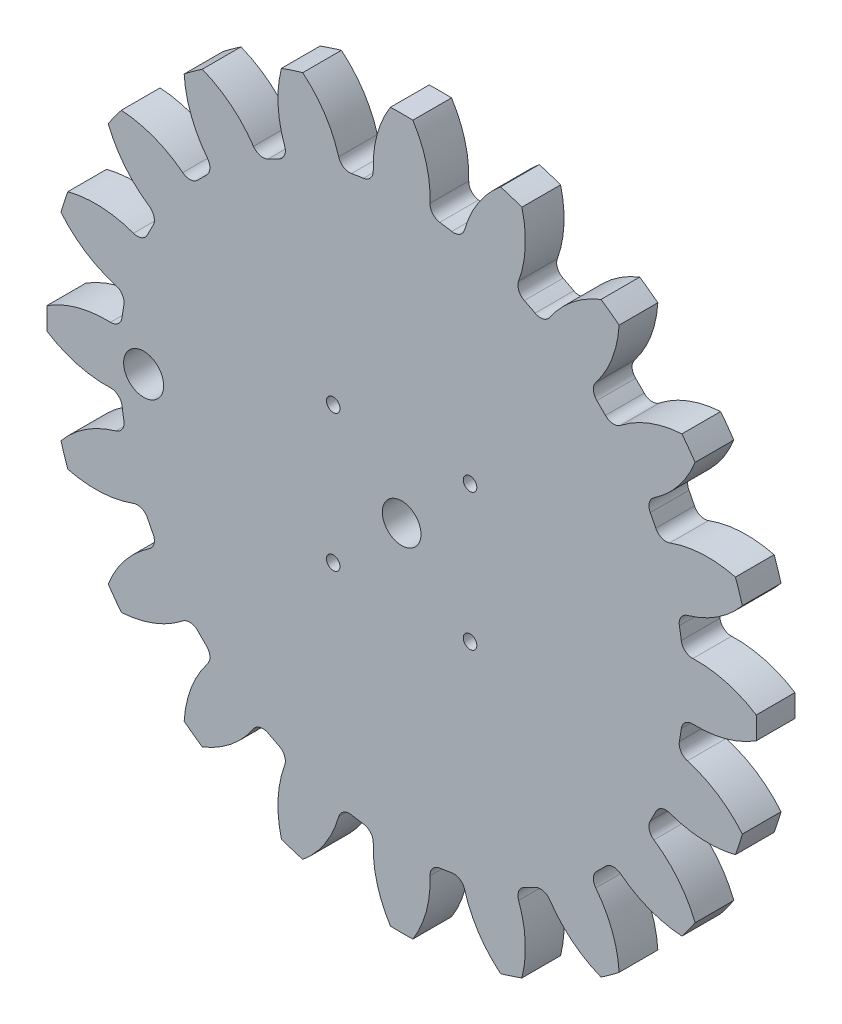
ISO-10303-21;
HEADER;
FILE_DESCRIPTION(('STEP AP214'),'2;1');
FILE_NAME('part.step','',(''),(''),'','','');
FILE_SCHEMA(('AUTOMOTIVE_DESIGN { 1 0 10303 214 1 1 1 1 }'));
ENDSEC;
DATA;
#1=APPLICATION_CONTEXT('core data for automotive mechanical design processes');
#2=APPLICATION_PROTOCOL_DEFINITION('international standard','automotive_design',2000,#1);
#3=PRODUCT_CONTEXT('',#1,'mechanical');
#4=PRODUCT('Part','Part','',(#3));
#5=PRODUCT_RELATED_PRODUCT_CATEGORY('part','',(#4));
#6=PRODUCT_DEFINITION_FORMATION('','',#4);
#7=PRODUCT_DEFINITION_CONTEXT('part definition',#1,'design');
#8=PRODUCT_DEFINITION('design','',#6,#7);
#9=PRODUCT_DEFINITION_SHAPE('','',#8);
#10=(LENGTH_UNIT() NAMED_UNIT(*) SI_UNIT(.MILLI.,.METRE.));
#11=(NAMED_UNIT(*) PLANE_ANGLE_UNIT() SI_UNIT($,.RADIAN.));
#12=(NAMED_UNIT(*) SI_UNIT($,.STERADIAN.) SOLID_ANGLE_UNIT());
#13=UNCERTAINTY_MEASURE_WITH_UNIT(LENGTH_MEASURE(1.E-05),#10,'distance_accuracy_value','');
#14=(GEOMETRIC_REPRESENTATION_CONTEXT(3) GLOBAL_UNCERTAINTY_ASSIGNED_CONTEXT((#13)) GLOBAL_UNIT_ASSIGNED_CONTEXT((#10,
#11,#12)) REPRESENTATION_CONTEXT('',''));
#15=CARTESIAN_POINT('',(0.,0.,0.));
#16=DIRECTION('',(0.,0.,1.));
#17=DIRECTION('',(1.,0.,0.));
#18=AXIS2_PLACEMENT_3D('',#15,#16,#17);
#19=CARTESIAN_POINT('',(0.,0.,6.));
#20=DIRECTION('',(0.,0.,-1.));
#21=DIRECTION('',(-1.,0.,0.));
#22=AXIS2_PLACEMENT_3D('',#19,#20,#21);
#23=CYLINDRICAL_SURFACE('',#22,43.75);
#24=CARTESIAN_POINT('',(0.,0.,6.));
#25=DIRECTION('',(0.,0.,1.));
#26=DIRECTION('',(1.,0.,0.));
#27=AXIS2_PLACEMENT_3D('',#24,#25,#26);
#28=CIRCLE('',#27,43.75);
#29=CARTESIAN_POINT('',(7.77047549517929,43.0544098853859,6.));
#30=VERTEX_POINT('',#29);
#31=CARTESIAN_POINT('',(5.91438298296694,43.3483860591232,6.));
#32=VERTEX_POINT('',#31);
#33=EDGE_CURVE('E1260',#30,#32,#28,.T.);
#34=ORIENTED_EDGE('',*,*,#33,.F.);
#35=DIRECTION('',(0.,0.,-1.));
#36=VECTOR('',#35,1.);
#37=CARTESIAN_POINT('',(7.77047549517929,43.0544098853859,6.));
#38=LINE('',#37,#36);
#39=CARTESIAN_POINT('',(7.77047549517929,43.0544098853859,0.));
#40=VERTEX_POINT('',#39);
#41=EDGE_CURVE('E1304',#30,#40,#38,.T.);
#42=ORIENTED_EDGE('',*,*,#41,.T.);
#43=CARTESIAN_POINT('',(0.,0.,0.));
#44=DIRECTION('',(0.,0.,1.));
#45=DIRECTION('',(1.,0.,0.));
#46=AXIS2_PLACEMENT_3D('',#43,#44,#45);
#47=CIRCLE('',#46,43.75);
#48=CARTESIAN_POINT('',(5.91438298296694,43.3483860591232,0.));
#49=VERTEX_POINT('',#48);
#50=EDGE_CURVE('E1248',#40,#49,#47,.T.);
#51=ORIENTED_EDGE('',*,*,#50,.T.);
#52=DIRECTION('',(0.,0.,-1.));
#53=VECTOR('',#52,1.);
#54=CARTESIAN_POINT('',(5.91438298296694,43.3483860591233,6.));
#55=LINE('',#54,#53);
#56=EDGE_CURVE('E1280',#49,#32,#55,.F.);
#57=ORIENTED_EDGE('',*,*,#56,.T.);
#58=EDGE_LOOP('',(#34,#42,#51,#57));
#59=FACE_BOUND('',#58,.T.);
#60=ADVANCED_FACE('F26',(#59),#23,.T.);
#61=CARTESIAN_POINT('',(-12.7321741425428,45.773478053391,6.));
#62=DIRECTION('',(0.,0.,-1.));
#63=DIRECTION('',(-1.,0.,0.));
#64=AXIS2_PLACEMENT_3D('',#61,#62,#63);
#65=CYLINDRICAL_SURFACE('',#64,17.1457769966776);
#66=CARTESIAN_POINT('',(-12.7321741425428,45.773478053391,6.));
#67=DIRECTION('',(0.,0.,-1.));
#68=DIRECTION('',(-1.,0.,0.));
#69=AXIS2_PLACEMENT_3D('',#66,#67,#68);
#70=CIRCLE('',#69,17.1457769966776);
#71=CARTESIAN_POINT('',(1.73691112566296,54.9725671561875,6.));
#72=VERTEX_POINT('',#71);
#73=CARTESIAN_POINT('',(4.40212935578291,45.1463317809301,6.));
#74=VERTEX_POINT('',#73);
#75=EDGE_CURVE('E1262',#72,#74,#70,.T.);
#76=ORIENTED_EDGE('',*,*,#75,.T.);
#77=DIRECTION('',(0.,0.,-1.));
#78=VECTOR('',#77,1.);
#79=CARTESIAN_POINT('',(4.40212935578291,45.1463317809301,6.));
#80=LINE('',#79,#78);
#81=CARTESIAN_POINT('',(4.40212935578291,45.1463317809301,0.));
#82=VERTEX_POINT('',#81);
#83=EDGE_CURVE('E1277',#74,#82,#80,.T.);
#84=ORIENTED_EDGE('',*,*,#83,.T.);
#85=CARTESIAN_POINT('',(-12.7321741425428,45.773478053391,0.));
#86=DIRECTION('',(0.,0.,-1.));
#87=DIRECTION('',(-1.,0.,0.));
#88=AXIS2_PLACEMENT_3D('',#85,#86,#87);
#89=CIRCLE('',#88,17.1457769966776);
#90=CARTESIAN_POINT('',(1.73691112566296,54.9725671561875,0.));
#91=VERTEX_POINT('',#90);
#92=EDGE_CURVE('E1250',#91,#82,#89,.T.);
#93=ORIENTED_EDGE('',*,*,#92,.F.);
#94=DIRECTION('',(0.,0.,-1.));
#95=VECTOR('',#94,1.);
#96=CARTESIAN_POINT('',(1.73691112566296,54.9725671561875,6.));
#97=LINE('',#96,#95);
#98=EDGE_CURVE('E1275',#72,#91,#97,.T.);
#99=ORIENTED_EDGE('',*,*,#98,.F.);
#100=EDGE_LOOP('',(#76,#84,#93,#99));
#101=FACE_BOUND('',#100,.T.);
#102=ADVANCED_FACE('F1697',(#101),#65,.T.);
#103=CARTESIAN_POINT('',(0.,0.,6.));
#104=DIRECTION('',(0.,0.,-1.));
#105=DIRECTION('',(-1.,0.,0.));
#106=AXIS2_PLACEMENT_3D('',#103,#104,#105);
#107=CYLINDRICAL_SURFACE('',#106,55.);
#108=CARTESIAN_POINT('',(0.,0.,0.));
#109=DIRECTION('',(0.,0.,1.));
#110=DIRECTION('',(1.,0.,0.));
#111=AXIS2_PLACEMENT_3D('',#108,#109,#110);
#112=CIRCLE('',#111,55.);
#113=CARTESIAN_POINT('',(-1.73691112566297,54.9725671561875,0.));
#114=VERTEX_POINT('',#113);
#115=EDGE_CURVE('E1253',#91,#114,#112,.T.);
#116=ORIENTED_EDGE('',*,*,#115,.T.);
#117=DIRECTION('',(0.,0.,-1.));
#118=VECTOR('',#117,1.);
#119=CARTESIAN_POINT('',(-1.73691112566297,54.9725671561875,6.));
#120=LINE('',#119,#118);
#121=CARTESIAN_POINT('',(-1.73691112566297,54.9725671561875,6.));
#122=VERTEX_POINT('',#121);
#123=EDGE_CURVE('E1272',#122,#114,#120,.T.);
#124=ORIENTED_EDGE('',*,*,#123,.F.);
#125=CARTESIAN_POINT('',(0.,0.,6.));
#126=DIRECTION('',(0.,0.,1.));
#127=DIRECTION('',(1.,0.,0.));
#128=AXIS2_PLACEMENT_3D('',#125,#126,#127);
#129=CIRCLE('',#128,55.);
#130=EDGE_CURVE('E1265',#72,#122,#129,.T.);
#131=ORIENTED_EDGE('',*,*,#130,.F.);
#132=ORIENTED_EDGE('',*,*,#98,.T.);
#133=EDGE_LOOP('',(#116,#124,#131,#132));
#134=FACE_BOUND('',#133,.T.);
#135=ADVANCED_FACE('F1693',(#134),#107,.T.);
#136=CARTESIAN_POINT('',(12.7321741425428,45.773478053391,6.));
#137=DIRECTION('',(0.,0.,-1.));
#138=DIRECTION('',(-1.,0.,0.));
#139=AXIS2_PLACEMENT_3D('',#136,#137,#138);
#140=CYLINDRICAL_SURFACE('',#139,17.1457769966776);
#141=CARTESIAN_POINT('',(12.7321741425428,45.773478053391,0.));
#142=DIRECTION('',(0.,0.,1.));
#143=DIRECTION('',(1.,0.,0.));
#144=AXIS2_PLACEMENT_3D('',#141,#142,#143);
#145=CIRCLE('',#144,17.1457769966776);
#146=CARTESIAN_POINT('',(-4.40212935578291,45.1463317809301,0.));
#147=VERTEX_POINT('',#146);
#148=EDGE_CURVE('E1255',#114,#147,#145,.T.);
#149=ORIENTED_EDGE('',*,*,#148,.T.);
#150=DIRECTION('',(0.,0.,-1.));
#151=VECTOR('',#150,1.);
#152=CARTESIAN_POINT('',(-4.40212935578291,45.1463317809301,6.));
#153=LINE('',#152,#151);
#154=CARTESIAN_POINT('',(-4.40212935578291,45.1463317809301,6.));
#155=VERTEX_POINT('',#154);
#156=EDGE_CURVE('E1286',#147,#155,#153,.F.);
#157=ORIENTED_EDGE('',*,*,#156,.T.);
#158=CARTESIAN_POINT('',(12.7321741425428,45.773478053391,6.));
#159=DIRECTION('',(0.,0.,1.));
#160=DIRECTION('',(1.,0.,0.));
#161=AXIS2_PLACEMENT_3D('',#158,#159,#160);
#162=CIRCLE('',#161,17.1457769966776);
#163=EDGE_CURVE('E1267',#122,#155,#162,.T.);
#164=ORIENTED_EDGE('',*,*,#163,.F.);
#165=ORIENTED_EDGE('',*,*,#123,.T.);
#166=EDGE_LOOP('',(#149,#157,#164,#165));
#167=FACE_BOUND('',#166,.T.);
#168=ADVANCED_FACE('F1688',(#167),#140,.T.);
#169=CARTESIAN_POINT('',(0.,0.,6.));
#170=DIRECTION('',(0.,0.,-1.));
#171=DIRECTION('',(-1.,0.,0.));
#172=AXIS2_PLACEMENT_3D('',#169,#170,#171);
#173=CYLINDRICAL_SURFACE('',#172,43.75);
#174=CARTESIAN_POINT('',(0.,0.,0.));
#175=DIRECTION('',(0.,0.,-1.));
#176=DIRECTION('',(-1.,0.,0.));
#177=AXIS2_PLACEMENT_3D('',#174,#175,#176);
#178=CIRCLE('',#177,43.75);
#179=CARTESIAN_POINT('',(-7.7704754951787,43.054409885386,0.));
#180=VERTEX_POINT('',#179);
#181=CARTESIAN_POINT('',(-5.91438298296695,43.3483860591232,0.));
#182=VERTEX_POINT('',#181);
#183=EDGE_CURVE('E1258',#180,#182,#178,.T.);
#184=ORIENTED_EDGE('',*,*,#183,.F.);
#185=DIRECTION('',(0.,0.,-1.));
#186=VECTOR('',#185,1.);
#187=CARTESIAN_POINT('',(-7.7704754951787,43.0544098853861,6.));
#188=LINE('',#187,#186);
#189=CARTESIAN_POINT('',(-7.7704754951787,43.054409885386,6.));
#190=VERTEX_POINT('',#189);
#191=EDGE_CURVE('E1659',#180,#190,#188,.F.);
#192=ORIENTED_EDGE('',*,*,#191,.T.);
#193=CARTESIAN_POINT('',(0.,0.,6.));
#194=DIRECTION('',(0.,0.,-1.));
#195=DIRECTION('',(-1.,0.,0.));
#196=AXIS2_PLACEMENT_3D('',#193,#194,#195);
#197=CIRCLE('',#196,43.75);
#198=CARTESIAN_POINT('',(-5.91438298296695,43.3483860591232,6.));
#199=VERTEX_POINT('',#198);
#200=EDGE_CURVE('E1270',#190,#199,#197,.T.);
#201=ORIENTED_EDGE('',*,*,#200,.T.);
#202=DIRECTION('',(0.,0.,-1.));
#203=VECTOR('',#202,1.);
#204=CARTESIAN_POINT('',(-5.91438298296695,43.3483860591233,6.));
#205=LINE('',#204,#203);
#206=EDGE_CURVE('E1283',#199,#182,#205,.T.);
#207=ORIENTED_EDGE('',*,*,#206,.T.);
#208=EDGE_LOOP('',(#184,#192,#201,#207));
#209=FACE_BOUND('',#208,.T.);
#210=ADVANCED_FACE('F1679',(#209),#173,.T.);
#211=CARTESIAN_POINT('',(0.,0.,6.));
#212=DIRECTION('',(0.,0.,1.));
#213=DIRECTION('',(1.,0.,0.));
#214=AXIS2_PLACEMENT_3D('',#211,#212,#213);
#215=PLANE('',#214);
#216=CARTESIAN_POINT('',(-40.,0.,6.));
#217=DIRECTION('',(0.,0.,1.));
#218=DIRECTION('',(1.,0.,0.));
#219=AXIS2_PLACEMENT_3D('',#216,#217,#218);
#220=CIRCLE('',#219,3.1);
#221=CARTESIAN_POINT('',(-36.9,0.,6.));
#222=VERTEX_POINT('',#221);
#223=EDGE_CURVE('E2663',#222,#222,#220,.T.);
#224=ORIENTED_EDGE('',*,*,#223,.F.);
#225=EDGE_LOOP('',(#224));
#226=FACE_BOUND('',#225,.T.);
#227=CARTESIAN_POINT('',(10.6066017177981,10.6066017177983,6.));
#228=DIRECTION('',(0.,0.,1.));
#229=DIRECTION('',(-1.,0.,0.));
#230=AXIS2_PLACEMENT_3D('',#227,#228,#229);
#231=CIRCLE('',#230,1.05);
#232=CARTESIAN_POINT('',(9.55660171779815,10.6066017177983,6.));
#233=VERTEX_POINT('',#232);
#234=EDGE_CURVE('E2665',#233,#233,#231,.T.);
#235=ORIENTED_EDGE('',*,*,#234,.F.);
#236=EDGE_LOOP('',(#235));
#237=FACE_BOUND('',#236,.T.);
#238=CARTESIAN_POINT('',(-10.6066017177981,-10.6066017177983,6.));
#239=DIRECTION('',(0.,0.,1.));
#240=DIRECTION('',(1.,0.,0.));
#241=AXIS2_PLACEMENT_3D('',#238,#239,#240);
#242=CIRCLE('',#241,1.05);
#243=CARTESIAN_POINT('',(-9.55660171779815,-10.6066017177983,6.));
#244=VERTEX_POINT('',#243);
#245=EDGE_CURVE('E2673',#244,#244,#242,.T.);
#246=ORIENTED_EDGE('',*,*,#245,.F.);
#247=EDGE_LOOP('',(#246));
#248=FACE_BOUND('',#247,.T.);
#249=CARTESIAN_POINT('',(10.6066017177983,-10.6066017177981,6.));
#250=DIRECTION('',(0.,0.,1.));
#251=DIRECTION('',(1.,0.,0.));
#252=AXIS2_PLACEMENT_3D('',#249,#250,#251);
#253=CIRCLE('',#252,1.05);
#254=CARTESIAN_POINT('',(11.6566017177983,-10.6066017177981,6.));
#255=VERTEX_POINT('',#254);
#256=EDGE_CURVE('E2679',#255,#255,#253,.T.);
#257=ORIENTED_EDGE('',*,*,#256,.F.);
#258=EDGE_LOOP('',(#257));
#259=FACE_BOUND('',#258,.T.);
#260=CARTESIAN_POINT('',(-10.6066017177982,10.6066017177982,6.));
#261=DIRECTION('',(0.,0.,1.));
#262=DIRECTION('',(1.,0.,0.));
#263=AXIS2_PLACEMENT_3D('',#260,#261,#262);
#264=CIRCLE('',#263,1.05);
#265=CARTESIAN_POINT('',(-9.55660171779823,10.6066017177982,6.));
#266=VERTEX_POINT('',#265);
#267=EDGE_CURVE('E2685',#266,#266,#264,.T.);
#268=ORIENTED_EDGE('',*,*,#267,.F.);
#269=EDGE_LOOP('',(#268));
#270=FACE_BOUND('',#269,.T.);
#271=CARTESIAN_POINT('',(0.,0.,6.));
#272=DIRECTION('',(0.,0.,1.));
#273=DIRECTION('',(1.,0.,0.));
#274=AXIS2_PLACEMENT_3D('',#271,#272,#273);
#275=CIRCLE('',#274,3.);
#276=CARTESIAN_POINT('',(3.,0.,6.));
#277=VERTEX_POINT('',#276);
#278=EDGE_CURVE('E788',#277,#277,#275,.T.);
#279=ORIENTED_EDGE('',*,*,#278,.F.);
#280=EDGE_LOOP('',(#279));
#281=FACE_BOUND('',#280,.T.);
#282=CARTESIAN_POINT('',(26.2537997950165,39.5987063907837,6.));
#283=DIRECTION('',(0.,0.,1.));
#284=DIRECTION('',(0.951056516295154,-0.309016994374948,0.));
#285=AXIS2_PLACEMENT_3D('',#282,#283,#284);
#286=CIRCLE('',#285,17.1457769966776);
#287=CARTESIAN_POINT('',(15.3355568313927,52.8187532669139,6.));
#288=VERTEX_POINT('',#287);
#289=CARTESIAN_POINT('',(9.7643099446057,44.2970458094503,6.));
#290=VERTEX_POINT('',#289);
#291=EDGE_CURVE('E1240',#288,#290,#286,.T.);
#292=ORIENTED_EDGE('',*,*,#291,.T.);
#293=CARTESIAN_POINT('',(8.08129451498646,44.7765862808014,6.));
#294=DIRECTION('',(0.,0.,1.));
#295=DIRECTION('',(1.,0.,0.));
#296=AXIS2_PLACEMENT_3D('',#293,#294,#295);
#297=CIRCLE('',#296,1.75);
#298=EDGE_CURVE('E1316',#290,#30,#297,.F.);
#299=ORIENTED_EDGE('',*,*,#298,.T.);
#300=ORIENTED_EDGE('',*,*,#33,.T.);
#301=CARTESIAN_POINT('',(6.15095830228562,45.0823215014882,6.));
#302=DIRECTION('',(0.,0.,1.));
#303=DIRECTION('',(1.,0.,0.));
#304=AXIS2_PLACEMENT_3D('',#301,#302,#303);
#305=CIRCLE('',#304,1.75);
#306=EDGE_CURVE('E1291',#32,#74,#305,.F.);
#307=ORIENTED_EDGE('',*,*,#306,.T.);
#308=ORIENTED_EDGE('',*,*,#75,.F.);
#309=ORIENTED_EDGE('',*,*,#130,.T.);
#310=ORIENTED_EDGE('',*,*,#163,.T.);
#311=CARTESIAN_POINT('',(-6.15095830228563,45.0823215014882,6.));
#312=DIRECTION('',(0.,0.,1.));
#313=DIRECTION('',(1.,0.,0.));
#314=AXIS2_PLACEMENT_3D('',#311,#312,#313);
#315=CIRCLE('',#314,1.75);
#316=EDGE_CURVE('E1295',#155,#199,#315,.F.);
#317=ORIENTED_EDGE('',*,*,#316,.T.);
#318=ORIENTED_EDGE('',*,*,#200,.F.);
#319=CARTESIAN_POINT('',(-8.08129451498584,44.7765862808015,6.));
#320=DIRECTION('',(0.,0.,1.));
#321=DIRECTION('',(1.,0.,0.));
#322=AXIS2_PLACEMENT_3D('',#319,#320,#321);
#323=CIRCLE('',#322,1.75);
#324=CARTESIAN_POINT('',(-9.76430994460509,44.2970458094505,6.));
#325=VERTEX_POINT('',#324);
#326=EDGE_CURVE('E1667',#190,#325,#323,.F.);
#327=ORIENTED_EDGE('',*,*,#326,.T.);
#328=CARTESIAN_POINT('',(-26.253799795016,39.5987063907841,6.));
#329=DIRECTION('',(0.,0.,-1.));
#330=DIRECTION('',(-0.951056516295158,-0.309016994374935,0.));
#331=AXIS2_PLACEMENT_3D('',#328,#329,#330);
#332=CIRCLE('',#331,17.1457769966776);
#333=CARTESIAN_POINT('',(-15.335556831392,52.8187532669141,6.));
#334=VERTEX_POINT('',#333);
#335=EDGE_CURVE('E793',#334,#325,#332,.T.);
#336=ORIENTED_EDGE('',*,*,#335,.F.);
#337=CARTESIAN_POINT('',(0.,0.,6.));
#338=DIRECTION('',(0.,0.,1.));
#339=DIRECTION('',(0.951056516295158,0.309016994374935,0.));
#340=AXIS2_PLACEMENT_3D('',#337,#338,#339);
#341=CIRCLE('',#340,55.);
#342=CARTESIAN_POINT('',(-18.6393581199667,51.7452831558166,6.));
#343=VERTEX_POINT('',#342);
#344=EDGE_CURVE('E768',#334,#343,#341,.T.);
#345=ORIENTED_EDGE('',*,*,#344,.T.);
#346=CARTESIAN_POINT('',(-2.03576542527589,47.4676227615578,6.));
#347=DIRECTION('',(0.,0.,1.));
#348=DIRECTION('',(0.951056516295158,0.309016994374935,0.));
#349=AXIS2_PLACEMENT_3D('',#346,#347,#348);
#350=CIRCLE('',#349,17.1457769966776);
#351=CARTESIAN_POINT('',(-18.1376575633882,41.5763802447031,6.));
#352=VERTEX_POINT('',#351);
#353=EDGE_CURVE('E796',#343,#352,#350,.T.);
#354=ORIENTED_EDGE('',*,*,#353,.T.);
#355=CARTESIAN_POINT('',(-19.7811124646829,40.9750849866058,6.));
#356=DIRECTION('',(0.,0.,1.));
#357=DIRECTION('',(1.,0.,0.));
#358=AXIS2_PLACEMENT_3D('',#355,#356,#357);
#359=CIRCLE('',#358,1.75);
#360=CARTESIAN_POINT('',(-19.0203004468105,39.3991201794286,6.));
#361=VERTEX_POINT('',#360);
#362=EDGE_CURVE('E11',#352,#361,#359,.F.);
#363=ORIENTED_EDGE('',*,*,#362,.T.);
#364=CARTESIAN_POINT('',(0.,0.,6.));
#365=DIRECTION('',(0.,0.,1.));
#366=DIRECTION('',(0.809016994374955,0.587785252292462,0.));
#367=AXIS2_PLACEMENT_3D('',#364,#365,#366);
#368=CIRCLE('',#367,43.75);
#369=CARTESIAN_POINT('',(-20.6947056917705,38.5459680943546,6.));
#370=VERTEX_POINT('',#369);
#371=EDGE_CURVE('E808',#361,#370,#368,.T.);
#372=ORIENTED_EDGE('',*,*,#371,.T.);
#373=CARTESIAN_POINT('',(-21.5224939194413,40.0878068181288,6.));
#374=DIRECTION('',(0.,0.,1.));
#375=DIRECTION('',(1.,0.,0.));
#376=AXIS2_PLACEMENT_3D('',#373,#374,#375);
#377=CIRCLE('',#376,1.75);
#378=CARTESIAN_POINT('',(-22.974950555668,39.1116563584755,6.));
#379=VERTEX_POINT('',#378);
#380=EDGE_CURVE('E1652',#370,#379,#377,.F.);
#381=ORIENTED_EDGE('',*,*,#380,.T.);
#382=CARTESIAN_POINT('',(-37.2055206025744,29.5477374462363,6.));
#383=DIRECTION('',(0.,0.,-1.));
#384=DIRECTION('',(-0.809016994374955,-0.587785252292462,0.));
#385=AXIS2_PLACEMENT_3D('',#382,#383,#384);
#386=CIRCLE('',#385,17.1457769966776);
#387=CARTESIAN_POINT('',(-30.9068736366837,45.4946717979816,6.));
#388=VERTEX_POINT('',#387);
#389=EDGE_CURVE('E810',#388,#379,#386,.T.);
#390=ORIENTED_EDGE('',*,*,#389,.F.);
#391=CARTESIAN_POINT('',(0.,0.,6.));
#392=DIRECTION('',(0.,0.,1.));
#393=DIRECTION('',(0.809016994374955,0.587785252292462,0.));
#394=AXIS2_PLACEMENT_3D('',#391,#392,#393);
#395=CIRCLE('',#394,55.);
#396=CARTESIAN_POINT('',(-33.7172548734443,43.4528103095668,6.));
#397=VERTEX_POINT('',#396);
#398=EDGE_CURVE('E813',#388,#397,#395,.T.);
#399=ORIENTED_EDGE('',*,*,#398,.T.);
#400=CARTESIAN_POINT('',(-16.6044300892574,44.5153058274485,6.));
#401=DIRECTION('',(0.,0.,1.));
#402=DIRECTION('',(0.809016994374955,0.587785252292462,0.));
#403=AXIS2_PLACEMENT_3D('',#400,#401,#402);
#404=CIRCLE('',#403,17.1457769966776);
#405=CARTESIAN_POINT('',(-30.0977454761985,33.9366429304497,6.));
#406=VERTEX_POINT('',#405);
#407=EDGE_CURVE('E815',#397,#406,#404,.T.);
#408=ORIENTED_EDGE('',*,*,#407,.T.);
#409=CARTESIAN_POINT('',(-31.4749535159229,32.85692166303,6.));
#410=DIRECTION('',(0.,0.,1.));
#411=DIRECTION('',(1.,0.,0.));
#412=AXIS2_PLACEMENT_3D('',#409,#410,#411);
#413=CIRCLE('',#412,1.75);
#414=CARTESIAN_POINT('',(-30.2643783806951,31.5931939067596,6.));
#415=VERTEX_POINT('',#414);
#416=EDGE_CURVE('E1656',#406,#415,#413,.F.);
#417=ORIENTED_EDGE('',*,*,#416,.T.);
#418=CARTESIAN_POINT('',(0.,0.,6.));
#419=DIRECTION('',(0.,0.,1.));
#420=DIRECTION('',(0.587785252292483,0.80901699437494,0.));
#421=AXIS2_PLACEMENT_3D('',#418,#419,#420);
#422=CIRCLE('',#421,43.75);
#423=CARTESIAN_POINT('',(-31.5931939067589,30.2643783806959,6.));
#424=VERTEX_POINT('',#423);
#425=EDGE_CURVE('E833',#415,#424,#422,.T.);
#426=ORIENTED_EDGE('',*,*,#425,.T.);
#427=CARTESIAN_POINT('',(-32.8569216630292,31.4749535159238,6.));
#428=DIRECTION('',(0.,0.,1.));
#429=DIRECTION('',(1.,0.,0.));
#430=AXIS2_PLACEMENT_3D('',#427,#428,#429);
#431=CIRCLE('',#430,1.75);
#432=CARTESIAN_POINT('',(-33.9366429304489,30.0977454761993,6.));
#433=VERTEX_POINT('',#432);
#434=EDGE_CURVE('E1632',#424,#433,#431,.F.);
#435=ORIENTED_EDGE('',*,*,#434,.T.);
#436=CARTESIAN_POINT('',(-44.5153058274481,16.6044300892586,6.));
#437=DIRECTION('',(0.,0.,-1.));
#438=DIRECTION('',(-0.587785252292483,-0.80901699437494,0.));
#439=AXIS2_PLACEMENT_3D('',#436,#437,#438);
#440=CIRCLE('',#439,17.1457769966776);
#441=CARTESIAN_POINT('',(-43.452810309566,33.7172548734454,6.));
#442=VERTEX_POINT('',#441);
#443=EDGE_CURVE('E835',#442,#433,#440,.T.);
#444=ORIENTED_EDGE('',*,*,#443,.F.);
#445=CARTESIAN_POINT('',(0.,0.,6.));
#446=DIRECTION('',(0.,0.,1.));
#447=DIRECTION('',(0.587785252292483,0.80901699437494,0.));
#448=AXIS2_PLACEMENT_3D('',#445,#446,#447);
#449=CIRCLE('',#448,55.);
#450=CARTESIAN_POINT('',(-45.4946717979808,30.9068736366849,6.));
#451=VERTEX_POINT('',#450);
#452=EDGE_CURVE('E838',#442,#451,#449,.T.);
#453=ORIENTED_EDGE('',*,*,#452,.T.);
#454=CARTESIAN_POINT('',(-29.5477374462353,37.2055206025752,6.));
#455=DIRECTION('',(0.,0.,1.));
#456=DIRECTION('',(0.587785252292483,0.80901699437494,0.));
#457=AXIS2_PLACEMENT_3D('',#454,#455,#456);
#458=CIRCLE('',#457,17.1457769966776);
#459=CARTESIAN_POINT('',(-39.1116563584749,22.974950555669,6.));
#460=VERTEX_POINT('',#459);
#461=EDGE_CURVE('E840',#451,#460,#458,.T.);
#462=ORIENTED_EDGE('',*,*,#461,.T.);
#463=CARTESIAN_POINT('',(-40.0878068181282,21.5224939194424,6.));
#464=DIRECTION('',(0.,0.,1.));
#465=DIRECTION('',(1.,0.,0.));
#466=AXIS2_PLACEMENT_3D('',#463,#464,#465);
#467=CIRCLE('',#466,1.75);
#468=CARTESIAN_POINT('',(-38.545968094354,20.6947056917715,6.));
#469=VERTEX_POINT('',#468);
#470=EDGE_CURVE('E1636',#460,#469,#467,.F.);
#471=ORIENTED_EDGE('',*,*,#470,.T.);
#472=CARTESIAN_POINT('',(0.,0.,6.));
#473=DIRECTION('',(0.,0.,1.));
#474=DIRECTION('',(0.309016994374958,0.95105651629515,0.));
#475=AXIS2_PLACEMENT_3D('',#472,#473,#474);
#476=CIRCLE('',#475,43.75);
#477=CARTESIAN_POINT('',(-39.3991201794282,19.0203004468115,6.));
#478=VERTEX_POINT('',#477);
#479=EDGE_CURVE('E858',#469,#478,#476,.T.);
#480=ORIENTED_EDGE('',*,*,#479,.T.);
#481=CARTESIAN_POINT('',(-40.9750849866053,19.7811124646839,6.));
#482=DIRECTION('',(0.,0.,1.));
#483=DIRECTION('',(1.,0.,0.));
#484=AXIS2_PLACEMENT_3D('',#481,#482,#483);
#485=CIRCLE('',#484,1.75);
#486=CARTESIAN_POINT('',(-41.5763802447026,18.1376575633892,6.));
#487=VERTEX_POINT('',#486);
#488=EDGE_CURVE('E1612',#478,#487,#485,.F.);
#489=ORIENTED_EDGE('',*,*,#488,.T.);
#490=CARTESIAN_POINT('',(-47.4676227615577,2.03576542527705,6.));
#491=DIRECTION('',(0.,0.,-1.));
#492=DIRECTION('',(-0.309016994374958,-0.95105651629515,0.));
#493=AXIS2_PLACEMENT_3D('',#490,#491,#492);
#494=CIRCLE('',#493,17.1457769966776);
#495=CARTESIAN_POINT('',(-51.7452831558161,18.6393581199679,6.));
#496=VERTEX_POINT('',#495);
#497=EDGE_CURVE('E860',#496,#487,#494,.T.);
#498=ORIENTED_EDGE('',*,*,#497,.F.);
#499=CARTESIAN_POINT('',(0.,0.,6.));
#500=DIRECTION('',(0.,0.,1.));
#501=DIRECTION('',(0.309016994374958,0.95105651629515,0.));
#502=AXIS2_PLACEMENT_3D('',#499,#500,#501);
#503=CIRCLE('',#502,55.);
#504=CARTESIAN_POINT('',(-52.8187532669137,15.3355568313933,6.));
#505=VERTEX_POINT('',#504);
#506=EDGE_CURVE('E863',#496,#505,#503,.T.);
#507=ORIENTED_EDGE('',*,*,#506,.T.);
#508=CARTESIAN_POINT('',(-39.5987063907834,26.253799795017,6.));
#509=DIRECTION('',(0.,0.,1.));
#510=DIRECTION('',(0.309016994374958,0.95105651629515,0.));
#511=AXIS2_PLACEMENT_3D('',#508,#509,#510);
#512=CIRCLE('',#511,17.1457769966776);
#513=CARTESIAN_POINT('',(-44.2970458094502,9.76430994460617,6.));
#514=VERTEX_POINT('',#513);
#515=EDGE_CURVE('E865',#505,#514,#512,.T.);
#516=ORIENTED_EDGE('',*,*,#515,.T.);
#517=CARTESIAN_POINT('',(-44.7765862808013,8.08129451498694,6.));
#518=DIRECTION('',(0.,0.,1.));
#519=DIRECTION('',(1.,0.,0.));
#520=AXIS2_PLACEMENT_3D('',#517,#518,#519);
#521=CIRCLE('',#520,1.75);
#522=CARTESIAN_POINT('',(-43.0544098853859,7.77047549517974,6.));
#523=VERTEX_POINT('',#522);
#524=EDGE_CURVE('E1616',#514,#523,#521,.F.);
#525=ORIENTED_EDGE('',*,*,#524,.T.);
#526=CARTESIAN_POINT('',(0.,0.,6.));
#527=DIRECTION('',(0.,0.,1.));
#528=DIRECTION('',(0.,1.,0.));
#529=AXIS2_PLACEMENT_3D('',#526,#527,#528);
#530=CIRCLE('',#529,43.75);
#531=CARTESIAN_POINT('',(-43.3483860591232,5.9143829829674,6.));
#532=VERTEX_POINT('',#531);
#533=EDGE_CURVE('E883',#523,#532,#530,.T.);
#534=ORIENTED_EDGE('',*,*,#533,.T.);
#535=CARTESIAN_POINT('',(-45.0823215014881,6.15095830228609,6.));
#536=DIRECTION('',(0.,0.,1.));
#537=DIRECTION('',(1.,0.,0.));
#538=AXIS2_PLACEMENT_3D('',#535,#536,#537);
#539=CIRCLE('',#538,1.75);
#540=CARTESIAN_POINT('',(-45.1463317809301,4.40212935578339,6.));
#541=VERTEX_POINT('',#540);
#542=EDGE_CURVE('E1592',#532,#541,#539,.F.);
#543=ORIENTED_EDGE('',*,*,#542,.T.);
#544=CARTESIAN_POINT('',(-45.7734780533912,-12.7321741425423,6.));
#545=DIRECTION('',(0.,0.,-1.));
#546=DIRECTION('',(0.,-1.,0.));
#547=AXIS2_PLACEMENT_3D('',#544,#545,#546);
#548=CIRCLE('',#547,17.1457769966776);
#549=CARTESIAN_POINT('',(-54.9725671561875,1.73691112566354,6.));
#550=VERTEX_POINT('',#549);
#551=EDGE_CURVE('E885',#550,#541,#548,.T.);
#552=ORIENTED_EDGE('',*,*,#551,.F.);
#553=CARTESIAN_POINT('',(0.,0.,6.));
#554=DIRECTION('',(0.,0.,1.));
#555=DIRECTION('',(0.,1.,0.));
#556=AXIS2_PLACEMENT_3D('',#553,#554,#555);
#557=CIRCLE('',#556,55.);
#558=CARTESIAN_POINT('',(-54.9725671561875,-1.73691112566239,6.));
#559=VERTEX_POINT('',#558);
#560=EDGE_CURVE('E888',#550,#559,#557,.T.);
#561=ORIENTED_EDGE('',*,*,#560,.T.);
#562=CARTESIAN_POINT('',(-45.7734780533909,12.7321741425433,6.));
#563=DIRECTION('',(0.,0.,1.));
#564=DIRECTION('',(0.,1.,0.));
#565=AXIS2_PLACEMENT_3D('',#562,#563,#564);
#566=CIRCLE('',#565,17.1457769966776);
#567=CARTESIAN_POINT('',(-45.1463317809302,-4.40212935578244,6.));
#568=VERTEX_POINT('',#567);
#569=EDGE_CURVE('E890',#559,#568,#566,.T.);
#570=ORIENTED_EDGE('',*,*,#569,.T.);
#571=CARTESIAN_POINT('',(-45.0823215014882,-6.15095830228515,6.));
#572=DIRECTION('',(0.,0.,1.));
#573=DIRECTION('',(1.,0.,0.));
#574=AXIS2_PLACEMENT_3D('',#571,#572,#573);
#575=CIRCLE('',#574,1.75);
#576=CARTESIAN_POINT('',(-43.3483860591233,-5.91438298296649,6.));
#577=VERTEX_POINT('',#576);
#578=EDGE_CURVE('E1596',#568,#577,#575,.F.);
#579=ORIENTED_EDGE('',*,*,#578,.T.);
#580=CARTESIAN_POINT('',(0.,0.,6.));
#581=DIRECTION('',(0.,0.,1.));
#582=DIRECTION('',(-0.309016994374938,0.951056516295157,0.));
#583=AXIS2_PLACEMENT_3D('',#580,#581,#582);
#584=CIRCLE('',#583,43.75);
#585=CARTESIAN_POINT('',(-43.054409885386,-7.77047549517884,6.));
#586=VERTEX_POINT('',#585);
#587=EDGE_CURVE('E908',#577,#586,#584,.T.);
#588=ORIENTED_EDGE('',*,*,#587,.T.);
#589=CARTESIAN_POINT('',(-44.7765862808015,-8.081294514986,6.));
#590=DIRECTION('',(0.,0.,1.));
#591=DIRECTION('',(1.,0.,0.));
#592=AXIS2_PLACEMENT_3D('',#589,#590,#591);
#593=CIRCLE('',#592,1.75);
#594=CARTESIAN_POINT('',(-44.2970458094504,-9.76430994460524,6.));
#595=VERTEX_POINT('',#594);
#596=EDGE_CURVE('E1572',#586,#595,#593,.F.);
#597=ORIENTED_EDGE('',*,*,#596,.T.);
#598=CARTESIAN_POINT('',(-39.598706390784,-26.2537997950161,6.));
#599=DIRECTION('',(0.,0.,-1.));
#600=DIRECTION('',(0.309016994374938,-0.951056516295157,0.));
#601=AXIS2_PLACEMENT_3D('',#598,#599,#600);
#602=CIRCLE('',#601,17.1457769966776);
#603=CARTESIAN_POINT('',(-52.818753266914,-15.3355568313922,6.));
#604=VERTEX_POINT('',#603);
#605=EDGE_CURVE('E910',#604,#595,#602,.T.);
#606=ORIENTED_EDGE('',*,*,#605,.F.);
#607=CARTESIAN_POINT('',(0.,0.,6.));
#608=DIRECTION('',(0.,0.,1.));
#609=DIRECTION('',(-0.309016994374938,0.951056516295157,0.));
#610=AXIS2_PLACEMENT_3D('',#607,#608,#609);
#611=CIRCLE('',#610,55.);
#612=CARTESIAN_POINT('',(-51.7452831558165,-18.6393581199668,6.));
#613=VERTEX_POINT('',#612);
#614=EDGE_CURVE('E913',#604,#613,#611,.T.);
#615=ORIENTED_EDGE('',*,*,#614,.T.);
#616=CARTESIAN_POINT('',(-47.4676227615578,-2.03576542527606,6.));
#617=DIRECTION('',(0.,0.,1.));
#618=DIRECTION('',(-0.309016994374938,0.951056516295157,0.));
#619=AXIS2_PLACEMENT_3D('',#616,#617,#618);
#620=CIRCLE('',#619,17.1457769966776);
#621=CARTESIAN_POINT('',(-41.576380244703,-18.1376575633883,6.));
#622=VERTEX_POINT('',#621);
#623=EDGE_CURVE('E915',#613,#622,#620,.T.);
#624=ORIENTED_EDGE('',*,*,#623,.T.);
#625=CARTESIAN_POINT('',(-40.9750849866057,-19.7811124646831,6.));
#626=DIRECTION('',(0.,0.,1.));
#627=DIRECTION('',(1.,0.,0.));
#628=AXIS2_PLACEMENT_3D('',#625,#626,#627);
#629=CIRCLE('',#628,1.75);
#630=CARTESIAN_POINT('',(-39.3991201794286,-19.0203004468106,6.));
#631=VERTEX_POINT('',#630);
#632=EDGE_CURVE('E1576',#622,#631,#629,.F.);
#633=ORIENTED_EDGE('',*,*,#632,.T.);
#634=CARTESIAN_POINT('',(0.,0.,6.));
#635=DIRECTION('',(0.,0.,1.));
#636=DIRECTION('',(-0.587785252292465,0.809016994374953,0.));
#637=AXIS2_PLACEMENT_3D('',#634,#635,#636);
#638=CIRCLE('',#637,43.75);
#639=CARTESIAN_POINT('',(-38.5459680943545,-20.6947056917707,6.));
#640=VERTEX_POINT('',#639);
#641=EDGE_CURVE('E933',#631,#640,#638,.T.);
#642=ORIENTED_EDGE('',*,*,#641,.T.);
#643=CARTESIAN_POINT('',(-40.0878068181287,-21.5224939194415,6.));
#644=DIRECTION('',(0.,0.,1.));
#645=DIRECTION('',(1.,0.,0.));
#646=AXIS2_PLACEMENT_3D('',#643,#644,#645);
#647=CIRCLE('',#646,1.75);
#648=CARTESIAN_POINT('',(-39.1116563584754,-22.9749505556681,6.));
#649=VERTEX_POINT('',#648);
#650=EDGE_CURVE('E1552',#640,#649,#647,.F.);
#651=ORIENTED_EDGE('',*,*,#650,.T.);
#652=CARTESIAN_POINT('',(-29.5477374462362,-37.2055206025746,6.));
#653=DIRECTION('',(0.,0.,-1.));
#654=DIRECTION('',(0.587785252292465,-0.809016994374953,0.));
#655=AXIS2_PLACEMENT_3D('',#652,#653,#654);
#656=CIRCLE('',#655,17.1457769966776);
#657=CARTESIAN_POINT('',(-45.4946717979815,-30.9068736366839,6.));
#658=VERTEX_POINT('',#657);
#659=EDGE_CURVE('E935',#658,#649,#656,.T.);
#660=ORIENTED_EDGE('',*,*,#659,.F.);
#661=CARTESIAN_POINT('',(0.,0.,6.));
#662=DIRECTION('',(0.,0.,1.));
#663=DIRECTION('',(-0.587785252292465,0.809016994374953,0.));
#664=AXIS2_PLACEMENT_3D('',#661,#662,#663);
#665=CIRCLE('',#664,55.);
#666=CARTESIAN_POINT('',(-43.4528103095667,-33.7172548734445,6.));
#667=VERTEX_POINT('',#666);
#668=EDGE_CURVE('E938',#658,#667,#665,.T.);
#669=ORIENTED_EDGE('',*,*,#668,.T.);
#670=CARTESIAN_POINT('',(-44.5153058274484,-16.6044300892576,6.));
#671=DIRECTION('',(0.,0.,1.));
#672=DIRECTION('',(-0.587785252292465,0.809016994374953,0.));
#673=AXIS2_PLACEMENT_3D('',#670,#671,#672);
#674=CIRCLE('',#673,17.1457769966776);
#675=CARTESIAN_POINT('',(-33.9366429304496,-30.0977454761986,6.));
#676=VERTEX_POINT('',#675);
#677=EDGE_CURVE('E940',#667,#676,#674,.T.);
#678=ORIENTED_EDGE('',*,*,#677,.T.);
#679=CARTESIAN_POINT('',(-32.8569216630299,-31.474953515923,6.));
#680=DIRECTION('',(0.,0.,1.));
#681=DIRECTION('',(1.,0.,0.));
#682=AXIS2_PLACEMENT_3D('',#679,#680,#681);
#683=CIRCLE('',#682,1.75);
#684=CARTESIAN_POINT('',(-31.5931939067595,-30.2643783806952,6.));
#685=VERTEX_POINT('',#684);
#686=EDGE_CURVE('E1556',#676,#685,#683,.F.);
#687=ORIENTED_EDGE('',*,*,#686,.T.);
#688=CARTESIAN_POINT('',(0.,0.,6.));
#689=DIRECTION('',(0.,0.,1.));
#690=DIRECTION('',(-0.809016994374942,0.58778525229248,0.));
#691=AXIS2_PLACEMENT_3D('',#688,#689,#690);
#692=CIRCLE('',#691,43.75);
#693=CARTESIAN_POINT('',(-30.2643783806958,-31.593193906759,6.));
#694=VERTEX_POINT('',#693);
#695=EDGE_CURVE('E958',#685,#694,#692,.T.);
#696=ORIENTED_EDGE('',*,*,#695,.T.);
#697=CARTESIAN_POINT('',(-31.4749535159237,-32.8569216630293,6.));
#698=DIRECTION('',(0.,0.,1.));
#699=DIRECTION('',(1.,0.,0.));
#700=AXIS2_PLACEMENT_3D('',#697,#698,#699);
#701=CIRCLE('',#700,1.75);
#702=CARTESIAN_POINT('',(-30.0977454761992,-33.936642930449,6.));
#703=VERTEX_POINT('',#702);
#704=EDGE_CURVE('E1532',#694,#703,#701,.F.);
#705=ORIENTED_EDGE('',*,*,#704,.T.);
#706=CARTESIAN_POINT('',(-16.6044300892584,-44.5153058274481,6.));
#707=DIRECTION('',(0.,0.,-1.));
#708=DIRECTION('',(0.809016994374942,-0.58778525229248,0.));
#709=AXIS2_PLACEMENT_3D('',#706,#707,#708);
#710=CIRCLE('',#709,17.1457769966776);
#711=CARTESIAN_POINT('',(-33.7172548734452,-43.4528103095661,6.));
#712=VERTEX_POINT('',#711);
#713=EDGE_CURVE('E960',#712,#703,#710,.T.);
#714=ORIENTED_EDGE('',*,*,#713,.F.);
#715=CARTESIAN_POINT('',(0.,0.,6.));
#716=DIRECTION('',(0.,0.,1.));
#717=DIRECTION('',(-0.809016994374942,0.58778525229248,0.));
#718=AXIS2_PLACEMENT_3D('',#715,#716,#717);
#719=CIRCLE('',#718,55.);
#720=CARTESIAN_POINT('',(-30.9068736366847,-45.4946717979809,6.));
#721=VERTEX_POINT('',#720);
#722=EDGE_CURVE('E963',#712,#721,#719,.T.);
#723=ORIENTED_EDGE('',*,*,#722,.T.);
#724=CARTESIAN_POINT('',(-37.2055206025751,-29.5477374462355,6.));
#725=DIRECTION('',(0.,0.,1.));
#726=DIRECTION('',(-0.809016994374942,0.58778525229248,0.));
#727=AXIS2_PLACEMENT_3D('',#724,#725,#726);
#728=CIRCLE('',#727,17.1457769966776);
#729=CARTESIAN_POINT('',(-22.9749505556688,-39.111656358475,6.));
#730=VERTEX_POINT('',#729);
#731=EDGE_CURVE('E965',#721,#730,#728,.T.);
#732=ORIENTED_EDGE('',*,*,#731,.T.);
#733=CARTESIAN_POINT('',(-21.5224939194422,-40.0878068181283,6.));
#734=DIRECTION('',(0.,0.,1.));
#735=DIRECTION('',(1.,0.,0.));
#736=AXIS2_PLACEMENT_3D('',#733,#734,#735);
#737=CIRCLE('',#736,1.75);
#738=CARTESIAN_POINT('',(-20.6947056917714,-38.5459680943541,6.));
#739=VERTEX_POINT('',#738);
#740=EDGE_CURVE('E1536',#730,#739,#737,.F.);
#741=ORIENTED_EDGE('',*,*,#740,.T.);
#742=CARTESIAN_POINT('',(0.,0.,6.));
#743=DIRECTION('',(0.,0.,1.));
#744=DIRECTION('',(-0.951056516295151,0.309016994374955,0.));
#745=AXIS2_PLACEMENT_3D('',#742,#743,#744);
#746=CIRCLE('',#745,43.75);
#747=CARTESIAN_POINT('',(-19.0203004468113,-39.3991201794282,6.));
#748=VERTEX_POINT('',#747);
#749=EDGE_CURVE('E983',#739,#748,#746,.T.);
#750=ORIENTED_EDGE('',*,*,#749,.T.);
#751=CARTESIAN_POINT('',(-19.7811124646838,-40.9750849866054,6.));
#752=DIRECTION('',(0.,0.,1.));
#753=DIRECTION('',(1.,0.,0.));
#754=AXIS2_PLACEMENT_3D('',#751,#752,#753);
#755=CIRCLE('',#754,1.75);
#756=CARTESIAN_POINT('',(-18.137657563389,-41.5763802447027,6.));
#757=VERTEX_POINT('',#756);
#758=EDGE_CURVE('E1512',#748,#757,#755,.F.);
#759=ORIENTED_EDGE('',*,*,#758,.T.);
#760=CARTESIAN_POINT('',(-2.03576542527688,-47.4676227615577,6.));
#761=DIRECTION('',(0.,0.,-1.));
#762=DIRECTION('',(0.951056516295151,-0.309016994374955,0.));
#763=AXIS2_PLACEMENT_3D('',#760,#761,#762);
#764=CIRCLE('',#763,17.1457769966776);
#765=CARTESIAN_POINT('',(-18.6393581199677,-51.7452831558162,6.));
#766=VERTEX_POINT('',#765);
#767=EDGE_CURVE('E985',#766,#757,#764,.T.);
#768=ORIENTED_EDGE('',*,*,#767,.F.);
#769=CARTESIAN_POINT('',(0.,0.,6.));
#770=DIRECTION('',(0.,0.,1.));
#771=DIRECTION('',(-0.951056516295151,0.309016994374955,0.));
#772=AXIS2_PLACEMENT_3D('',#769,#770,#771);
#773=CIRCLE('',#772,55.);
#774=CARTESIAN_POINT('',(-15.3355568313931,-52.8187532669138,6.));
#775=VERTEX_POINT('',#774);
#776=EDGE_CURVE('E988',#766,#775,#773,.T.);
#777=ORIENTED_EDGE('',*,*,#776,.T.);
#778=CARTESIAN_POINT('',(-26.2537997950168,-39.5987063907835,6.));
#779=DIRECTION('',(0.,0.,1.));
#780=DIRECTION('',(-0.951056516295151,0.309016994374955,0.));
#781=AXIS2_PLACEMENT_3D('',#778,#779,#780);
#782=CIRCLE('',#781,17.1457769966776);
#783=CARTESIAN_POINT('',(-9.76430994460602,-44.2970458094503,6.));
#784=VERTEX_POINT('',#783);
#785=EDGE_CURVE('E990',#775,#784,#782,.T.);
#786=ORIENTED_EDGE('',*,*,#785,.T.);
#787=CARTESIAN_POINT('',(-8.08129451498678,-44.7765862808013,6.));
#788=DIRECTION('',(0.,0.,1.));
#789=DIRECTION('',(1.,0.,0.));
#790=AXIS2_PLACEMENT_3D('',#787,#788,#789);
#791=CIRCLE('',#790,1.75);
#792=CARTESIAN_POINT('',(-7.77047549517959,-43.0544098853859,6.));
#793=VERTEX_POINT('',#792);
#794=EDGE_CURVE('E1516',#784,#793,#791,.F.);
#795=ORIENTED_EDGE('',*,*,#794,.T.);
#796=CARTESIAN_POINT('',(0.,0.,6.));
#797=DIRECTION('',(0.,0.,1.));
#798=DIRECTION('',(-1.,0.,0.));
#799=AXIS2_PLACEMENT_3D('',#796,#797,#798);
#800=CIRCLE('',#799,43.75);
#801=CARTESIAN_POINT('',(-5.91438298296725,-43.3483860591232,6.));
#802=VERTEX_POINT('',#801);
#803=EDGE_CURVE('E1008',#793,#802,#800,.T.);
#804=ORIENTED_EDGE('',*,*,#803,.T.);
#805=CARTESIAN_POINT('',(-6.15095830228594,-45.0823215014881,6.));
#806=DIRECTION('',(0.,0.,1.));
#807=DIRECTION('',(1.,0.,0.));
#808=AXIS2_PLACEMENT_3D('',#805,#806,#807);
#809=CIRCLE('',#808,1.75);
#810=CARTESIAN_POINT('',(-4.40212935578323,-45.1463317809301,6.));
#811=VERTEX_POINT('',#810);
#812=EDGE_CURVE('E1492',#802,#811,#809,.F.);
#813=ORIENTED_EDGE('',*,*,#812,.T.);
#814=CARTESIAN_POINT('',(12.7321741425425,-45.7734780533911,6.));
#815=DIRECTION('',(0.,0.,-1.));
#816=DIRECTION('',(1.,0.,0.));
#817=AXIS2_PLACEMENT_3D('',#814,#815,#816);
#818=CIRCLE('',#817,17.1457769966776);
#819=CARTESIAN_POINT('',(-1.73691112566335,-54.9725671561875,6.));
#820=VERTEX_POINT('',#819);
#821=EDGE_CURVE('E1010',#820,#811,#818,.T.);
#822=ORIENTED_EDGE('',*,*,#821,.F.);
#823=CARTESIAN_POINT('',(0.,0.,6.));
#824=DIRECTION('',(0.,0.,1.));
#825=DIRECTION('',(-1.,0.,0.));
#826=AXIS2_PLACEMENT_3D('',#823,#824,#825);
#827=CIRCLE('',#826,55.);
#828=CARTESIAN_POINT('',(1.73691112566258,-54.9725671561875,6.));
#829=VERTEX_POINT('',#828);
#830=EDGE_CURVE('E1013',#820,#829,#827,.T.);
#831=ORIENTED_EDGE('',*,*,#830,.T.);
#832=CARTESIAN_POINT('',(-12.7321741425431,-45.7734780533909,6.));
#833=DIRECTION('',(0.,0.,1.));
#834=DIRECTION('',(-1.,0.,0.));
#835=AXIS2_PLACEMENT_3D('',#832,#833,#834);
#836=CIRCLE('',#835,17.1457769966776);
#837=CARTESIAN_POINT('',(4.4021293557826,-45.1463317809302,6.));
#838=VERTEX_POINT('',#837);
#839=EDGE_CURVE('E1015',#829,#838,#836,.T.);
#840=ORIENTED_EDGE('',*,*,#839,.T.);
#841=CARTESIAN_POINT('',(6.15095830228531,-45.0823215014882,6.));
#842=DIRECTION('',(0.,0.,1.));
#843=DIRECTION('',(1.,0.,0.));
#844=AXIS2_PLACEMENT_3D('',#841,#842,#843);
#845=CIRCLE('',#844,1.75);
#846=CARTESIAN_POINT('',(5.91438298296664,-43.3483860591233,6.));
#847=VERTEX_POINT('',#846);
#848=EDGE_CURVE('E1496',#838,#847,#845,.F.);
#849=ORIENTED_EDGE('',*,*,#848,.T.);
#850=CARTESIAN_POINT('',(0.,0.,6.));
#851=DIRECTION('',(0.,0.,1.));
#852=DIRECTION('',(-0.951056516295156,-0.309016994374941,0.));
#853=AXIS2_PLACEMENT_3D('',#850,#851,#852);
#854=CIRCLE('',#853,43.75);
#855=CARTESIAN_POINT('',(7.77047549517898,-43.054409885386,6.));
#856=VERTEX_POINT('',#855);
#857=EDGE_CURVE('E1033',#847,#856,#854,.T.);
#858=ORIENTED_EDGE('',*,*,#857,.T.);
#859=CARTESIAN_POINT('',(8.08129451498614,-44.7765862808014,6.));
#860=DIRECTION('',(0.,0.,1.));
#861=DIRECTION('',(1.,0.,0.));
#862=AXIS2_PLACEMENT_3D('',#859,#860,#861);
#863=CIRCLE('',#862,1.75);
#864=CARTESIAN_POINT('',(9.76430994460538,-44.2970458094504,6.));
#865=VERTEX_POINT('',#864);
#866=EDGE_CURVE('E1472',#856,#865,#863,.F.);
#867=ORIENTED_EDGE('',*,*,#866,.T.);
#868=CARTESIAN_POINT('',(26.2537997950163,-39.5987063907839,6.));
#869=DIRECTION('',(0.,0.,-1.));
#870=DIRECTION('',(0.951056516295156,0.309016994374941,0.));
#871=AXIS2_PLACEMENT_3D('',#868,#869,#870);
#872=CIRCLE('',#871,17.1457769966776);
#873=CARTESIAN_POINT('',(15.3355568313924,-52.818753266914,6.));
#874=VERTEX_POINT('',#873);
#875=EDGE_CURVE('E1035',#874,#865,#872,.T.);
#876=ORIENTED_EDGE('',*,*,#875,.F.);
#877=CARTESIAN_POINT('',(0.,0.,6.));
#878=DIRECTION('',(0.,0.,1.));
#879=DIRECTION('',(-0.951056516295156,-0.309016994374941,0.));
#880=AXIS2_PLACEMENT_3D('',#877,#878,#879);
#881=CIRCLE('',#880,55.);
#882=CARTESIAN_POINT('',(18.639358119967,-51.7452831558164,6.));
#883=VERTEX_POINT('',#882);
#884=EDGE_CURVE('E1038',#874,#883,#881,.T.);
#885=ORIENTED_EDGE('',*,*,#884,.T.);
#886=CARTESIAN_POINT('',(2.0357654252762,-47.4676227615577,6.));
#887=DIRECTION('',(0.,0.,1.));
#888=DIRECTION('',(-0.951056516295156,-0.309016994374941,0.));
#889=AXIS2_PLACEMENT_3D('',#886,#887,#888);
#890=CIRCLE('',#889,17.1457769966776);
#891=CARTESIAN_POINT('',(18.1376575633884,-41.5763802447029,6.));
#892=VERTEX_POINT('',#891);
#893=EDGE_CURVE('E1040',#883,#892,#890,.T.);
#894=ORIENTED_EDGE('',*,*,#893,.T.);
#895=CARTESIAN_POINT('',(19.7811124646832,-40.9750849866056,6.));
#896=DIRECTION('',(0.,0.,1.));
#897=DIRECTION('',(1.,0.,0.));
#898=AXIS2_PLACEMENT_3D('',#895,#896,#897);
#899=CIRCLE('',#898,1.75);
#900=CARTESIAN_POINT('',(19.0203004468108,-39.3991201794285,6.));
#901=VERTEX_POINT('',#900);
#902=EDGE_CURVE('E1476',#892,#901,#899,.F.);
#903=ORIENTED_EDGE('',*,*,#902,.T.);
#904=CARTESIAN_POINT('',(0.,0.,6.));
#905=DIRECTION('',(0.,0.,1.));
#906=DIRECTION('',(-0.809016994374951,-0.587785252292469,0.));
#907=AXIS2_PLACEMENT_3D('',#904,#905,#906);
#908=CIRCLE('',#907,43.75);
#909=CARTESIAN_POINT('',(20.6947056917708,-38.5459680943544,6.));
#910=VERTEX_POINT('',#909);
#911=EDGE_CURVE('E1058',#901,#910,#908,.T.);
#912=ORIENTED_EDGE('',*,*,#911,.T.);
#913=CARTESIAN_POINT('',(21.5224939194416,-40.0878068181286,6.));
#914=DIRECTION('',(0.,0.,1.));
#915=DIRECTION('',(1.,0.,0.));
#916=AXIS2_PLACEMENT_3D('',#913,#914,#915);
#917=CIRCLE('',#916,1.75);
#918=CARTESIAN_POINT('',(22.9749505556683,-39.1116563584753,6.));
#919=VERTEX_POINT('',#918);
#920=EDGE_CURVE('E1452',#910,#919,#917,.F.);
#921=ORIENTED_EDGE('',*,*,#920,.T.);
#922=CARTESIAN_POINT('',(37.2055206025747,-29.547737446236,6.));
#923=DIRECTION('',(0.,0.,-1.));
#924=DIRECTION('',(0.809016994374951,0.587785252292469,0.));
#925=AXIS2_PLACEMENT_3D('',#922,#923,#924);
#926=CIRCLE('',#925,17.1457769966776);
#927=CARTESIAN_POINT('',(30.9068736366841,-45.4946717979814,6.));
#928=VERTEX_POINT('',#927);
#929=EDGE_CURVE('E1060',#928,#919,#926,.T.);
#930=ORIENTED_EDGE('',*,*,#929,.F.);
#931=CARTESIAN_POINT('',(0.,0.,6.));
#932=DIRECTION('',(0.,0.,1.));
#933=DIRECTION('',(-0.809016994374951,-0.587785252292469,0.));
#934=AXIS2_PLACEMENT_3D('',#931,#932,#933);
#935=CIRCLE('',#934,55.);
#936=CARTESIAN_POINT('',(33.7172548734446,-43.4528103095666,6.));
#937=VERTEX_POINT('',#936);
#938=EDGE_CURVE('E1063',#928,#937,#935,.T.);
#939=ORIENTED_EDGE('',*,*,#938,.T.);
#940=CARTESIAN_POINT('',(16.6044300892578,-44.5153058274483,6.));
#941=DIRECTION('',(0.,0.,1.));
#942=DIRECTION('',(-0.809016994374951,-0.587785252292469,0.));
#943=AXIS2_PLACEMENT_3D('',#940,#941,#942);
#944=CIRCLE('',#943,17.1457769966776);
#945=CARTESIAN_POINT('',(30.0977454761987,-33.9366429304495,6.));
#946=VERTEX_POINT('',#945);
#947=EDGE_CURVE('E1065',#937,#946,#944,.T.);
#948=ORIENTED_EDGE('',*,*,#947,.T.);
#949=CARTESIAN_POINT('',(31.4749535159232,-32.8569216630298,6.));
#950=DIRECTION('',(0.,0.,1.));
#951=DIRECTION('',(1.,0.,0.));
#952=AXIS2_PLACEMENT_3D('',#949,#950,#951);
#953=CIRCLE('',#952,1.75);
#954=CARTESIAN_POINT('',(30.2643783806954,-31.5931939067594,6.));
#955=VERTEX_POINT('',#954);
#956=EDGE_CURVE('E1456',#946,#955,#953,.F.);
#957=ORIENTED_EDGE('',*,*,#956,.T.);
#958=CARTESIAN_POINT('',(0.,0.,6.));
#959=DIRECTION('',(0.,0.,1.));
#960=DIRECTION('',(-0.587785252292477,-0.809016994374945,0.));
#961=AXIS2_PLACEMENT_3D('',#958,#959,#960);
#962=CIRCLE('',#961,43.75);
#963=CARTESIAN_POINT('',(31.5931939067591,-30.2643783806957,6.));
#964=VERTEX_POINT('',#963);
#965=EDGE_CURVE('E1083',#955,#964,#962,.T.);
#966=ORIENTED_EDGE('',*,*,#965,.T.);
#967=CARTESIAN_POINT('',(32.8569216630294,-31.4749535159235,6.));
#968=DIRECTION('',(0.,0.,1.));
#969=DIRECTION('',(1.,0.,0.));
#970=AXIS2_PLACEMENT_3D('',#967,#968,#969);
#971=CIRCLE('',#970,1.75);
#972=CARTESIAN_POINT('',(33.9366429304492,-30.0977454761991,6.));
#973=VERTEX_POINT('',#972);
#974=EDGE_CURVE('E1432',#964,#973,#971,.F.);
#975=ORIENTED_EDGE('',*,*,#974,.T.);
#976=CARTESIAN_POINT('',(44.5153058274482,-16.6044300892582,6.));
#977=DIRECTION('',(0.,0.,-1.));
#978=DIRECTION('',(0.587785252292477,0.809016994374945,0.));
#979=AXIS2_PLACEMENT_3D('',#976,#977,#978);
#980=CIRCLE('',#979,17.1457769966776);
#981=CARTESIAN_POINT('',(43.4528103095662,-33.7172548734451,6.));
#982=VERTEX_POINT('',#981);
#983=EDGE_CURVE('E1085',#982,#973,#980,.T.);
#984=ORIENTED_EDGE('',*,*,#983,.F.);
#985=CARTESIAN_POINT('',(0.,0.,6.));
#986=DIRECTION('',(0.,0.,1.));
#987=DIRECTION('',(-0.587785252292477,-0.809016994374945,0.));
#988=AXIS2_PLACEMENT_3D('',#985,#986,#987);
#989=CIRCLE('',#988,55.);
#990=CARTESIAN_POINT('',(45.494671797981,-30.9068736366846,6.));
#991=VERTEX_POINT('',#990);
#992=EDGE_CURVE('E1088',#982,#991,#989,.T.);
#993=ORIENTED_EDGE('',*,*,#992,.T.);
#994=CARTESIAN_POINT('',(29.5477374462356,-37.205520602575,6.));
#995=DIRECTION('',(0.,0.,1.));
#996=DIRECTION('',(-0.587785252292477,-0.809016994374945,0.));
#997=AXIS2_PLACEMENT_3D('',#994,#995,#996);
#998=CIRCLE('',#997,17.1457769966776);
#999=CARTESIAN_POINT('',(39.1116563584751,-22.9749505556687,6.));
#1000=VERTEX_POINT('',#999);
#1001=EDGE_CURVE('E1090',#991,#1000,#998,.T.);
#1002=ORIENTED_EDGE('',*,*,#1001,.T.);
#1003=CARTESIAN_POINT('',(40.0878068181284,-21.5224939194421,6.));
#1004=DIRECTION('',(0.,0.,1.));
#1005=DIRECTION('',(1.,0.,0.));
#1006=AXIS2_PLACEMENT_3D('',#1003,#1004,#1005);
#1007=CIRCLE('',#1006,1.75);
#1008=CARTESIAN_POINT('',(38.5459680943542,-20.6947056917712,6.));
#1009=VERTEX_POINT('',#1008);
#1010=EDGE_CURVE('E1436',#1000,#1009,#1007,.F.);
#1011=ORIENTED_EDGE('',*,*,#1010,.T.);
#1012=CARTESIAN_POINT('',(0.,0.,6.));
#1013=DIRECTION('',(0.,0.,1.));
#1014=DIRECTION('',(-0.309016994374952,-0.951056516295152,0.));
#1015=AXIS2_PLACEMENT_3D('',#1012,#1013,#1014);
#1016=CIRCLE('',#1015,43.75);
#1017=CARTESIAN_POINT('',(39.3991201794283,-19.0203004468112,6.));
#1018=VERTEX_POINT('',#1017);
#1019=EDGE_CURVE('E1108',#1009,#1018,#1016,.T.);
#1020=ORIENTED_EDGE('',*,*,#1019,.T.);
#1021=CARTESIAN_POINT('',(40.9750849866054,-19.7811124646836,6.));
#1022=DIRECTION('',(0.,0.,1.));
#1023=DIRECTION('',(1.,0.,0.));
#1024=AXIS2_PLACEMENT_3D('',#1021,#1022,#1023);
#1025=CIRCLE('',#1024,1.75);
#1026=CARTESIAN_POINT('',(41.5763802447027,-18.1376575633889,6.));
#1027=VERTEX_POINT('',#1026);
#1028=EDGE_CURVE('E1412',#1018,#1027,#1025,.F.);
#1029=ORIENTED_EDGE('',*,*,#1028,.T.);
#1030=CARTESIAN_POINT('',(47.4676227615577,-2.03576542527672,6.));
#1031=DIRECTION('',(0.,0.,-1.));
#1032=DIRECTION('',(0.309016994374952,0.951056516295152,0.));
#1033=AXIS2_PLACEMENT_3D('',#1030,#1031,#1032);
#1034=CIRCLE('',#1033,17.1457769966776);
#1035=CARTESIAN_POINT('',(51.7452831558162,-18.6393581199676,6.));
#1036=VERTEX_POINT('',#1035);
#1037=EDGE_CURVE('E1110',#1036,#1027,#1034,.T.);
#1038=ORIENTED_EDGE('',*,*,#1037,.F.);
#1039=CARTESIAN_POINT('',(0.,0.,6.));
#1040=DIRECTION('',(0.,0.,1.));
#1041=DIRECTION('',(-0.309016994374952,-0.951056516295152,0.));
#1042=AXIS2_PLACEMENT_3D('',#1039,#1040,#1041);
#1043=CIRCLE('',#1042,55.);
#1044=CARTESIAN_POINT('',(52.8187532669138,-15.3355568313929,6.));
#1045=VERTEX_POINT('',#1044);
#1046=EDGE_CURVE('E1113',#1036,#1045,#1043,.T.);
#1047=ORIENTED_EDGE('',*,*,#1046,.T.);
#1048=CARTESIAN_POINT('',(39.5987063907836,-26.2537997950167,6.));
#1049=DIRECTION('',(0.,0.,1.));
#1050=DIRECTION('',(-0.309016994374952,-0.951056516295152,0.));
#1051=AXIS2_PLACEMENT_3D('',#1048,#1049,#1050);
#1052=CIRCLE('',#1051,17.1457769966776);
#1053=CARTESIAN_POINT('',(44.2970458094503,-9.76430994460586,6.));
#1054=VERTEX_POINT('',#1053);
#1055=EDGE_CURVE('E1115',#1045,#1054,#1052,.T.);
#1056=ORIENTED_EDGE('',*,*,#1055,.T.);
#1057=CARTESIAN_POINT('',(44.7765862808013,-8.08129451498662,6.));
#1058=DIRECTION('',(0.,0.,1.));
#1059=DIRECTION('',(1.,0.,0.));
#1060=AXIS2_PLACEMENT_3D('',#1057,#1058,#1059);
#1061=CIRCLE('',#1060,1.75);
#1062=CARTESIAN_POINT('',(43.0544098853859,-7.77047549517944,6.));
#1063=VERTEX_POINT('',#1062);
#1064=EDGE_CURVE('E1416',#1054,#1063,#1061,.F.);
#1065=ORIENTED_EDGE('',*,*,#1064,.T.);
#1066=CARTESIAN_POINT('',(0.,0.,6.));
#1067=DIRECTION('',(0.,0.,1.));
#1068=DIRECTION('',(0.,-1.,0.));
#1069=AXIS2_PLACEMENT_3D('',#1066,#1067,#1068);
#1070=CIRCLE('',#1069,43.75);
#1071=CARTESIAN_POINT('',(43.3483860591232,-5.9143829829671,6.));
#1072=VERTEX_POINT('',#1071);
#1073=EDGE_CURVE('E1133',#1063,#1072,#1070,.T.);
#1074=ORIENTED_EDGE('',*,*,#1073,.T.);
#1075=CARTESIAN_POINT('',(45.0823215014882,-6.15095830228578,6.));
#1076=DIRECTION('',(0.,0.,1.));
#1077=DIRECTION('',(1.,0.,0.));
#1078=AXIS2_PLACEMENT_3D('',#1075,#1076,#1077);
#1079=CIRCLE('',#1078,1.75);
#1080=CARTESIAN_POINT('',(45.1463317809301,-4.40212935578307,6.));
#1081=VERTEX_POINT('',#1080);
#1082=EDGE_CURVE('E1392',#1072,#1081,#1079,.F.);
#1083=ORIENTED_EDGE('',*,*,#1082,.T.);
#1084=CARTESIAN_POINT('',(45.7734780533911,12.7321741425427,6.));
#1085=DIRECTION('',(0.,0.,-1.));
#1086=DIRECTION('',(0.,1.,0.));
#1087=AXIS2_PLACEMENT_3D('',#1084,#1085,#1086);
#1088=CIRCLE('',#1087,17.1457769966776);
#1089=CARTESIAN_POINT('',(54.9725671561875,-1.73691112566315,6.));
#1090=VERTEX_POINT('',#1089);
#1091=EDGE_CURVE('E1135',#1090,#1081,#1088,.T.);
#1092=ORIENTED_EDGE('',*,*,#1091,.F.);
#1093=CARTESIAN_POINT('',(0.,0.,6.));
#1094=DIRECTION('',(0.,0.,1.));
#1095=DIRECTION('',(0.,-1.,0.));
#1096=AXIS2_PLACEMENT_3D('',#1093,#1094,#1095);
#1097=CIRCLE('',#1096,55.);
#1098=CARTESIAN_POINT('',(54.9725671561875,1.73691112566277,6.));
#1099=VERTEX_POINT('',#1098);
#1100=EDGE_CURVE('E1138',#1090,#1099,#1097,.T.);
#1101=ORIENTED_EDGE('',*,*,#1100,.T.);
#1102=CARTESIAN_POINT('',(45.773478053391,-12.732174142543,6.));
#1103=DIRECTION('',(0.,0.,1.));
#1104=DIRECTION('',(0.,-1.,0.));
#1105=AXIS2_PLACEMENT_3D('',#1102,#1103,#1104);
#1106=CIRCLE('',#1105,17.1457769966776);
#1107=CARTESIAN_POINT('',(45.1463317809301,4.40212935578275,6.));
#1108=VERTEX_POINT('',#1107);
#1109=EDGE_CURVE('E1140',#1099,#1108,#1106,.T.);
#1110=ORIENTED_EDGE('',*,*,#1109,.T.);
#1111=CARTESIAN_POINT('',(45.0823215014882,6.15095830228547,6.));
#1112=DIRECTION('',(0.,0.,1.));
#1113=DIRECTION('',(1.,0.,0.));
#1114=AXIS2_PLACEMENT_3D('',#1111,#1112,#1113);
#1115=CIRCLE('',#1114,1.75);
#1116=CARTESIAN_POINT('',(43.3483860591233,5.9143829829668,6.));
#1117=VERTEX_POINT('',#1116);
#1118=EDGE_CURVE('E1396',#1108,#1117,#1115,.F.);
#1119=ORIENTED_EDGE('',*,*,#1118,.T.);
#1120=CARTESIAN_POINT('',(0.,0.,6.));
#1121=DIRECTION('',(0.,0.,1.));
#1122=DIRECTION('',(0.309016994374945,-0.951056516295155,0.));
#1123=AXIS2_PLACEMENT_3D('',#1120,#1121,#1122);
#1124=CIRCLE('',#1123,43.75);
#1125=CARTESIAN_POINT('',(43.054409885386,7.77047549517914,6.));
#1126=VERTEX_POINT('',#1125);
#1127=EDGE_CURVE('E1158',#1117,#1126,#1124,.T.);
#1128=ORIENTED_EDGE('',*,*,#1127,.T.);
#1129=CARTESIAN_POINT('',(44.7765862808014,8.08129451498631,6.));
#1130=DIRECTION('',(0.,0.,1.));
#1131=DIRECTION('',(1.,0.,0.));
#1132=AXIS2_PLACEMENT_3D('',#1129,#1130,#1131);
#1133=CIRCLE('',#1132,1.75);
#1134=CARTESIAN_POINT('',(44.2970458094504,9.76430994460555,6.));
#1135=VERTEX_POINT('',#1134);
#1136=EDGE_CURVE('E1372',#1126,#1135,#1133,.F.);
#1137=ORIENTED_EDGE('',*,*,#1136,.T.);
#1138=CARTESIAN_POINT('',(39.5987063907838,26.2537997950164,6.));
#1139=DIRECTION('',(0.,0.,-1.));
#1140=DIRECTION('',(-0.309016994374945,0.951056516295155,0.));
#1141=AXIS2_PLACEMENT_3D('',#1138,#1139,#1140);
#1142=CIRCLE('',#1141,17.1457769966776);
#1143=CARTESIAN_POINT('',(52.8187532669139,15.3355568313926,6.));
#1144=VERTEX_POINT('',#1143);
#1145=EDGE_CURVE('E1160',#1144,#1135,#1142,.T.);
#1146=ORIENTED_EDGE('',*,*,#1145,.F.);
#1147=CARTESIAN_POINT('',(0.,0.,6.));
#1148=DIRECTION('',(0.,0.,1.));
#1149=DIRECTION('',(0.309016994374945,-0.951056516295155,0.));
#1150=AXIS2_PLACEMENT_3D('',#1147,#1148,#1149);
#1151=CIRCLE('',#1150,55.);
#1152=CARTESIAN_POINT('',(51.7452831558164,18.6393581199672,6.));
#1153=VERTEX_POINT('',#1152);
#1154=EDGE_CURVE('E1163',#1144,#1153,#1151,.T.);
#1155=ORIENTED_EDGE('',*,*,#1154,.T.);
#1156=CARTESIAN_POINT('',(47.4676227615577,2.03576542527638,6.));
#1157=DIRECTION('',(0.,0.,1.));
#1158=DIRECTION('',(0.309016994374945,-0.951056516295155,0.));
#1159=AXIS2_PLACEMENT_3D('',#1156,#1157,#1158);
#1160=CIRCLE('',#1159,17.1457769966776);
#1161=CARTESIAN_POINT('',(41.5763802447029,18.1376575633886,6.));
#1162=VERTEX_POINT('',#1161);
#1163=EDGE_CURVE('E1165',#1153,#1162,#1160,.T.);
#1164=ORIENTED_EDGE('',*,*,#1163,.T.);
#1165=CARTESIAN_POINT('',(40.9750849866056,19.7811124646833,6.));
#1166=DIRECTION('',(0.,0.,1.));
#1167=DIRECTION('',(1.,0.,0.));
#1168=AXIS2_PLACEMENT_3D('',#1165,#1166,#1167);
#1169=CIRCLE('',#1168,1.75);
#1170=CARTESIAN_POINT('',(39.3991201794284,19.0203004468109,6.));
#1171=VERTEX_POINT('',#1170);
#1172=EDGE_CURVE('E1376',#1162,#1171,#1169,.F.);
#1173=ORIENTED_EDGE('',*,*,#1172,.T.);
#1174=CARTESIAN_POINT('',(0.,0.,6.));
#1175=DIRECTION('',(0.,0.,1.));
#1176=DIRECTION('',(0.587785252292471,-0.809016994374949,0.));
#1177=AXIS2_PLACEMENT_3D('',#1174,#1175,#1176);
#1178=CIRCLE('',#1177,43.75);
#1179=CARTESIAN_POINT('',(38.5459680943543,20.6947056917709,6.));
#1180=VERTEX_POINT('',#1179);
#1181=EDGE_CURVE('E1183',#1171,#1180,#1178,.T.);
#1182=ORIENTED_EDGE('',*,*,#1181,.T.);
#1183=CARTESIAN_POINT('',(40.0878068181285,21.5224939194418,6.));
#1184=DIRECTION('',(0.,0.,1.));
#1185=DIRECTION('',(1.,0.,0.));
#1186=AXIS2_PLACEMENT_3D('',#1183,#1184,#1185);
#1187=CIRCLE('',#1186,1.75);
#1188=CARTESIAN_POINT('',(39.1116563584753,22.9749505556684,6.));
#1189=VERTEX_POINT('',#1188);
#1190=EDGE_CURVE('E1352',#1180,#1189,#1187,.F.);
#1191=ORIENTED_EDGE('',*,*,#1190,.T.);
#1192=CARTESIAN_POINT('',(29.5477374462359,37.2055206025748,6.));
#1193=DIRECTION('',(0.,0.,-1.));
#1194=DIRECTION('',(-0.587785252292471,0.809016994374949,0.));
#1195=AXIS2_PLACEMENT_3D('',#1192,#1193,#1194);
#1196=CIRCLE('',#1195,17.1457769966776);
#1197=CARTESIAN_POINT('',(45.4946717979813,30.9068736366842,6.));
#1198=VERTEX_POINT('',#1197);
#1199=EDGE_CURVE('E1185',#1198,#1189,#1196,.T.);
#1200=ORIENTED_EDGE('',*,*,#1199,.F.);
#1201=CARTESIAN_POINT('',(0.,0.,6.));
#1202=DIRECTION('',(0.,0.,1.));
#1203=DIRECTION('',(0.587785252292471,-0.809016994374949,0.));
#1204=AXIS2_PLACEMENT_3D('',#1201,#1202,#1203);
#1205=CIRCLE('',#1204,55.);
#1206=CARTESIAN_POINT('',(43.4528103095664,33.7172548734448,6.));
#1207=VERTEX_POINT('',#1206);
#1208=EDGE_CURVE('E1188',#1198,#1207,#1205,.T.);
#1209=ORIENTED_EDGE('',*,*,#1208,.T.);
#1210=CARTESIAN_POINT('',(44.5153058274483,16.6044300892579,6.));
#1211=DIRECTION('',(0.,0.,1.));
#1212=DIRECTION('',(0.587785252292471,-0.809016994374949,0.));
#1213=AXIS2_PLACEMENT_3D('',#1210,#1211,#1212);
#1214=CIRCLE('',#1213,17.1457769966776);
#1215=CARTESIAN_POINT('',(33.9366429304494,30.0977454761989,6.));
#1216=VERTEX_POINT('',#1215);
#1217=EDGE_CURVE('E1190',#1207,#1216,#1214,.T.);
#1218=ORIENTED_EDGE('',*,*,#1217,.T.);
#1219=CARTESIAN_POINT('',(32.8569216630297,31.4749535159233,6.));
#1220=DIRECTION('',(0.,0.,1.));
#1221=DIRECTION('',(1.,0.,0.));
#1222=AXIS2_PLACEMENT_3D('',#1219,#1220,#1221);
#1223=CIRCLE('',#1222,1.75);
#1224=CARTESIAN_POINT('',(31.5931939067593,30.2643783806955,6.));
#1225=VERTEX_POINT('',#1224);
#1226=EDGE_CURVE('E1356',#1216,#1225,#1223,.F.);
#1227=ORIENTED_EDGE('',*,*,#1226,.T.);
#1228=CARTESIAN_POINT('',(0.,0.,6.));
#1229=DIRECTION('',(0.,0.,1.));
#1230=DIRECTION('',(0.809016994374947,-0.587785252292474,0.));
#1231=AXIS2_PLACEMENT_3D('',#1228,#1229,#1230);
#1232=CIRCLE('',#1231,43.75);
#1233=CARTESIAN_POINT('',(30.2643783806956,31.5931939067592,6.));
#1234=VERTEX_POINT('',#1233);
#1235=EDGE_CURVE('E1208',#1225,#1234,#1232,.T.);
#1236=ORIENTED_EDGE('',*,*,#1235,.T.);
#1237=CARTESIAN_POINT('',(31.4749535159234,32.8569216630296,6.));
#1238=DIRECTION('',(0.,0.,1.));
#1239=DIRECTION('',(1.,0.,0.));
#1240=AXIS2_PLACEMENT_3D('',#1237,#1238,#1239);
#1241=CIRCLE('',#1240,1.75);
#1242=CARTESIAN_POINT('',(30.097745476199,33.9366429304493,6.));
#1243=VERTEX_POINT('',#1242);
#1244=EDGE_CURVE('E1332',#1234,#1243,#1241,.F.);
#1245=ORIENTED_EDGE('',*,*,#1244,.T.);
#1246=CARTESIAN_POINT('',(16.6044300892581,44.5153058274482,6.));
#1247=DIRECTION('',(0.,0.,-1.));
#1248=DIRECTION('',(-0.809016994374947,0.587785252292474,0.));
#1249=AXIS2_PLACEMENT_3D('',#1246,#1247,#1248);
#1250=CIRCLE('',#1249,17.1457769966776);
#1251=CARTESIAN_POINT('',(33.7172548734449,43.4528103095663,6.));
#1252=VERTEX_POINT('',#1251);
#1253=EDGE_CURVE('E1210',#1252,#1243,#1250,.T.);
#1254=ORIENTED_EDGE('',*,*,#1253,.F.);
#1255=CARTESIAN_POINT('',(0.,0.,6.));
#1256=DIRECTION('',(0.,0.,1.));
#1257=DIRECTION('',(0.809016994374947,-0.587785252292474,0.));
#1258=AXIS2_PLACEMENT_3D('',#1255,#1256,#1257);
#1259=CIRCLE('',#1258,55.);
#1260=CARTESIAN_POINT('',(30.9068736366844,45.4946717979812,6.));
#1261=VERTEX_POINT('',#1260);
#1262=EDGE_CURVE('E1213',#1252,#1261,#1259,.T.);
#1263=ORIENTED_EDGE('',*,*,#1262,.T.);
#1264=CARTESIAN_POINT('',(37.2055206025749,29.5477374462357,6.));
#1265=DIRECTION('',(0.,0.,1.));
#1266=DIRECTION('',(0.809016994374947,-0.587785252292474,0.));
#1267=AXIS2_PLACEMENT_3D('',#1264,#1265,#1266);
#1268=CIRCLE('',#1267,17.1457769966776);
#1269=CARTESIAN_POINT('',(22.9749505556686,39.1116563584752,6.));
#1270=VERTEX_POINT('',#1269);
#1271=EDGE_CURVE('E1215',#1261,#1270,#1268,.T.);
#1272=ORIENTED_EDGE('',*,*,#1271,.T.);
#1273=CARTESIAN_POINT('',(21.5224939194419,40.0878068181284,6.));
#1274=DIRECTION('',(0.,0.,1.));
#1275=DIRECTION('',(1.,0.,0.));
#1276=AXIS2_PLACEMENT_3D('',#1273,#1274,#1275);
#1277=CIRCLE('',#1276,1.75);
#1278=CARTESIAN_POINT('',(20.6947056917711,38.5459680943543,6.));
#1279=VERTEX_POINT('',#1278);
#1280=EDGE_CURVE('E1336',#1270,#1279,#1277,.F.);
#1281=ORIENTED_EDGE('',*,*,#1280,.T.);
#1282=CARTESIAN_POINT('',(0.,0.,6.));
#1283=DIRECTION('',(0.,0.,1.));
#1284=DIRECTION('',(0.951056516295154,-0.309016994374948,0.));
#1285=AXIS2_PLACEMENT_3D('',#1282,#1283,#1284);
#1286=CIRCLE('',#1285,43.75);
#1287=CARTESIAN_POINT('',(19.020300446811,39.3991201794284,6.));
#1288=VERTEX_POINT('',#1287);
#1289=EDGE_CURVE('E1233',#1279,#1288,#1286,.T.);
#1290=ORIENTED_EDGE('',*,*,#1289,.T.);
#1291=CARTESIAN_POINT('',(19.7811124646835,40.9750849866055,6.));
#1292=DIRECTION('',(0.,0.,1.));
#1293=DIRECTION('',(1.,0.,0.));
#1294=AXIS2_PLACEMENT_3D('',#1291,#1292,#1293);
#1295=CIRCLE('',#1294,1.75);
#1296=CARTESIAN_POINT('',(18.1376575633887,41.5763802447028,6.));
#1297=VERTEX_POINT('',#1296);
#1298=EDGE_CURVE('E1312',#1288,#1297,#1295,.F.);
#1299=ORIENTED_EDGE('',*,*,#1298,.T.);
#1300=CARTESIAN_POINT('',(2.03576542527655,47.4676227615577,6.));
#1301=DIRECTION('',(0.,0.,-1.));
#1302=DIRECTION('',(-0.951056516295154,0.309016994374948,0.));
#1303=AXIS2_PLACEMENT_3D('',#1300,#1301,#1302);
#1304=CIRCLE('',#1303,17.1457769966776);
#1305=CARTESIAN_POINT('',(18.6393581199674,51.7452831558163,6.));
#1306=VERTEX_POINT('',#1305);
#1307=EDGE_CURVE('E1235',#1306,#1297,#1304,.T.);
#1308=ORIENTED_EDGE('',*,*,#1307,.F.);
#1309=CARTESIAN_POINT('',(0.,0.,6.));
#1310=DIRECTION('',(0.,0.,1.));
#1311=DIRECTION('',(0.951056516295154,-0.309016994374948,0.));
#1312=AXIS2_PLACEMENT_3D('',#1309,#1310,#1311);
#1313=CIRCLE('',#1312,55.);
#1314=EDGE_CURVE('E1238',#1306,#288,#1313,.T.);
#1315=ORIENTED_EDGE('',*,*,#1314,.T.);
#1316=EDGE_LOOP('',(#292,#299,#300,#307,#308,#309,#310,#317,#318,#327,#336,#345,#354,#363,#372,
#381,#390,#399,#408,#417,#426,#435,#444,#453,#462,#471,#480,#489,#498,#507,#516,#525,#534,#543,
#552,#561,#570,#579,#588,#597,#606,#615,#624,#633,#642,#651,#660,#669,#678,#687,#696,#705,#714,
#723,#732,#741,#750,#759,#768,#777,#786,#795,#804,#813,#822,#831,#840,#849,#858,#867,#876,#885,
#894,#903,#912,#921,#930,#939,#948,#957,#966,#975,#984,#993,#1002,#1011,#1020,#1029,#1038,#1047,
#1056,#1065,#1074,#1083,#1092,#1101,#1110,#1119,#1128,#1137,#1146,#1155,#1164,#1173,#1182,#1191,
#1200,#1209,#1218,#1227,#1236,#1245,#1254,#1263,#1272,#1281,#1290,#1299,#1308,#1315));
#1317=FACE_BOUND('',#1316,.T.);
#1318=ADVANCED_FACE('F1672',(#226,#237,#248,#259,#270,#281,#1317),#215,.T.);
#1319=CARTESIAN_POINT('',(0.,0.,0.));
#1320=DIRECTION('',(0.,0.,1.));
#1321=DIRECTION('',(1.,0.,0.));
#1322=AXIS2_PLACEMENT_3D('',#1319,#1320,#1321);
#1323=PLANE('',#1322);
#1324=CARTESIAN_POINT('',(-40.,0.,0.));
#1325=DIRECTION('',(0.,0.,1.));
#1326=DIRECTION('',(1.,0.,0.));
#1327=AXIS2_PLACEMENT_3D('',#1324,#1325,#1326);
#1328=CIRCLE('',#1327,3.1);
#1329=CARTESIAN_POINT('',(-36.9,0.,0.));
#1330=VERTEX_POINT('',#1329);
#1331=EDGE_CURVE('E2660',#1330,#1330,#1328,.T.);
#1332=ORIENTED_EDGE('',*,*,#1331,.T.);
#1333=EDGE_LOOP('',(#1332));
#1334=FACE_BOUND('',#1333,.T.);
#1335=CARTESIAN_POINT('',(10.6066017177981,10.6066017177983,0.));
#1336=DIRECTION('',(0.,0.,1.));
#1337=DIRECTION('',(-1.,0.,0.));
#1338=AXIS2_PLACEMENT_3D('',#1335,#1336,#1337);
#1339=CIRCLE('',#1338,1.05);
#1340=CARTESIAN_POINT('',(9.55660171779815,10.6066017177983,0.));
#1341=VERTEX_POINT('',#1340);
#1342=EDGE_CURVE('E2670',#1341,#1341,#1339,.T.);
#1343=ORIENTED_EDGE('',*,*,#1342,.T.);
#1344=EDGE_LOOP('',(#1343));
#1345=FACE_BOUND('',#1344,.T.);
#1346=CARTESIAN_POINT('',(-10.6066017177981,-10.6066017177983,0.));
#1347=DIRECTION('',(0.,0.,1.));
#1348=DIRECTION('',(1.,0.,0.));
#1349=AXIS2_PLACEMENT_3D('',#1346,#1347,#1348);
#1350=CIRCLE('',#1349,1.05);
#1351=CARTESIAN_POINT('',(-9.55660171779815,-10.6066017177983,0.));
#1352=VERTEX_POINT('',#1351);
#1353=EDGE_CURVE('E2676',#1352,#1352,#1350,.T.);
#1354=ORIENTED_EDGE('',*,*,#1353,.T.);
#1355=EDGE_LOOP('',(#1354));
#1356=FACE_BOUND('',#1355,.T.);
#1357=CARTESIAN_POINT('',(10.6066017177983,-10.6066017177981,0.));
#1358=DIRECTION('',(0.,0.,1.));
#1359=DIRECTION('',(1.,0.,0.));
#1360=AXIS2_PLACEMENT_3D('',#1357,#1358,#1359);
#1361=CIRCLE('',#1360,1.05);
#1362=CARTESIAN_POINT('',(11.6566017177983,-10.6066017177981,0.));
#1363=VERTEX_POINT('',#1362);
#1364=EDGE_CURVE('E2682',#1363,#1363,#1361,.T.);
#1365=ORIENTED_EDGE('',*,*,#1364,.T.);
#1366=EDGE_LOOP('',(#1365));
#1367=FACE_BOUND('',#1366,.T.);
#1368=CARTESIAN_POINT('',(-10.6066017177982,10.6066017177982,0.));
#1369=DIRECTION('',(0.,0.,1.));
#1370=DIRECTION('',(1.,0.,0.));
#1371=AXIS2_PLACEMENT_3D('',#1368,#1369,#1370);
#1372=CIRCLE('',#1371,1.05);
#1373=CARTESIAN_POINT('',(-9.55660171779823,10.6066017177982,0.));
#1374=VERTEX_POINT('',#1373);
#1375=EDGE_CURVE('E2687',#1374,#1374,#1372,.T.);
#1376=ORIENTED_EDGE('',*,*,#1375,.T.);
#1377=EDGE_LOOP('',(#1376));
#1378=FACE_BOUND('',#1377,.T.);
#1379=CARTESIAN_POINT('',(0.,0.,0.));
#1380=DIRECTION('',(0.,0.,1.));
#1381=DIRECTION('',(1.,0.,0.));
#1382=AXIS2_PLACEMENT_3D('',#1379,#1380,#1381);
#1383=CIRCLE('',#1382,3.);
#1384=CARTESIAN_POINT('',(3.,0.,0.));
#1385=VERTEX_POINT('',#1384);
#1386=EDGE_CURVE('E29',#1385,#1385,#1383,.T.);
#1387=ORIENTED_EDGE('',*,*,#1386,.T.);
#1388=EDGE_LOOP('',(#1387));
#1389=FACE_BOUND('',#1388,.T.);
#1390=ORIENTED_EDGE('',*,*,#50,.F.);
#1391=CARTESIAN_POINT('',(8.08129451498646,44.7765862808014,0.));
#1392=DIRECTION('',(0.,0.,1.));
#1393=DIRECTION('',(1.,0.,0.));
#1394=AXIS2_PLACEMENT_3D('',#1391,#1392,#1393);
#1395=CIRCLE('',#1394,1.75);
#1396=CARTESIAN_POINT('',(9.7643099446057,44.2970458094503,0.));
#1397=VERTEX_POINT('',#1396);
#1398=EDGE_CURVE('E1314',#40,#1397,#1395,.T.);
#1399=ORIENTED_EDGE('',*,*,#1398,.T.);
#1400=CARTESIAN_POINT('',(26.2537997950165,39.5987063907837,0.));
#1401=DIRECTION('',(0.,0.,1.));
#1402=DIRECTION('',(0.951056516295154,-0.309016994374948,0.));
#1403=AXIS2_PLACEMENT_3D('',#1400,#1401,#1402);
#1404=CIRCLE('',#1403,17.1457769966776);
#1405=CARTESIAN_POINT('',(15.3355568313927,52.8187532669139,0.));
#1406=VERTEX_POINT('',#1405);
#1407=EDGE_CURVE('E1230',#1406,#1397,#1404,.T.);
#1408=ORIENTED_EDGE('',*,*,#1407,.F.);
#1409=CARTESIAN_POINT('',(0.,0.,0.));
#1410=DIRECTION('',(0.,0.,1.));
#1411=DIRECTION('',(0.951056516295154,-0.309016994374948,0.));
#1412=AXIS2_PLACEMENT_3D('',#1409,#1410,#1411);
#1413=CIRCLE('',#1412,55.);
#1414=CARTESIAN_POINT('',(18.6393581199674,51.7452831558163,0.));
#1415=VERTEX_POINT('',#1414);
#1416=EDGE_CURVE('E1228',#1415,#1406,#1413,.T.);
#1417=ORIENTED_EDGE('',*,*,#1416,.F.);
#1418=CARTESIAN_POINT('',(2.03576542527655,47.4676227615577,0.));
#1419=DIRECTION('',(0.,0.,-1.));
#1420=DIRECTION('',(-0.951056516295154,0.309016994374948,0.));
#1421=AXIS2_PLACEMENT_3D('',#1418,#1419,#1420);
#1422=CIRCLE('',#1421,17.1457769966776);
#1423=CARTESIAN_POINT('',(18.1376575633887,41.5763802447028,0.));
#1424=VERTEX_POINT('',#1423);
#1425=EDGE_CURVE('E1225',#1415,#1424,#1422,.T.);
#1426=ORIENTED_EDGE('',*,*,#1425,.T.);
#1427=CARTESIAN_POINT('',(19.7811124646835,40.9750849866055,0.));
#1428=DIRECTION('',(0.,0.,1.));
#1429=DIRECTION('',(1.,0.,0.));
#1430=AXIS2_PLACEMENT_3D('',#1427,#1428,#1429);
#1431=CIRCLE('',#1430,1.75);
#1432=CARTESIAN_POINT('',(19.020300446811,39.3991201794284,0.));
#1433=VERTEX_POINT('',#1432);
#1434=EDGE_CURVE('E1309',#1424,#1433,#1431,.T.);
#1435=ORIENTED_EDGE('',*,*,#1434,.T.);
#1436=CARTESIAN_POINT('',(0.,0.,0.));
#1437=DIRECTION('',(0.,0.,1.));
#1438=DIRECTION('',(0.951056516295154,-0.309016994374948,0.));
#1439=AXIS2_PLACEMENT_3D('',#1436,#1437,#1438);
#1440=CIRCLE('',#1439,43.75);
#1441=CARTESIAN_POINT('',(20.6947056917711,38.5459680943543,0.));
#1442=VERTEX_POINT('',#1441);
#1443=EDGE_CURVE('E1223',#1442,#1433,#1440,.T.);
#1444=ORIENTED_EDGE('',*,*,#1443,.F.);
#1445=CARTESIAN_POINT('',(21.5224939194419,40.0878068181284,0.));
#1446=DIRECTION('',(0.,0.,1.));
#1447=DIRECTION('',(1.,0.,0.));
#1448=AXIS2_PLACEMENT_3D('',#1445,#1446,#1447);
#1449=CIRCLE('',#1448,1.75);
#1450=CARTESIAN_POINT('',(22.9749505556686,39.1116563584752,0.));
#1451=VERTEX_POINT('',#1450);
#1452=EDGE_CURVE('E1334',#1442,#1451,#1449,.T.);
#1453=ORIENTED_EDGE('',*,*,#1452,.T.);
#1454=CARTESIAN_POINT('',(37.2055206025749,29.5477374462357,0.));
#1455=DIRECTION('',(0.,0.,1.));
#1456=DIRECTION('',(0.809016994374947,-0.587785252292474,0.));
#1457=AXIS2_PLACEMENT_3D('',#1454,#1455,#1456);
#1458=CIRCLE('',#1457,17.1457769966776);
#1459=CARTESIAN_POINT('',(30.9068736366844,45.4946717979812,0.));
#1460=VERTEX_POINT('',#1459);
#1461=EDGE_CURVE('E1205',#1460,#1451,#1458,.T.);
#1462=ORIENTED_EDGE('',*,*,#1461,.F.);
#1463=CARTESIAN_POINT('',(0.,0.,0.));
#1464=DIRECTION('',(0.,0.,1.));
#1465=DIRECTION('',(0.809016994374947,-0.587785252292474,0.));
#1466=AXIS2_PLACEMENT_3D('',#1463,#1464,#1465);
#1467=CIRCLE('',#1466,55.);
#1468=CARTESIAN_POINT('',(33.7172548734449,43.4528103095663,0.));
#1469=VERTEX_POINT('',#1468);
#1470=EDGE_CURVE('E1203',#1469,#1460,#1467,.T.);
#1471=ORIENTED_EDGE('',*,*,#1470,.F.);
#1472=CARTESIAN_POINT('',(16.6044300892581,44.5153058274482,0.));
#1473=DIRECTION('',(0.,0.,-1.));
#1474=DIRECTION('',(-0.809016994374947,0.587785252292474,0.));
#1475=AXIS2_PLACEMENT_3D('',#1472,#1473,#1474);
#1476=CIRCLE('',#1475,17.1457769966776);
#1477=CARTESIAN_POINT('',(30.097745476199,33.9366429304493,0.));
#1478=VERTEX_POINT('',#1477);
#1479=EDGE_CURVE('E1200',#1469,#1478,#1476,.T.);
#1480=ORIENTED_EDGE('',*,*,#1479,.T.);
#1481=CARTESIAN_POINT('',(31.4749535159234,32.8569216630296,0.));
#1482=DIRECTION('',(0.,0.,1.));
#1483=DIRECTION('',(1.,0.,0.));
#1484=AXIS2_PLACEMENT_3D('',#1481,#1482,#1483);
#1485=CIRCLE('',#1484,1.75);
#1486=CARTESIAN_POINT('',(30.2643783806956,31.5931939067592,0.));
#1487=VERTEX_POINT('',#1486);
#1488=EDGE_CURVE('E1329',#1478,#1487,#1485,.T.);
#1489=ORIENTED_EDGE('',*,*,#1488,.T.);
#1490=CARTESIAN_POINT('',(0.,0.,0.));
#1491=DIRECTION('',(0.,0.,1.));
#1492=DIRECTION('',(0.809016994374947,-0.587785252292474,0.));
#1493=AXIS2_PLACEMENT_3D('',#1490,#1491,#1492);
#1494=CIRCLE('',#1493,43.75);
#1495=CARTESIAN_POINT('',(31.5931939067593,30.2643783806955,0.));
#1496=VERTEX_POINT('',#1495);
#1497=EDGE_CURVE('E1198',#1496,#1487,#1494,.T.);
#1498=ORIENTED_EDGE('',*,*,#1497,.F.);
#1499=CARTESIAN_POINT('',(32.8569216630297,31.4749535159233,0.));
#1500=DIRECTION('',(0.,0.,1.));
#1501=DIRECTION('',(1.,0.,0.));
#1502=AXIS2_PLACEMENT_3D('',#1499,#1500,#1501);
#1503=CIRCLE('',#1502,1.75);
#1504=CARTESIAN_POINT('',(33.9366429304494,30.0977454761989,0.));
#1505=VERTEX_POINT('',#1504);
#1506=EDGE_CURVE('E1354',#1496,#1505,#1503,.T.);
#1507=ORIENTED_EDGE('',*,*,#1506,.T.);
#1508=CARTESIAN_POINT('',(44.5153058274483,16.6044300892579,0.));
#1509=DIRECTION('',(0.,0.,1.));
#1510=DIRECTION('',(0.587785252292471,-0.809016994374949,0.));
#1511=AXIS2_PLACEMENT_3D('',#1508,#1509,#1510);
#1512=CIRCLE('',#1511,17.1457769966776);
#1513=CARTESIAN_POINT('',(43.4528103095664,33.7172548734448,0.));
#1514=VERTEX_POINT('',#1513);
#1515=EDGE_CURVE('E1180',#1514,#1505,#1512,.T.);
#1516=ORIENTED_EDGE('',*,*,#1515,.F.);
#1517=CARTESIAN_POINT('',(0.,0.,0.));
#1518=DIRECTION('',(0.,0.,1.));
#1519=DIRECTION('',(0.587785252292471,-0.809016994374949,0.));
#1520=AXIS2_PLACEMENT_3D('',#1517,#1518,#1519);
#1521=CIRCLE('',#1520,55.);
#1522=CARTESIAN_POINT('',(45.4946717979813,30.9068736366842,0.));
#1523=VERTEX_POINT('',#1522);
#1524=EDGE_CURVE('E1178',#1523,#1514,#1521,.T.);
#1525=ORIENTED_EDGE('',*,*,#1524,.F.);
#1526=CARTESIAN_POINT('',(29.5477374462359,37.2055206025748,0.));
#1527=DIRECTION('',(0.,0.,-1.));
#1528=DIRECTION('',(-0.587785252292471,0.809016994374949,0.));
#1529=AXIS2_PLACEMENT_3D('',#1526,#1527,#1528);
#1530=CIRCLE('',#1529,17.1457769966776);
#1531=CARTESIAN_POINT('',(39.1116563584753,22.9749505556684,0.));
#1532=VERTEX_POINT('',#1531);
#1533=EDGE_CURVE('E1175',#1523,#1532,#1530,.T.);
#1534=ORIENTED_EDGE('',*,*,#1533,.T.);
#1535=CARTESIAN_POINT('',(40.0878068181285,21.5224939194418,0.));
#1536=DIRECTION('',(0.,0.,1.));
#1537=DIRECTION('',(1.,0.,0.));
#1538=AXIS2_PLACEMENT_3D('',#1535,#1536,#1537);
#1539=CIRCLE('',#1538,1.75);
#1540=CARTESIAN_POINT('',(38.5459680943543,20.6947056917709,0.));
#1541=VERTEX_POINT('',#1540);
#1542=EDGE_CURVE('E1349',#1532,#1541,#1539,.T.);
#1543=ORIENTED_EDGE('',*,*,#1542,.T.);
#1544=CARTESIAN_POINT('',(0.,0.,0.));
#1545=DIRECTION('',(0.,0.,1.));
#1546=DIRECTION('',(0.587785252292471,-0.809016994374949,0.));
#1547=AXIS2_PLACEMENT_3D('',#1544,#1545,#1546);
#1548=CIRCLE('',#1547,43.75);
#1549=CARTESIAN_POINT('',(39.3991201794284,19.0203004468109,0.));
#1550=VERTEX_POINT('',#1549);
#1551=EDGE_CURVE('E1173',#1550,#1541,#1548,.T.);
#1552=ORIENTED_EDGE('',*,*,#1551,.F.);
#1553=CARTESIAN_POINT('',(40.9750849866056,19.7811124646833,0.));
#1554=DIRECTION('',(0.,0.,1.));
#1555=DIRECTION('',(1.,0.,0.));
#1556=AXIS2_PLACEMENT_3D('',#1553,#1554,#1555);
#1557=CIRCLE('',#1556,1.75);
#1558=CARTESIAN_POINT('',(41.5763802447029,18.1376575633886,0.));
#1559=VERTEX_POINT('',#1558);
#1560=EDGE_CURVE('E1374',#1550,#1559,#1557,.T.);
#1561=ORIENTED_EDGE('',*,*,#1560,.T.);
#1562=CARTESIAN_POINT('',(47.4676227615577,2.03576542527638,0.));
#1563=DIRECTION('',(0.,0.,1.));
#1564=DIRECTION('',(0.309016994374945,-0.951056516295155,0.));
#1565=AXIS2_PLACEMENT_3D('',#1562,#1563,#1564);
#1566=CIRCLE('',#1565,17.1457769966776);
#1567=CARTESIAN_POINT('',(51.7452831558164,18.6393581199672,0.));
#1568=VERTEX_POINT('',#1567);
#1569=EDGE_CURVE('E1155',#1568,#1559,#1566,.T.);
#1570=ORIENTED_EDGE('',*,*,#1569,.F.);
#1571=CARTESIAN_POINT('',(0.,0.,0.));
#1572=DIRECTION('',(0.,0.,1.));
#1573=DIRECTION('',(0.309016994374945,-0.951056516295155,0.));
#1574=AXIS2_PLACEMENT_3D('',#1571,#1572,#1573);
#1575=CIRCLE('',#1574,55.);
#1576=CARTESIAN_POINT('',(52.8187532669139,15.3355568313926,0.));
#1577=VERTEX_POINT('',#1576);
#1578=EDGE_CURVE('E1153',#1577,#1568,#1575,.T.);
#1579=ORIENTED_EDGE('',*,*,#1578,.F.);
#1580=CARTESIAN_POINT('',(39.5987063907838,26.2537997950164,0.));
#1581=DIRECTION('',(0.,0.,-1.));
#1582=DIRECTION('',(-0.309016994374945,0.951056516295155,0.));
#1583=AXIS2_PLACEMENT_3D('',#1580,#1581,#1582);
#1584=CIRCLE('',#1583,17.1457769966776);
#1585=CARTESIAN_POINT('',(44.2970458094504,9.76430994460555,0.));
#1586=VERTEX_POINT('',#1585);
#1587=EDGE_CURVE('E1150',#1577,#1586,#1584,.T.);
#1588=ORIENTED_EDGE('',*,*,#1587,.T.);
#1589=CARTESIAN_POINT('',(44.7765862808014,8.08129451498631,0.));
#1590=DIRECTION('',(0.,0.,1.));
#1591=DIRECTION('',(1.,0.,0.));
#1592=AXIS2_PLACEMENT_3D('',#1589,#1590,#1591);
#1593=CIRCLE('',#1592,1.75);
#1594=CARTESIAN_POINT('',(43.054409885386,7.77047549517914,0.));
#1595=VERTEX_POINT('',#1594);
#1596=EDGE_CURVE('E1369',#1586,#1595,#1593,.T.);
#1597=ORIENTED_EDGE('',*,*,#1596,.T.);
#1598=CARTESIAN_POINT('',(0.,0.,0.));
#1599=DIRECTION('',(0.,0.,1.));
#1600=DIRECTION('',(0.309016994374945,-0.951056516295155,0.));
#1601=AXIS2_PLACEMENT_3D('',#1598,#1599,#1600);
#1602=CIRCLE('',#1601,43.75);
#1603=CARTESIAN_POINT('',(43.3483860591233,5.9143829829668,0.));
#1604=VERTEX_POINT('',#1603);
#1605=EDGE_CURVE('E1148',#1604,#1595,#1602,.T.);
#1606=ORIENTED_EDGE('',*,*,#1605,.F.);
#1607=CARTESIAN_POINT('',(45.0823215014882,6.15095830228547,0.));
#1608=DIRECTION('',(0.,0.,1.));
#1609=DIRECTION('',(1.,0.,0.));
#1610=AXIS2_PLACEMENT_3D('',#1607,#1608,#1609);
#1611=CIRCLE('',#1610,1.75);
#1612=CARTESIAN_POINT('',(45.1463317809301,4.40212935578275,0.));
#1613=VERTEX_POINT('',#1612);
#1614=EDGE_CURVE('E1394',#1604,#1613,#1611,.T.);
#1615=ORIENTED_EDGE('',*,*,#1614,.T.);
#1616=CARTESIAN_POINT('',(45.773478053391,-12.732174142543,0.));
#1617=DIRECTION('',(0.,0.,1.));
#1618=DIRECTION('',(0.,-1.,0.));
#1619=AXIS2_PLACEMENT_3D('',#1616,#1617,#1618);
#1620=CIRCLE('',#1619,17.1457769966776);
#1621=CARTESIAN_POINT('',(54.9725671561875,1.73691112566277,0.));
#1622=VERTEX_POINT('',#1621);
#1623=EDGE_CURVE('E1130',#1622,#1613,#1620,.T.);
#1624=ORIENTED_EDGE('',*,*,#1623,.F.);
#1625=CARTESIAN_POINT('',(0.,0.,0.));
#1626=DIRECTION('',(0.,0.,1.));
#1627=DIRECTION('',(0.,-1.,0.));
#1628=AXIS2_PLACEMENT_3D('',#1625,#1626,#1627);
#1629=CIRCLE('',#1628,55.);
#1630=CARTESIAN_POINT('',(54.9725671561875,-1.73691112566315,0.));
#1631=VERTEX_POINT('',#1630);
#1632=EDGE_CURVE('E1128',#1631,#1622,#1629,.T.);
#1633=ORIENTED_EDGE('',*,*,#1632,.F.);
#1634=CARTESIAN_POINT('',(45.7734780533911,12.7321741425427,0.));
#1635=DIRECTION('',(0.,0.,-1.));
#1636=DIRECTION('',(0.,1.,0.));
#1637=AXIS2_PLACEMENT_3D('',#1634,#1635,#1636);
#1638=CIRCLE('',#1637,17.1457769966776);
#1639=CARTESIAN_POINT('',(45.1463317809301,-4.40212935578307,0.));
#1640=VERTEX_POINT('',#1639);
#1641=EDGE_CURVE('E1125',#1631,#1640,#1638,.T.);
#1642=ORIENTED_EDGE('',*,*,#1641,.T.);
#1643=CARTESIAN_POINT('',(45.0823215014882,-6.15095830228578,0.));
#1644=DIRECTION('',(0.,0.,1.));
#1645=DIRECTION('',(1.,0.,0.));
#1646=AXIS2_PLACEMENT_3D('',#1643,#1644,#1645);
#1647=CIRCLE('',#1646,1.75);
#1648=CARTESIAN_POINT('',(43.3483860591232,-5.9143829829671,0.));
#1649=VERTEX_POINT('',#1648);
#1650=EDGE_CURVE('E1389',#1640,#1649,#1647,.T.);
#1651=ORIENTED_EDGE('',*,*,#1650,.T.);
#1652=CARTESIAN_POINT('',(0.,0.,0.));
#1653=DIRECTION('',(0.,0.,1.));
#1654=DIRECTION('',(0.,-1.,0.));
#1655=AXIS2_PLACEMENT_3D('',#1652,#1653,#1654);
#1656=CIRCLE('',#1655,43.75);
#1657=CARTESIAN_POINT('',(43.0544098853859,-7.77047549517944,0.));
#1658=VERTEX_POINT('',#1657);
#1659=EDGE_CURVE('E1123',#1658,#1649,#1656,.T.);
#1660=ORIENTED_EDGE('',*,*,#1659,.F.);
#1661=CARTESIAN_POINT('',(44.7765862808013,-8.08129451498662,0.));
#1662=DIRECTION('',(0.,0.,1.));
#1663=DIRECTION('',(1.,0.,0.));
#1664=AXIS2_PLACEMENT_3D('',#1661,#1662,#1663);
#1665=CIRCLE('',#1664,1.75);
#1666=CARTESIAN_POINT('',(44.2970458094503,-9.76430994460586,0.));
#1667=VERTEX_POINT('',#1666);
#1668=EDGE_CURVE('E1414',#1658,#1667,#1665,.T.);
#1669=ORIENTED_EDGE('',*,*,#1668,.T.);
#1670=CARTESIAN_POINT('',(39.5987063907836,-26.2537997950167,0.));
#1671=DIRECTION('',(0.,0.,1.));
#1672=DIRECTION('',(-0.309016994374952,-0.951056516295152,0.));
#1673=AXIS2_PLACEMENT_3D('',#1670,#1671,#1672);
#1674=CIRCLE('',#1673,17.1457769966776);
#1675=CARTESIAN_POINT('',(52.8187532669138,-15.3355568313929,0.));
#1676=VERTEX_POINT('',#1675);
#1677=EDGE_CURVE('E1105',#1676,#1667,#1674,.T.);
#1678=ORIENTED_EDGE('',*,*,#1677,.F.);
#1679=CARTESIAN_POINT('',(0.,0.,0.));
#1680=DIRECTION('',(0.,0.,1.));
#1681=DIRECTION('',(-0.309016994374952,-0.951056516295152,0.));
#1682=AXIS2_PLACEMENT_3D('',#1679,#1680,#1681);
#1683=CIRCLE('',#1682,55.);
#1684=CARTESIAN_POINT('',(51.7452831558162,-18.6393581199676,0.));
#1685=VERTEX_POINT('',#1684);
#1686=EDGE_CURVE('E1103',#1685,#1676,#1683,.T.);
#1687=ORIENTED_EDGE('',*,*,#1686,.F.);
#1688=CARTESIAN_POINT('',(47.4676227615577,-2.03576542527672,0.));
#1689=DIRECTION('',(0.,0.,-1.));
#1690=DIRECTION('',(0.309016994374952,0.951056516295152,0.));
#1691=AXIS2_PLACEMENT_3D('',#1688,#1689,#1690);
#1692=CIRCLE('',#1691,17.1457769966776);
#1693=CARTESIAN_POINT('',(41.5763802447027,-18.1376575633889,0.));
#1694=VERTEX_POINT('',#1693);
#1695=EDGE_CURVE('E1100',#1685,#1694,#1692,.T.);
#1696=ORIENTED_EDGE('',*,*,#1695,.T.);
#1697=CARTESIAN_POINT('',(40.9750849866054,-19.7811124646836,0.));
#1698=DIRECTION('',(0.,0.,1.));
#1699=DIRECTION('',(1.,0.,0.));
#1700=AXIS2_PLACEMENT_3D('',#1697,#1698,#1699);
#1701=CIRCLE('',#1700,1.75);
#1702=CARTESIAN_POINT('',(39.3991201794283,-19.0203004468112,0.));
#1703=VERTEX_POINT('',#1702);
#1704=EDGE_CURVE('E1409',#1694,#1703,#1701,.T.);
#1705=ORIENTED_EDGE('',*,*,#1704,.T.);
#1706=CARTESIAN_POINT('',(0.,0.,0.));
#1707=DIRECTION('',(0.,0.,1.));
#1708=DIRECTION('',(-0.309016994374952,-0.951056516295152,0.));
#1709=AXIS2_PLACEMENT_3D('',#1706,#1707,#1708);
#1710=CIRCLE('',#1709,43.75);
#1711=CARTESIAN_POINT('',(38.5459680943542,-20.6947056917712,0.));
#1712=VERTEX_POINT('',#1711);
#1713=EDGE_CURVE('E1098',#1712,#1703,#1710,.T.);
#1714=ORIENTED_EDGE('',*,*,#1713,.F.);
#1715=CARTESIAN_POINT('',(40.0878068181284,-21.5224939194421,0.));
#1716=DIRECTION('',(0.,0.,1.));
#1717=DIRECTION('',(1.,0.,0.));
#1718=AXIS2_PLACEMENT_3D('',#1715,#1716,#1717);
#1719=CIRCLE('',#1718,1.75);
#1720=CARTESIAN_POINT('',(39.1116563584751,-22.9749505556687,0.));
#1721=VERTEX_POINT('',#1720);
#1722=EDGE_CURVE('E1434',#1712,#1721,#1719,.T.);
#1723=ORIENTED_EDGE('',*,*,#1722,.T.);
#1724=CARTESIAN_POINT('',(29.5477374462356,-37.205520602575,0.));
#1725=DIRECTION('',(0.,0.,1.));
#1726=DIRECTION('',(-0.587785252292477,-0.809016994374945,0.));
#1727=AXIS2_PLACEMENT_3D('',#1724,#1725,#1726);
#1728=CIRCLE('',#1727,17.1457769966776);
#1729=CARTESIAN_POINT('',(45.494671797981,-30.9068736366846,0.));
#1730=VERTEX_POINT('',#1729);
#1731=EDGE_CURVE('E1080',#1730,#1721,#1728,.T.);
#1732=ORIENTED_EDGE('',*,*,#1731,.F.);
#1733=CARTESIAN_POINT('',(0.,0.,0.));
#1734=DIRECTION('',(0.,0.,1.));
#1735=DIRECTION('',(-0.587785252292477,-0.809016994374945,0.));
#1736=AXIS2_PLACEMENT_3D('',#1733,#1734,#1735);
#1737=CIRCLE('',#1736,55.);
#1738=CARTESIAN_POINT('',(43.4528103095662,-33.7172548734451,0.));
#1739=VERTEX_POINT('',#1738);
#1740=EDGE_CURVE('E1078',#1739,#1730,#1737,.T.);
#1741=ORIENTED_EDGE('',*,*,#1740,.F.);
#1742=CARTESIAN_POINT('',(44.5153058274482,-16.6044300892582,0.));
#1743=DIRECTION('',(0.,0.,-1.));
#1744=DIRECTION('',(0.587785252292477,0.809016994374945,0.));
#1745=AXIS2_PLACEMENT_3D('',#1742,#1743,#1744);
#1746=CIRCLE('',#1745,17.1457769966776);
#1747=CARTESIAN_POINT('',(33.9366429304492,-30.0977454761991,0.));
#1748=VERTEX_POINT('',#1747);
#1749=EDGE_CURVE('E1075',#1739,#1748,#1746,.T.);
#1750=ORIENTED_EDGE('',*,*,#1749,.T.);
#1751=CARTESIAN_POINT('',(32.8569216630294,-31.4749535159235,0.));
#1752=DIRECTION('',(0.,0.,1.));
#1753=DIRECTION('',(1.,0.,0.));
#1754=AXIS2_PLACEMENT_3D('',#1751,#1752,#1753);
#1755=CIRCLE('',#1754,1.75);
#1756=CARTESIAN_POINT('',(31.5931939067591,-30.2643783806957,0.));
#1757=VERTEX_POINT('',#1756);
#1758=EDGE_CURVE('E1429',#1748,#1757,#1755,.T.);
#1759=ORIENTED_EDGE('',*,*,#1758,.T.);
#1760=CARTESIAN_POINT('',(0.,0.,0.));
#1761=DIRECTION('',(0.,0.,1.));
#1762=DIRECTION('',(-0.587785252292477,-0.809016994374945,0.));
#1763=AXIS2_PLACEMENT_3D('',#1760,#1761,#1762);
#1764=CIRCLE('',#1763,43.75);
#1765=CARTESIAN_POINT('',(30.2643783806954,-31.5931939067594,0.));
#1766=VERTEX_POINT('',#1765);
#1767=EDGE_CURVE('E1073',#1766,#1757,#1764,.T.);
#1768=ORIENTED_EDGE('',*,*,#1767,.F.);
#1769=CARTESIAN_POINT('',(31.4749535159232,-32.8569216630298,0.));
#1770=DIRECTION('',(0.,0.,1.));
#1771=DIRECTION('',(1.,0.,0.));
#1772=AXIS2_PLACEMENT_3D('',#1769,#1770,#1771);
#1773=CIRCLE('',#1772,1.75);
#1774=CARTESIAN_POINT('',(30.0977454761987,-33.9366429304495,0.));
#1775=VERTEX_POINT('',#1774);
#1776=EDGE_CURVE('E1454',#1766,#1775,#1773,.T.);
#1777=ORIENTED_EDGE('',*,*,#1776,.T.);
#1778=CARTESIAN_POINT('',(16.6044300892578,-44.5153058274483,0.));
#1779=DIRECTION('',(0.,0.,1.));
#1780=DIRECTION('',(-0.809016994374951,-0.587785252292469,0.));
#1781=AXIS2_PLACEMENT_3D('',#1778,#1779,#1780);
#1782=CIRCLE('',#1781,17.1457769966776);
#1783=CARTESIAN_POINT('',(33.7172548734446,-43.4528103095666,0.));
#1784=VERTEX_POINT('',#1783);
#1785=EDGE_CURVE('E1055',#1784,#1775,#1782,.T.);
#1786=ORIENTED_EDGE('',*,*,#1785,.F.);
#1787=CARTESIAN_POINT('',(0.,0.,0.));
#1788=DIRECTION('',(0.,0.,1.));
#1789=DIRECTION('',(-0.809016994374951,-0.587785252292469,0.));
#1790=AXIS2_PLACEMENT_3D('',#1787,#1788,#1789);
#1791=CIRCLE('',#1790,55.);
#1792=CARTESIAN_POINT('',(30.9068736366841,-45.4946717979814,0.));
#1793=VERTEX_POINT('',#1792);
#1794=EDGE_CURVE('E1053',#1793,#1784,#1791,.T.);
#1795=ORIENTED_EDGE('',*,*,#1794,.F.);
#1796=CARTESIAN_POINT('',(37.2055206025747,-29.547737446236,0.));
#1797=DIRECTION('',(0.,0.,-1.));
#1798=DIRECTION('',(0.809016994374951,0.587785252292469,0.));
#1799=AXIS2_PLACEMENT_3D('',#1796,#1797,#1798);
#1800=CIRCLE('',#1799,17.1457769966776);
#1801=CARTESIAN_POINT('',(22.9749505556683,-39.1116563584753,0.));
#1802=VERTEX_POINT('',#1801);
#1803=EDGE_CURVE('E1050',#1793,#1802,#1800,.T.);
#1804=ORIENTED_EDGE('',*,*,#1803,.T.);
#1805=CARTESIAN_POINT('',(21.5224939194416,-40.0878068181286,0.));
#1806=DIRECTION('',(0.,0.,1.));
#1807=DIRECTION('',(1.,0.,0.));
#1808=AXIS2_PLACEMENT_3D('',#1805,#1806,#1807);
#1809=CIRCLE('',#1808,1.75);
#1810=CARTESIAN_POINT('',(20.6947056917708,-38.5459680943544,0.));
#1811=VERTEX_POINT('',#1810);
#1812=EDGE_CURVE('E1449',#1802,#1811,#1809,.T.);
#1813=ORIENTED_EDGE('',*,*,#1812,.T.);
#1814=CARTESIAN_POINT('',(0.,0.,0.));
#1815=DIRECTION('',(0.,0.,1.));
#1816=DIRECTION('',(-0.809016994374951,-0.587785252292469,0.));
#1817=AXIS2_PLACEMENT_3D('',#1814,#1815,#1816);
#1818=CIRCLE('',#1817,43.75);
#1819=CARTESIAN_POINT('',(19.0203004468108,-39.3991201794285,0.));
#1820=VERTEX_POINT('',#1819);
#1821=EDGE_CURVE('E1048',#1820,#1811,#1818,.T.);
#1822=ORIENTED_EDGE('',*,*,#1821,.F.);
#1823=CARTESIAN_POINT('',(19.7811124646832,-40.9750849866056,0.));
#1824=DIRECTION('',(0.,0.,1.));
#1825=DIRECTION('',(1.,0.,0.));
#1826=AXIS2_PLACEMENT_3D('',#1823,#1824,#1825);
#1827=CIRCLE('',#1826,1.75);
#1828=CARTESIAN_POINT('',(18.1376575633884,-41.5763802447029,0.));
#1829=VERTEX_POINT('',#1828);
#1830=EDGE_CURVE('E1474',#1820,#1829,#1827,.T.);
#1831=ORIENTED_EDGE('',*,*,#1830,.T.);
#1832=CARTESIAN_POINT('',(2.0357654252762,-47.4676227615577,0.));
#1833=DIRECTION('',(0.,0.,1.));
#1834=DIRECTION('',(-0.951056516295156,-0.309016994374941,0.));
#1835=AXIS2_PLACEMENT_3D('',#1832,#1833,#1834);
#1836=CIRCLE('',#1835,17.1457769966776);
#1837=CARTESIAN_POINT('',(18.639358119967,-51.7452831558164,0.));
#1838=VERTEX_POINT('',#1837);
#1839=EDGE_CURVE('E1030',#1838,#1829,#1836,.T.);
#1840=ORIENTED_EDGE('',*,*,#1839,.F.);
#1841=CARTESIAN_POINT('',(0.,0.,0.));
#1842=DIRECTION('',(0.,0.,1.));
#1843=DIRECTION('',(-0.951056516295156,-0.309016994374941,0.));
#1844=AXIS2_PLACEMENT_3D('',#1841,#1842,#1843);
#1845=CIRCLE('',#1844,55.);
#1846=CARTESIAN_POINT('',(15.3355568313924,-52.818753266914,0.));
#1847=VERTEX_POINT('',#1846);
#1848=EDGE_CURVE('E1028',#1847,#1838,#1845,.T.);
#1849=ORIENTED_EDGE('',*,*,#1848,.F.);
#1850=CARTESIAN_POINT('',(26.2537997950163,-39.5987063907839,0.));
#1851=DIRECTION('',(0.,0.,-1.));
#1852=DIRECTION('',(0.951056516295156,0.309016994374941,0.));
#1853=AXIS2_PLACEMENT_3D('',#1850,#1851,#1852);
#1854=CIRCLE('',#1853,17.1457769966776);
#1855=CARTESIAN_POINT('',(9.76430994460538,-44.2970458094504,0.));
#1856=VERTEX_POINT('',#1855);
#1857=EDGE_CURVE('E1025',#1847,#1856,#1854,.T.);
#1858=ORIENTED_EDGE('',*,*,#1857,.T.);
#1859=CARTESIAN_POINT('',(8.08129451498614,-44.7765862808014,0.));
#1860=DIRECTION('',(0.,0.,1.));
#1861=DIRECTION('',(1.,0.,0.));
#1862=AXIS2_PLACEMENT_3D('',#1859,#1860,#1861);
#1863=CIRCLE('',#1862,1.75);
#1864=CARTESIAN_POINT('',(7.77047549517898,-43.054409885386,0.));
#1865=VERTEX_POINT('',#1864);
#1866=EDGE_CURVE('E1469',#1856,#1865,#1863,.T.);
#1867=ORIENTED_EDGE('',*,*,#1866,.T.);
#1868=CARTESIAN_POINT('',(0.,0.,0.));
#1869=DIRECTION('',(0.,0.,1.));
#1870=DIRECTION('',(-0.951056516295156,-0.309016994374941,0.));
#1871=AXIS2_PLACEMENT_3D('',#1868,#1869,#1870);
#1872=CIRCLE('',#1871,43.75);
#1873=CARTESIAN_POINT('',(5.91438298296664,-43.3483860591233,0.));
#1874=VERTEX_POINT('',#1873);
#1875=EDGE_CURVE('E1023',#1874,#1865,#1872,.T.);
#1876=ORIENTED_EDGE('',*,*,#1875,.F.);
#1877=CARTESIAN_POINT('',(6.15095830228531,-45.0823215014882,0.));
#1878=DIRECTION('',(0.,0.,1.));
#1879=DIRECTION('',(1.,0.,0.));
#1880=AXIS2_PLACEMENT_3D('',#1877,#1878,#1879);
#1881=CIRCLE('',#1880,1.75);
#1882=CARTESIAN_POINT('',(4.4021293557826,-45.1463317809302,0.));
#1883=VERTEX_POINT('',#1882);
#1884=EDGE_CURVE('E1494',#1874,#1883,#1881,.T.);
#1885=ORIENTED_EDGE('',*,*,#1884,.T.);
#1886=CARTESIAN_POINT('',(-12.7321741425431,-45.7734780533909,0.));
#1887=DIRECTION('',(0.,0.,1.));
#1888=DIRECTION('',(-1.,0.,0.));
#1889=AXIS2_PLACEMENT_3D('',#1886,#1887,#1888);
#1890=CIRCLE('',#1889,17.1457769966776);
#1891=CARTESIAN_POINT('',(1.73691112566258,-54.9725671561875,0.));
#1892=VERTEX_POINT('',#1891);
#1893=EDGE_CURVE('E1005',#1892,#1883,#1890,.T.);
#1894=ORIENTED_EDGE('',*,*,#1893,.F.);
#1895=CARTESIAN_POINT('',(0.,0.,0.));
#1896=DIRECTION('',(0.,0.,1.));
#1897=DIRECTION('',(-1.,0.,0.));
#1898=AXIS2_PLACEMENT_3D('',#1895,#1896,#1897);
#1899=CIRCLE('',#1898,55.);
#1900=CARTESIAN_POINT('',(-1.73691112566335,-54.9725671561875,0.));
#1901=VERTEX_POINT('',#1900);
#1902=EDGE_CURVE('E1003',#1901,#1892,#1899,.T.);
#1903=ORIENTED_EDGE('',*,*,#1902,.F.);
#1904=CARTESIAN_POINT('',(12.7321741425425,-45.7734780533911,0.));
#1905=DIRECTION('',(0.,0.,-1.));
#1906=DIRECTION('',(1.,0.,0.));
#1907=AXIS2_PLACEMENT_3D('',#1904,#1905,#1906);
#1908=CIRCLE('',#1907,17.1457769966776);
#1909=CARTESIAN_POINT('',(-4.40212935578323,-45.1463317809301,0.));
#1910=VERTEX_POINT('',#1909);
#1911=EDGE_CURVE('E1000',#1901,#1910,#1908,.T.);
#1912=ORIENTED_EDGE('',*,*,#1911,.T.);
#1913=CARTESIAN_POINT('',(-6.15095830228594,-45.0823215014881,0.));
#1914=DIRECTION('',(0.,0.,1.));
#1915=DIRECTION('',(1.,0.,0.));
#1916=AXIS2_PLACEMENT_3D('',#1913,#1914,#1915);
#1917=CIRCLE('',#1916,1.75);
#1918=CARTESIAN_POINT('',(-5.91438298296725,-43.3483860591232,0.));
#1919=VERTEX_POINT('',#1918);
#1920=EDGE_CURVE('E1489',#1910,#1919,#1917,.T.);
#1921=ORIENTED_EDGE('',*,*,#1920,.T.);
#1922=CARTESIAN_POINT('',(0.,0.,0.));
#1923=DIRECTION('',(0.,0.,1.));
#1924=DIRECTION('',(-1.,0.,0.));
#1925=AXIS2_PLACEMENT_3D('',#1922,#1923,#1924);
#1926=CIRCLE('',#1925,43.75);
#1927=CARTESIAN_POINT('',(-7.77047549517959,-43.0544098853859,0.));
#1928=VERTEX_POINT('',#1927);
#1929=EDGE_CURVE('E998',#1928,#1919,#1926,.T.);
#1930=ORIENTED_EDGE('',*,*,#1929,.F.);
#1931=CARTESIAN_POINT('',(-8.08129451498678,-44.7765862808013,0.));
#1932=DIRECTION('',(0.,0.,1.));
#1933=DIRECTION('',(1.,0.,0.));
#1934=AXIS2_PLACEMENT_3D('',#1931,#1932,#1933);
#1935=CIRCLE('',#1934,1.75);
#1936=CARTESIAN_POINT('',(-9.76430994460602,-44.2970458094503,0.));
#1937=VERTEX_POINT('',#1936);
#1938=EDGE_CURVE('E1514',#1928,#1937,#1935,.T.);
#1939=ORIENTED_EDGE('',*,*,#1938,.T.);
#1940=CARTESIAN_POINT('',(-26.2537997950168,-39.5987063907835,0.));
#1941=DIRECTION('',(0.,0.,1.));
#1942=DIRECTION('',(-0.951056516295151,0.309016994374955,0.));
#1943=AXIS2_PLACEMENT_3D('',#1940,#1941,#1942);
#1944=CIRCLE('',#1943,17.1457769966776);
#1945=CARTESIAN_POINT('',(-15.3355568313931,-52.8187532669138,0.));
#1946=VERTEX_POINT('',#1945);
#1947=EDGE_CURVE('E980',#1946,#1937,#1944,.T.);
#1948=ORIENTED_EDGE('',*,*,#1947,.F.);
#1949=CARTESIAN_POINT('',(0.,0.,0.));
#1950=DIRECTION('',(0.,0.,1.));
#1951=DIRECTION('',(-0.951056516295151,0.309016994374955,0.));
#1952=AXIS2_PLACEMENT_3D('',#1949,#1950,#1951);
#1953=CIRCLE('',#1952,55.);
#1954=CARTESIAN_POINT('',(-18.6393581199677,-51.7452831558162,0.));
#1955=VERTEX_POINT('',#1954);
#1956=EDGE_CURVE('E978',#1955,#1946,#1953,.T.);
#1957=ORIENTED_EDGE('',*,*,#1956,.F.);
#1958=CARTESIAN_POINT('',(-2.03576542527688,-47.4676227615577,0.));
#1959=DIRECTION('',(0.,0.,-1.));
#1960=DIRECTION('',(0.951056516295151,-0.309016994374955,0.));
#1961=AXIS2_PLACEMENT_3D('',#1958,#1959,#1960);
#1962=CIRCLE('',#1961,17.1457769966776);
#1963=CARTESIAN_POINT('',(-18.137657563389,-41.5763802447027,0.));
#1964=VERTEX_POINT('',#1963);
#1965=EDGE_CURVE('E975',#1955,#1964,#1962,.T.);
#1966=ORIENTED_EDGE('',*,*,#1965,.T.);
#1967=CARTESIAN_POINT('',(-19.7811124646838,-40.9750849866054,0.));
#1968=DIRECTION('',(0.,0.,1.));
#1969=DIRECTION('',(1.,0.,0.));
#1970=AXIS2_PLACEMENT_3D('',#1967,#1968,#1969);
#1971=CIRCLE('',#1970,1.75);
#1972=CARTESIAN_POINT('',(-19.0203004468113,-39.3991201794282,0.));
#1973=VERTEX_POINT('',#1972);
#1974=EDGE_CURVE('E1509',#1964,#1973,#1971,.T.);
#1975=ORIENTED_EDGE('',*,*,#1974,.T.);
#1976=CARTESIAN_POINT('',(0.,0.,0.));
#1977=DIRECTION('',(0.,0.,1.));
#1978=DIRECTION('',(-0.951056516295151,0.309016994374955,0.));
#1979=AXIS2_PLACEMENT_3D('',#1976,#1977,#1978);
#1980=CIRCLE('',#1979,43.75);
#1981=CARTESIAN_POINT('',(-20.6947056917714,-38.5459680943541,0.));
#1982=VERTEX_POINT('',#1981);
#1983=EDGE_CURVE('E973',#1982,#1973,#1980,.T.);
#1984=ORIENTED_EDGE('',*,*,#1983,.F.);
#1985=CARTESIAN_POINT('',(-21.5224939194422,-40.0878068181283,0.));
#1986=DIRECTION('',(0.,0.,1.));
#1987=DIRECTION('',(1.,0.,0.));
#1988=AXIS2_PLACEMENT_3D('',#1985,#1986,#1987);
#1989=CIRCLE('',#1988,1.75);
#1990=CARTESIAN_POINT('',(-22.9749505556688,-39.111656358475,0.));
#1991=VERTEX_POINT('',#1990);
#1992=EDGE_CURVE('E1534',#1982,#1991,#1989,.T.);
#1993=ORIENTED_EDGE('',*,*,#1992,.T.);
#1994=CARTESIAN_POINT('',(-37.2055206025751,-29.5477374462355,0.));
#1995=DIRECTION('',(0.,0.,1.));
#1996=DIRECTION('',(-0.809016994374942,0.58778525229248,0.));
#1997=AXIS2_PLACEMENT_3D('',#1994,#1995,#1996);
#1998=CIRCLE('',#1997,17.1457769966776);
#1999=CARTESIAN_POINT('',(-30.9068736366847,-45.4946717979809,0.));
#2000=VERTEX_POINT('',#1999);
#2001=EDGE_CURVE('E955',#2000,#1991,#1998,.T.);
#2002=ORIENTED_EDGE('',*,*,#2001,.F.);
#2003=CARTESIAN_POINT('',(0.,0.,0.));
#2004=DIRECTION('',(0.,0.,1.));
#2005=DIRECTION('',(-0.809016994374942,0.58778525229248,0.));
#2006=AXIS2_PLACEMENT_3D('',#2003,#2004,#2005);
#2007=CIRCLE('',#2006,55.);
#2008=CARTESIAN_POINT('',(-33.7172548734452,-43.4528103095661,0.));
#2009=VERTEX_POINT('',#2008);
#2010=EDGE_CURVE('E953',#2009,#2000,#2007,.T.);
#2011=ORIENTED_EDGE('',*,*,#2010,.F.);
#2012=CARTESIAN_POINT('',(-16.6044300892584,-44.5153058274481,0.));
#2013=DIRECTION('',(0.,0.,-1.));
#2014=DIRECTION('',(0.809016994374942,-0.58778525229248,0.));
#2015=AXIS2_PLACEMENT_3D('',#2012,#2013,#2014);
#2016=CIRCLE('',#2015,17.1457769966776);
#2017=CARTESIAN_POINT('',(-30.0977454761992,-33.936642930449,0.));
#2018=VERTEX_POINT('',#2017);
#2019=EDGE_CURVE('E950',#2009,#2018,#2016,.T.);
#2020=ORIENTED_EDGE('',*,*,#2019,.T.);
#2021=CARTESIAN_POINT('',(-31.4749535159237,-32.8569216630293,0.));
#2022=DIRECTION('',(0.,0.,1.));
#2023=DIRECTION('',(1.,0.,0.));
#2024=AXIS2_PLACEMENT_3D('',#2021,#2022,#2023);
#2025=CIRCLE('',#2024,1.75);
#2026=CARTESIAN_POINT('',(-30.2643783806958,-31.593193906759,0.));
#2027=VERTEX_POINT('',#2026);
#2028=EDGE_CURVE('E1529',#2018,#2027,#2025,.T.);
#2029=ORIENTED_EDGE('',*,*,#2028,.T.);
#2030=CARTESIAN_POINT('',(0.,0.,0.));
#2031=DIRECTION('',(0.,0.,1.));
#2032=DIRECTION('',(-0.809016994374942,0.58778525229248,0.));
#2033=AXIS2_PLACEMENT_3D('',#2030,#2031,#2032);
#2034=CIRCLE('',#2033,43.75);
#2035=CARTESIAN_POINT('',(-31.5931939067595,-30.2643783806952,0.));
#2036=VERTEX_POINT('',#2035);
#2037=EDGE_CURVE('E948',#2036,#2027,#2034,.T.);
#2038=ORIENTED_EDGE('',*,*,#2037,.F.);
#2039=CARTESIAN_POINT('',(-32.8569216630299,-31.474953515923,0.));
#2040=DIRECTION('',(0.,0.,1.));
#2041=DIRECTION('',(1.,0.,0.));
#2042=AXIS2_PLACEMENT_3D('',#2039,#2040,#2041);
#2043=CIRCLE('',#2042,1.75);
#2044=CARTESIAN_POINT('',(-33.9366429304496,-30.0977454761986,0.));
#2045=VERTEX_POINT('',#2044);
#2046=EDGE_CURVE('E1554',#2036,#2045,#2043,.T.);
#2047=ORIENTED_EDGE('',*,*,#2046,.T.);
#2048=CARTESIAN_POINT('',(-44.5153058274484,-16.6044300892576,0.));
#2049=DIRECTION('',(0.,0.,1.));
#2050=DIRECTION('',(-0.587785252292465,0.809016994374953,0.));
#2051=AXIS2_PLACEMENT_3D('',#2048,#2049,#2050);
#2052=CIRCLE('',#2051,17.1457769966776);
#2053=CARTESIAN_POINT('',(-43.4528103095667,-33.7172548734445,0.));
#2054=VERTEX_POINT('',#2053);
#2055=EDGE_CURVE('E930',#2054,#2045,#2052,.T.);
#2056=ORIENTED_EDGE('',*,*,#2055,.F.);
#2057=CARTESIAN_POINT('',(0.,0.,0.));
#2058=DIRECTION('',(0.,0.,1.));
#2059=DIRECTION('',(-0.587785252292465,0.809016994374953,0.));
#2060=AXIS2_PLACEMENT_3D('',#2057,#2058,#2059);
#2061=CIRCLE('',#2060,55.);
#2062=CARTESIAN_POINT('',(-45.4946717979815,-30.9068736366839,0.));
#2063=VERTEX_POINT('',#2062);
#2064=EDGE_CURVE('E928',#2063,#2054,#2061,.T.);
#2065=ORIENTED_EDGE('',*,*,#2064,.F.);
#2066=CARTESIAN_POINT('',(-29.5477374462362,-37.2055206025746,0.));
#2067=DIRECTION('',(0.,0.,-1.));
#2068=DIRECTION('',(0.587785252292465,-0.809016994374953,0.));
#2069=AXIS2_PLACEMENT_3D('',#2066,#2067,#2068);
#2070=CIRCLE('',#2069,17.1457769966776);
#2071=CARTESIAN_POINT('',(-39.1116563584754,-22.9749505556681,0.));
#2072=VERTEX_POINT('',#2071);
#2073=EDGE_CURVE('E925',#2063,#2072,#2070,.T.);
#2074=ORIENTED_EDGE('',*,*,#2073,.T.);
#2075=CARTESIAN_POINT('',(-40.0878068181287,-21.5224939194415,0.));
#2076=DIRECTION('',(0.,0.,1.));
#2077=DIRECTION('',(1.,0.,0.));
#2078=AXIS2_PLACEMENT_3D('',#2075,#2076,#2077);
#2079=CIRCLE('',#2078,1.75);
#2080=CARTESIAN_POINT('',(-38.5459680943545,-20.6947056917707,0.));
#2081=VERTEX_POINT('',#2080);
#2082=EDGE_CURVE('E1549',#2072,#2081,#2079,.T.);
#2083=ORIENTED_EDGE('',*,*,#2082,.T.);
#2084=CARTESIAN_POINT('',(0.,0.,0.));
#2085=DIRECTION('',(0.,0.,1.));
#2086=DIRECTION('',(-0.587785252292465,0.809016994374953,0.));
#2087=AXIS2_PLACEMENT_3D('',#2084,#2085,#2086);
#2088=CIRCLE('',#2087,43.75);
#2089=CARTESIAN_POINT('',(-39.3991201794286,-19.0203004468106,0.));
#2090=VERTEX_POINT('',#2089);
#2091=EDGE_CURVE('E923',#2090,#2081,#2088,.T.);
#2092=ORIENTED_EDGE('',*,*,#2091,.F.);
#2093=CARTESIAN_POINT('',(-40.9750849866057,-19.7811124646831,0.));
#2094=DIRECTION('',(0.,0.,1.));
#2095=DIRECTION('',(1.,0.,0.));
#2096=AXIS2_PLACEMENT_3D('',#2093,#2094,#2095);
#2097=CIRCLE('',#2096,1.75);
#2098=CARTESIAN_POINT('',(-41.576380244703,-18.1376575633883,0.));
#2099=VERTEX_POINT('',#2098);
#2100=EDGE_CURVE('E1574',#2090,#2099,#2097,.T.);
#2101=ORIENTED_EDGE('',*,*,#2100,.T.);
#2102=CARTESIAN_POINT('',(-47.4676227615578,-2.03576542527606,0.));
#2103=DIRECTION('',(0.,0.,1.));
#2104=DIRECTION('',(-0.309016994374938,0.951056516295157,0.));
#2105=AXIS2_PLACEMENT_3D('',#2102,#2103,#2104);
#2106=CIRCLE('',#2105,17.1457769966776);
#2107=CARTESIAN_POINT('',(-51.7452831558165,-18.6393581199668,0.));
#2108=VERTEX_POINT('',#2107);
#2109=EDGE_CURVE('E905',#2108,#2099,#2106,.T.);
#2110=ORIENTED_EDGE('',*,*,#2109,.F.);
#2111=CARTESIAN_POINT('',(0.,0.,0.));
#2112=DIRECTION('',(0.,0.,1.));
#2113=DIRECTION('',(-0.309016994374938,0.951056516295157,0.));
#2114=AXIS2_PLACEMENT_3D('',#2111,#2112,#2113);
#2115=CIRCLE('',#2114,55.);
#2116=CARTESIAN_POINT('',(-52.818753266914,-15.3355568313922,0.));
#2117=VERTEX_POINT('',#2116);
#2118=EDGE_CURVE('E903',#2117,#2108,#2115,.T.);
#2119=ORIENTED_EDGE('',*,*,#2118,.F.);
#2120=CARTESIAN_POINT('',(-39.598706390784,-26.2537997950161,0.));
#2121=DIRECTION('',(0.,0.,-1.));
#2122=DIRECTION('',(0.309016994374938,-0.951056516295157,0.));
#2123=AXIS2_PLACEMENT_3D('',#2120,#2121,#2122);
#2124=CIRCLE('',#2123,17.1457769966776);
#2125=CARTESIAN_POINT('',(-44.2970458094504,-9.76430994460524,0.));
#2126=VERTEX_POINT('',#2125);
#2127=EDGE_CURVE('E900',#2117,#2126,#2124,.T.);
#2128=ORIENTED_EDGE('',*,*,#2127,.T.);
#2129=CARTESIAN_POINT('',(-44.7765862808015,-8.081294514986,0.));
#2130=DIRECTION('',(0.,0.,1.));
#2131=DIRECTION('',(1.,0.,0.));
#2132=AXIS2_PLACEMENT_3D('',#2129,#2130,#2131);
#2133=CIRCLE('',#2132,1.75);
#2134=CARTESIAN_POINT('',(-43.054409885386,-7.77047549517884,0.));
#2135=VERTEX_POINT('',#2134);
#2136=EDGE_CURVE('E1569',#2126,#2135,#2133,.T.);
#2137=ORIENTED_EDGE('',*,*,#2136,.T.);
#2138=CARTESIAN_POINT('',(0.,0.,0.));
#2139=DIRECTION('',(0.,0.,1.));
#2140=DIRECTION('',(-0.309016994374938,0.951056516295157,0.));
#2141=AXIS2_PLACEMENT_3D('',#2138,#2139,#2140);
#2142=CIRCLE('',#2141,43.75);
#2143=CARTESIAN_POINT('',(-43.3483860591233,-5.91438298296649,0.));
#2144=VERTEX_POINT('',#2143);
#2145=EDGE_CURVE('E898',#2144,#2135,#2142,.T.);
#2146=ORIENTED_EDGE('',*,*,#2145,.F.);
#2147=CARTESIAN_POINT('',(-45.0823215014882,-6.15095830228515,0.));
#2148=DIRECTION('',(0.,0.,1.));
#2149=DIRECTION('',(1.,0.,0.));
#2150=AXIS2_PLACEMENT_3D('',#2147,#2148,#2149);
#2151=CIRCLE('',#2150,1.75);
#2152=CARTESIAN_POINT('',(-45.1463317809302,-4.40212935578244,0.));
#2153=VERTEX_POINT('',#2152);
#2154=EDGE_CURVE('E1594',#2144,#2153,#2151,.T.);
#2155=ORIENTED_EDGE('',*,*,#2154,.T.);
#2156=CARTESIAN_POINT('',(-45.7734780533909,12.7321741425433,0.));
#2157=DIRECTION('',(0.,0.,1.));
#2158=DIRECTION('',(0.,1.,0.));
#2159=AXIS2_PLACEMENT_3D('',#2156,#2157,#2158);
#2160=CIRCLE('',#2159,17.1457769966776);
#2161=CARTESIAN_POINT('',(-54.9725671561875,-1.73691112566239,0.));
#2162=VERTEX_POINT('',#2161);
#2163=EDGE_CURVE('E880',#2162,#2153,#2160,.T.);
#2164=ORIENTED_EDGE('',*,*,#2163,.F.);
#2165=CARTESIAN_POINT('',(0.,0.,0.));
#2166=DIRECTION('',(0.,0.,1.));
#2167=DIRECTION('',(0.,1.,0.));
#2168=AXIS2_PLACEMENT_3D('',#2165,#2166,#2167);
#2169=CIRCLE('',#2168,55.);
#2170=CARTESIAN_POINT('',(-54.9725671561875,1.73691112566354,0.));
#2171=VERTEX_POINT('',#2170);
#2172=EDGE_CURVE('E878',#2171,#2162,#2169,.T.);
#2173=ORIENTED_EDGE('',*,*,#2172,.F.);
#2174=CARTESIAN_POINT('',(-45.7734780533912,-12.7321741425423,0.));
#2175=DIRECTION('',(0.,0.,-1.));
#2176=DIRECTION('',(0.,-1.,0.));
#2177=AXIS2_PLACEMENT_3D('',#2174,#2175,#2176);
#2178=CIRCLE('',#2177,17.1457769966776);
#2179=CARTESIAN_POINT('',(-45.1463317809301,4.40212935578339,0.));
#2180=VERTEX_POINT('',#2179);
#2181=EDGE_CURVE('E875',#2171,#2180,#2178,.T.);
#2182=ORIENTED_EDGE('',*,*,#2181,.T.);
#2183=CARTESIAN_POINT('',(-45.0823215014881,6.15095830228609,0.));
#2184=DIRECTION('',(0.,0.,1.));
#2185=DIRECTION('',(1.,0.,0.));
#2186=AXIS2_PLACEMENT_3D('',#2183,#2184,#2185);
#2187=CIRCLE('',#2186,1.75);
#2188=CARTESIAN_POINT('',(-43.3483860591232,5.9143829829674,0.));
#2189=VERTEX_POINT('',#2188);
#2190=EDGE_CURVE('E1589',#2180,#2189,#2187,.T.);
#2191=ORIENTED_EDGE('',*,*,#2190,.T.);
#2192=CARTESIAN_POINT('',(0.,0.,0.));
#2193=DIRECTION('',(0.,0.,1.));
#2194=DIRECTION('',(0.,1.,0.));
#2195=AXIS2_PLACEMENT_3D('',#2192,#2193,#2194);
#2196=CIRCLE('',#2195,43.75);
#2197=CARTESIAN_POINT('',(-43.0544098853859,7.77047549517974,0.));
#2198=VERTEX_POINT('',#2197);
#2199=EDGE_CURVE('E873',#2198,#2189,#2196,.T.);
#2200=ORIENTED_EDGE('',*,*,#2199,.F.);
#2201=CARTESIAN_POINT('',(-44.7765862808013,8.08129451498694,0.));
#2202=DIRECTION('',(0.,0.,1.));
#2203=DIRECTION('',(1.,0.,0.));
#2204=AXIS2_PLACEMENT_3D('',#2201,#2202,#2203);
#2205=CIRCLE('',#2204,1.75);
#2206=CARTESIAN_POINT('',(-44.2970458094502,9.76430994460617,0.));
#2207=VERTEX_POINT('',#2206);
#2208=EDGE_CURVE('E1614',#2198,#2207,#2205,.T.);
#2209=ORIENTED_EDGE('',*,*,#2208,.T.);
#2210=CARTESIAN_POINT('',(-39.5987063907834,26.253799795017,0.));
#2211=DIRECTION('',(0.,0.,1.));
#2212=DIRECTION('',(0.309016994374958,0.95105651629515,0.));
#2213=AXIS2_PLACEMENT_3D('',#2210,#2211,#2212);
#2214=CIRCLE('',#2213,17.1457769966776);
#2215=CARTESIAN_POINT('',(-52.8187532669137,15.3355568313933,0.));
#2216=VERTEX_POINT('',#2215);
#2217=EDGE_CURVE('E855',#2216,#2207,#2214,.T.);
#2218=ORIENTED_EDGE('',*,*,#2217,.F.);
#2219=CARTESIAN_POINT('',(0.,0.,0.));
#2220=DIRECTION('',(0.,0.,1.));
#2221=DIRECTION('',(0.309016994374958,0.95105651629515,0.));
#2222=AXIS2_PLACEMENT_3D('',#2219,#2220,#2221);
#2223=CIRCLE('',#2222,55.);
#2224=CARTESIAN_POINT('',(-51.7452831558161,18.6393581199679,0.));
#2225=VERTEX_POINT('',#2224);
#2226=EDGE_CURVE('E853',#2225,#2216,#2223,.T.);
#2227=ORIENTED_EDGE('',*,*,#2226,.F.);
#2228=CARTESIAN_POINT('',(-47.4676227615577,2.03576542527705,0.));
#2229=DIRECTION('',(0.,0.,-1.));
#2230=DIRECTION('',(-0.309016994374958,-0.95105651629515,0.));
#2231=AXIS2_PLACEMENT_3D('',#2228,#2229,#2230);
#2232=CIRCLE('',#2231,17.1457769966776);
#2233=CARTESIAN_POINT('',(-41.5763802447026,18.1376575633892,0.));
#2234=VERTEX_POINT('',#2233);
#2235=EDGE_CURVE('E850',#2225,#2234,#2232,.T.);
#2236=ORIENTED_EDGE('',*,*,#2235,.T.);
#2237=CARTESIAN_POINT('',(-40.9750849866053,19.7811124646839,0.));
#2238=DIRECTION('',(0.,0.,1.));
#2239=DIRECTION('',(1.,0.,0.));
#2240=AXIS2_PLACEMENT_3D('',#2237,#2238,#2239);
#2241=CIRCLE('',#2240,1.75);
#2242=CARTESIAN_POINT('',(-39.3991201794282,19.0203004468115,0.));
#2243=VERTEX_POINT('',#2242);
#2244=EDGE_CURVE('E1609',#2234,#2243,#2241,.T.);
#2245=ORIENTED_EDGE('',*,*,#2244,.T.);
#2246=CARTESIAN_POINT('',(0.,0.,0.));
#2247=DIRECTION('',(0.,0.,1.));
#2248=DIRECTION('',(0.309016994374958,0.95105651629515,0.));
#2249=AXIS2_PLACEMENT_3D('',#2246,#2247,#2248);
#2250=CIRCLE('',#2249,43.75);
#2251=CARTESIAN_POINT('',(-38.545968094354,20.6947056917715,0.));
#2252=VERTEX_POINT('',#2251);
#2253=EDGE_CURVE('E848',#2252,#2243,#2250,.T.);
#2254=ORIENTED_EDGE('',*,*,#2253,.F.);
#2255=CARTESIAN_POINT('',(-40.0878068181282,21.5224939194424,0.));
#2256=DIRECTION('',(0.,0.,1.));
#2257=DIRECTION('',(1.,0.,0.));
#2258=AXIS2_PLACEMENT_3D('',#2255,#2256,#2257);
#2259=CIRCLE('',#2258,1.75);
#2260=CARTESIAN_POINT('',(-39.1116563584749,22.974950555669,0.));
#2261=VERTEX_POINT('',#2260);
#2262=EDGE_CURVE('E1634',#2252,#2261,#2259,.T.);
#2263=ORIENTED_EDGE('',*,*,#2262,.T.);
#2264=CARTESIAN_POINT('',(-29.5477374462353,37.2055206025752,0.));
#2265=DIRECTION('',(0.,0.,1.));
#2266=DIRECTION('',(0.587785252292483,0.80901699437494,0.));
#2267=AXIS2_PLACEMENT_3D('',#2264,#2265,#2266);
#2268=CIRCLE('',#2267,17.1457769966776);
#2269=CARTESIAN_POINT('',(-45.4946717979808,30.9068736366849,0.));
#2270=VERTEX_POINT('',#2269);
#2271=EDGE_CURVE('E830',#2270,#2261,#2268,.T.);
#2272=ORIENTED_EDGE('',*,*,#2271,.F.);
#2273=CARTESIAN_POINT('',(0.,0.,0.));
#2274=DIRECTION('',(0.,0.,1.));
#2275=DIRECTION('',(0.587785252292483,0.80901699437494,0.));
#2276=AXIS2_PLACEMENT_3D('',#2273,#2274,#2275);
#2277=CIRCLE('',#2276,55.);
#2278=CARTESIAN_POINT('',(-43.452810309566,33.7172548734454,0.));
#2279=VERTEX_POINT('',#2278);
#2280=EDGE_CURVE('E828',#2279,#2270,#2277,.T.);
#2281=ORIENTED_EDGE('',*,*,#2280,.F.);
#2282=CARTESIAN_POINT('',(-44.5153058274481,16.6044300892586,0.));
#2283=DIRECTION('',(0.,0.,-1.));
#2284=DIRECTION('',(-0.587785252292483,-0.80901699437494,0.));
#2285=AXIS2_PLACEMENT_3D('',#2282,#2283,#2284);
#2286=CIRCLE('',#2285,17.1457769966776);
#2287=CARTESIAN_POINT('',(-33.9366429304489,30.0977454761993,0.));
#2288=VERTEX_POINT('',#2287);
#2289=EDGE_CURVE('E825',#2279,#2288,#2286,.T.);
#2290=ORIENTED_EDGE('',*,*,#2289,.T.);
#2291=CARTESIAN_POINT('',(-32.8569216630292,31.4749535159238,0.));
#2292=DIRECTION('',(0.,0.,1.));
#2293=DIRECTION('',(1.,0.,0.));
#2294=AXIS2_PLACEMENT_3D('',#2291,#2292,#2293);
#2295=CIRCLE('',#2294,1.75);
#2296=CARTESIAN_POINT('',(-31.5931939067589,30.2643783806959,0.));
#2297=VERTEX_POINT('',#2296);
#2298=EDGE_CURVE('E1629',#2288,#2297,#2295,.T.);
#2299=ORIENTED_EDGE('',*,*,#2298,.T.);
#2300=CARTESIAN_POINT('',(0.,0.,0.));
#2301=DIRECTION('',(0.,0.,1.));
#2302=DIRECTION('',(0.587785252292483,0.80901699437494,0.));
#2303=AXIS2_PLACEMENT_3D('',#2300,#2301,#2302);
#2304=CIRCLE('',#2303,43.75);
#2305=CARTESIAN_POINT('',(-30.2643783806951,31.5931939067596,0.));
#2306=VERTEX_POINT('',#2305);
#2307=EDGE_CURVE('E823',#2306,#2297,#2304,.T.);
#2308=ORIENTED_EDGE('',*,*,#2307,.F.);
#2309=CARTESIAN_POINT('',(-31.4749535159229,32.85692166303,0.));
#2310=DIRECTION('',(0.,0.,1.));
#2311=DIRECTION('',(1.,0.,0.));
#2312=AXIS2_PLACEMENT_3D('',#2309,#2310,#2311);
#2313=CIRCLE('',#2312,1.75);
#2314=CARTESIAN_POINT('',(-30.0977454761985,33.9366429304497,0.));
#2315=VERTEX_POINT('',#2314);
#2316=EDGE_CURVE('E1654',#2306,#2315,#2313,.T.);
#2317=ORIENTED_EDGE('',*,*,#2316,.T.);
#2318=CARTESIAN_POINT('',(-16.6044300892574,44.5153058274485,0.));
#2319=DIRECTION('',(0.,0.,1.));
#2320=DIRECTION('',(0.809016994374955,0.587785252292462,0.));
#2321=AXIS2_PLACEMENT_3D('',#2318,#2319,#2320);
#2322=CIRCLE('',#2321,17.1457769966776);
#2323=CARTESIAN_POINT('',(-33.7172548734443,43.4528103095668,0.));
#2324=VERTEX_POINT('',#2323);
#2325=EDGE_CURVE('E805',#2324,#2315,#2322,.T.);
#2326=ORIENTED_EDGE('',*,*,#2325,.F.);
#2327=CARTESIAN_POINT('',(0.,0.,0.));
#2328=DIRECTION('',(0.,0.,1.));
#2329=DIRECTION('',(0.809016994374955,0.587785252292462,0.));
#2330=AXIS2_PLACEMENT_3D('',#2327,#2328,#2329);
#2331=CIRCLE('',#2330,55.);
#2332=CARTESIAN_POINT('',(-30.9068736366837,45.4946717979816,0.));
#2333=VERTEX_POINT('',#2332);
#2334=EDGE_CURVE('E803',#2333,#2324,#2331,.T.);
#2335=ORIENTED_EDGE('',*,*,#2334,.F.);
#2336=CARTESIAN_POINT('',(-37.2055206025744,29.5477374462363,0.));
#2337=DIRECTION('',(0.,0.,-1.));
#2338=DIRECTION('',(-0.809016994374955,-0.587785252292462,0.));
#2339=AXIS2_PLACEMENT_3D('',#2336,#2337,#2338);
#2340=CIRCLE('',#2339,17.1457769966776);
#2341=CARTESIAN_POINT('',(-22.974950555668,39.1116563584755,0.));
#2342=VERTEX_POINT('',#2341);
#2343=EDGE_CURVE('E800',#2333,#2342,#2340,.T.);
#2344=ORIENTED_EDGE('',*,*,#2343,.T.);
#2345=CARTESIAN_POINT('',(-21.5224939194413,40.0878068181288,0.));
#2346=DIRECTION('',(0.,0.,1.));
#2347=DIRECTION('',(1.,0.,0.));
#2348=AXIS2_PLACEMENT_3D('',#2345,#2346,#2347);
#2349=CIRCLE('',#2348,1.75);
#2350=CARTESIAN_POINT('',(-20.6947056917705,38.5459680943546,0.));
#2351=VERTEX_POINT('',#2350);
#2352=EDGE_CURVE('E1649',#2342,#2351,#2349,.T.);
#2353=ORIENTED_EDGE('',*,*,#2352,.T.);
#2354=CARTESIAN_POINT('',(0.,0.,0.));
#2355=DIRECTION('',(0.,0.,1.));
#2356=DIRECTION('',(0.809016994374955,0.587785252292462,0.));
#2357=AXIS2_PLACEMENT_3D('',#2354,#2355,#2356);
#2358=CIRCLE('',#2357,43.75);
#2359=CARTESIAN_POINT('',(-19.0203004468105,39.3991201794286,0.));
#2360=VERTEX_POINT('',#2359);
#2361=EDGE_CURVE('E773',#2360,#2351,#2358,.T.);
#2362=ORIENTED_EDGE('',*,*,#2361,.F.);
#2363=CARTESIAN_POINT('',(-19.7811124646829,40.9750849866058,0.));
#2364=DIRECTION('',(0.,0.,1.));
#2365=DIRECTION('',(1.,0.,0.));
#2366=AXIS2_PLACEMENT_3D('',#2363,#2364,#2365);
#2367=CIRCLE('',#2366,1.75);
#2368=CARTESIAN_POINT('',(-18.1376575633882,41.5763802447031,0.));
#2369=VERTEX_POINT('',#2368);
#2370=EDGE_CURVE('E34',#2360,#2369,#2367,.T.);
#2371=ORIENTED_EDGE('',*,*,#2370,.T.);
#2372=CARTESIAN_POINT('',(-2.03576542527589,47.4676227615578,0.));
#2373=DIRECTION('',(0.,0.,1.));
#2374=DIRECTION('',(0.951056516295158,0.309016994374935,0.));
#2375=AXIS2_PLACEMENT_3D('',#2372,#2373,#2374);
#2376=CIRCLE('',#2375,17.1457769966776);
#2377=CARTESIAN_POINT('',(-18.6393581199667,51.7452831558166,0.));
#2378=VERTEX_POINT('',#2377);
#2379=EDGE_CURVE('E780',#2378,#2369,#2376,.T.);
#2380=ORIENTED_EDGE('',*,*,#2379,.F.);
#2381=CARTESIAN_POINT('',(0.,0.,0.));
#2382=DIRECTION('',(0.,0.,1.));
#2383=DIRECTION('',(0.951056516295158,0.309016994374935,0.));
#2384=AXIS2_PLACEMENT_3D('',#2381,#2382,#2383);
#2385=CIRCLE('',#2384,55.);
#2386=CARTESIAN_POINT('',(-15.335556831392,52.8187532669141,0.));
#2387=VERTEX_POINT('',#2386);
#2388=EDGE_CURVE('E766',#2387,#2378,#2385,.T.);
#2389=ORIENTED_EDGE('',*,*,#2388,.F.);
#2390=CARTESIAN_POINT('',(-26.253799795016,39.5987063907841,0.));
#2391=DIRECTION('',(0.,0.,-1.));
#2392=DIRECTION('',(-0.951056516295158,-0.309016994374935,0.));
#2393=AXIS2_PLACEMENT_3D('',#2390,#2391,#2392);
#2394=CIRCLE('',#2393,17.1457769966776);
#2395=CARTESIAN_POINT('',(-9.76430994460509,44.2970458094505,0.));
#2396=VERTEX_POINT('',#2395);
#2397=EDGE_CURVE('E779',#2387,#2396,#2394,.T.);
#2398=ORIENTED_EDGE('',*,*,#2397,.T.);
#2399=CARTESIAN_POINT('',(-8.08129451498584,44.7765862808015,0.));
#2400=DIRECTION('',(0.,0.,1.));
#2401=DIRECTION('',(1.,0.,0.));
#2402=AXIS2_PLACEMENT_3D('',#2399,#2400,#2401);
#2403=CIRCLE('',#2402,1.75);
#2404=EDGE_CURVE('E1665',#2396,#180,#2403,.T.);
#2405=ORIENTED_EDGE('',*,*,#2404,.T.);
#2406=ORIENTED_EDGE('',*,*,#183,.T.);
#2407=CARTESIAN_POINT('',(-6.15095830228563,45.0823215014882,0.));
#2408=DIRECTION('',(0.,0.,1.));
#2409=DIRECTION('',(1.,0.,0.));
#2410=AXIS2_PLACEMENT_3D('',#2407,#2408,#2409);
#2411=CIRCLE('',#2410,1.75);
#2412=EDGE_CURVE('E1293',#182,#147,#2411,.T.);
#2413=ORIENTED_EDGE('',*,*,#2412,.T.);
#2414=ORIENTED_EDGE('',*,*,#148,.F.);
#2415=ORIENTED_EDGE('',*,*,#115,.F.);
#2416=ORIENTED_EDGE('',*,*,#92,.T.);
#2417=CARTESIAN_POINT('',(6.15095830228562,45.0823215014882,0.));
#2418=DIRECTION('',(0.,0.,1.));
#2419=DIRECTION('',(1.,0.,0.));
#2420=AXIS2_PLACEMENT_3D('',#2417,#2418,#2419);
#2421=CIRCLE('',#2420,1.75);
#2422=EDGE_CURVE('E1288',#82,#49,#2421,.T.);
#2423=ORIENTED_EDGE('',*,*,#2422,.T.);
#2424=EDGE_LOOP('',(#1390,#1399,#1408,#1417,#1426,#1435,#1444,#1453,#1462,#1471,#1480,#1489,
#1498,#1507,#1516,#1525,#1534,#1543,#1552,#1561,#1570,#1579,#1588,#1597,#1606,#1615,#1624,#1633,
#1642,#1651,#1660,#1669,#1678,#1687,#1696,#1705,#1714,#1723,#1732,#1741,#1750,#1759,#1768,#1777,
#1786,#1795,#1804,#1813,#1822,#1831,#1840,#1849,#1858,#1867,#1876,#1885,#1894,#1903,#1912,#1921,
#1930,#1939,#1948,#1957,#1966,#1975,#1984,#1993,#2002,#2011,#2020,#2029,#2038,#2047,#2056,#2065,
#2074,#2083,#2092,#2101,#2110,#2119,#2128,#2137,#2146,#2155,#2164,#2173,#2182,#2191,#2200,#2209,
#2218,#2227,#2236,#2245,#2254,#2263,#2272,#2281,#2290,#2299,#2308,#2317,#2326,#2335,#2344,#2353,
#2362,#2371,#2380,#2389,#2398,#2405,#2406,#2413,#2414,#2415,#2416,#2423));
#2425=FACE_BOUND('',#2424,.T.);
#2426=ADVANCED_FACE('F778',(#1334,#1345,#1356,#1367,#1378,#1389,#2425),#1323,.F.);
#2427=CARTESIAN_POINT('',(6.15095830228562,45.0823215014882,6.));
#2428=DIRECTION('',(0.,0.,1.));
#2429=DIRECTION('',(1.,0.,0.));
#2430=AXIS2_PLACEMENT_3D('',#2427,#2428,#2429);
#2431=CYLINDRICAL_SURFACE('',#2430,1.75);
#2432=ORIENTED_EDGE('',*,*,#306,.F.);
#2433=ORIENTED_EDGE('',*,*,#56,.F.);
#2434=ORIENTED_EDGE('',*,*,#2422,.F.);
#2435=ORIENTED_EDGE('',*,*,#83,.F.);
#2436=EDGE_LOOP('',(#2432,#2433,#2434,#2435));
#2437=FACE_BOUND('',#2436,.T.);
#2438=ADVANCED_FACE('F1701',(#2437),#2431,.F.);
#2439=CARTESIAN_POINT('',(-6.15095830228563,45.0823215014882,6.));
#2440=DIRECTION('',(0.,0.,1.));
#2441=DIRECTION('',(1.,0.,0.));
#2442=AXIS2_PLACEMENT_3D('',#2439,#2440,#2441);
#2443=CYLINDRICAL_SURFACE('',#2442,1.75);
#2444=ORIENTED_EDGE('',*,*,#316,.F.);
#2445=ORIENTED_EDGE('',*,*,#156,.F.);
#2446=ORIENTED_EDGE('',*,*,#2412,.F.);
#2447=ORIENTED_EDGE('',*,*,#206,.F.);
#2448=EDGE_LOOP('',(#2444,#2445,#2446,#2447));
#2449=FACE_BOUND('',#2448,.T.);
#2450=ADVANCED_FACE('F1683',(#2449),#2443,.F.);
#2451=CARTESIAN_POINT('',(0.,0.,6.));
#2452=DIRECTION('',(0.,0.,-1.));
#2453=DIRECTION('',(-1.,0.,0.));
#2454=AXIS2_PLACEMENT_3D('',#2451,#2452,#2453);
#2455=CYLINDRICAL_SURFACE('',#2454,43.75);
#2456=ORIENTED_EDGE('',*,*,#1289,.F.);
#2457=DIRECTION('',(0.,0.,-1.));
#2458=VECTOR('',#2457,1.);
#2459=CARTESIAN_POINT('',(20.6947056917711,38.5459680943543,6.));
#2460=LINE('',#2459,#2458);
#2461=EDGE_CURVE('E1324',#1279,#1442,#2460,.T.);
#2462=ORIENTED_EDGE('',*,*,#2461,.T.);
#2463=ORIENTED_EDGE('',*,*,#1443,.T.);
#2464=DIRECTION('',(0.,0.,-1.));
#2465=VECTOR('',#2464,1.);
#2466=CARTESIAN_POINT('',(19.020300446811,39.3991201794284,6.));
#2467=LINE('',#2466,#2465);
#2468=EDGE_CURVE('E1301',#1433,#1288,#2467,.F.);
#2469=ORIENTED_EDGE('',*,*,#2468,.T.);
#2470=EDGE_LOOP('',(#2456,#2462,#2463,#2469));
#2471=FACE_BOUND('',#2470,.T.);
#2472=ADVANCED_FACE('F1732',(#2471),#2455,.T.);
#2473=CARTESIAN_POINT('',(2.03576542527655,47.4676227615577,6.));
#2474=DIRECTION('',(0.,0.,-1.));
#2475=DIRECTION('',(-1.,0.,0.));
#2476=AXIS2_PLACEMENT_3D('',#2473,#2474,#2475);
#2477=CYLINDRICAL_SURFACE('',#2476,17.1457769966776);
#2478=ORIENTED_EDGE('',*,*,#1307,.T.);
#2479=DIRECTION('',(0.,0.,-1.));
#2480=VECTOR('',#2479,1.);
#2481=CARTESIAN_POINT('',(18.1376575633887,41.5763802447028,6.));
#2482=LINE('',#2481,#2480);
#2483=EDGE_CURVE('E1298',#1297,#1424,#2482,.T.);
#2484=ORIENTED_EDGE('',*,*,#2483,.T.);
#2485=ORIENTED_EDGE('',*,*,#1425,.F.);
#2486=DIRECTION('',(0.,0.,-1.));
#2487=VECTOR('',#2486,1.);
#2488=CARTESIAN_POINT('',(18.6393581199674,51.7452831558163,6.));
#2489=LINE('',#2488,#2487);
#2490=EDGE_CURVE('E1246',#1306,#1415,#2489,.T.);
#2491=ORIENTED_EDGE('',*,*,#2490,.F.);
#2492=EDGE_LOOP('',(#2478,#2484,#2485,#2491));
#2493=FACE_BOUND('',#2492,.T.);
#2494=ADVANCED_FACE('F1722',(#2493),#2477,.T.);
#2495=CARTESIAN_POINT('',(0.,0.,6.));
#2496=DIRECTION('',(0.,0.,-1.));
#2497=DIRECTION('',(-1.,0.,0.));
#2498=AXIS2_PLACEMENT_3D('',#2495,#2496,#2497);
#2499=CYLINDRICAL_SURFACE('',#2498,55.);
#2500=ORIENTED_EDGE('',*,*,#1416,.T.);
#2501=DIRECTION('',(0.,0.,-1.));
#2502=VECTOR('',#2501,1.);
#2503=CARTESIAN_POINT('',(15.3355568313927,52.8187532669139,6.));
#2504=LINE('',#2503,#2502);
#2505=EDGE_CURVE('E1243',#288,#1406,#2504,.T.);
#2506=ORIENTED_EDGE('',*,*,#2505,.F.);
#2507=ORIENTED_EDGE('',*,*,#1314,.F.);
#2508=ORIENTED_EDGE('',*,*,#2490,.T.);
#2509=EDGE_LOOP('',(#2500,#2506,#2507,#2508));
#2510=FACE_BOUND('',#2509,.T.);
#2511=ADVANCED_FACE('F1718',(#2510),#2499,.T.);
#2512=CARTESIAN_POINT('',(26.2537997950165,39.5987063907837,6.));
#2513=DIRECTION('',(0.,0.,-1.));
#2514=DIRECTION('',(-1.,0.,0.));
#2515=AXIS2_PLACEMENT_3D('',#2512,#2513,#2514);
#2516=CYLINDRICAL_SURFACE('',#2515,17.1457769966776);
#2517=ORIENTED_EDGE('',*,*,#1407,.T.);
#2518=DIRECTION('',(0.,0.,-1.));
#2519=VECTOR('',#2518,1.);
#2520=CARTESIAN_POINT('',(9.7643099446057,44.2970458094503,6.));
#2521=LINE('',#2520,#2519);
#2522=EDGE_CURVE('E1307',#1397,#290,#2521,.F.);
#2523=ORIENTED_EDGE('',*,*,#2522,.T.);
#2524=ORIENTED_EDGE('',*,*,#291,.F.);
#2525=ORIENTED_EDGE('',*,*,#2505,.T.);
#2526=EDGE_LOOP('',(#2517,#2523,#2524,#2525));
#2527=FACE_BOUND('',#2526,.T.);
#2528=ADVANCED_FACE('F1713',(#2527),#2516,.T.);
#2529=CARTESIAN_POINT('',(0.,0.,6.));
#2530=DIRECTION('',(0.,0.,-1.));
#2531=DIRECTION('',(-1.,0.,0.));
#2532=AXIS2_PLACEMENT_3D('',#2529,#2530,#2531);
#2533=CYLINDRICAL_SURFACE('',#2532,43.75);
#2534=ORIENTED_EDGE('',*,*,#1235,.F.);
#2535=DIRECTION('',(0.,0.,-1.));
#2536=VECTOR('',#2535,1.);
#2537=CARTESIAN_POINT('',(31.5931939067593,30.2643783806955,6.));
#2538=LINE('',#2537,#2536);
#2539=EDGE_CURVE('E1344',#1225,#1496,#2538,.T.);
#2540=ORIENTED_EDGE('',*,*,#2539,.T.);
#2541=ORIENTED_EDGE('',*,*,#1497,.T.);
#2542=DIRECTION('',(0.,0.,-1.));
#2543=VECTOR('',#2542,1.);
#2544=CARTESIAN_POINT('',(30.2643783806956,31.5931939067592,6.));
#2545=LINE('',#2544,#2543);
#2546=EDGE_CURVE('E1321',#1487,#1234,#2545,.F.);
#2547=ORIENTED_EDGE('',*,*,#2546,.T.);
#2548=EDGE_LOOP('',(#2534,#2540,#2541,#2547));
#2549=FACE_BOUND('',#2548,.T.);
#2550=ADVANCED_FACE('F1759',(#2549),#2533,.T.);
#2551=CARTESIAN_POINT('',(16.6044300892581,44.5153058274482,6.));
#2552=DIRECTION('',(0.,0.,-1.));
#2553=DIRECTION('',(-1.,0.,0.));
#2554=AXIS2_PLACEMENT_3D('',#2551,#2552,#2553);
#2555=CYLINDRICAL_SURFACE('',#2554,17.1457769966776);
#2556=ORIENTED_EDGE('',*,*,#1253,.T.);
#2557=DIRECTION('',(0.,0.,-1.));
#2558=VECTOR('',#2557,1.);
#2559=CARTESIAN_POINT('',(30.097745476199,33.9366429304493,6.));
#2560=LINE('',#2559,#2558);
#2561=EDGE_CURVE('E1318',#1243,#1478,#2560,.T.);
#2562=ORIENTED_EDGE('',*,*,#2561,.T.);
#2563=ORIENTED_EDGE('',*,*,#1479,.F.);
#2564=DIRECTION('',(0.,0.,-1.));
#2565=VECTOR('',#2564,1.);
#2566=CARTESIAN_POINT('',(33.7172548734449,43.4528103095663,6.));
#2567=LINE('',#2566,#2565);
#2568=EDGE_CURVE('E1221',#1252,#1469,#2567,.T.);
#2569=ORIENTED_EDGE('',*,*,#2568,.F.);
#2570=EDGE_LOOP('',(#2556,#2562,#2563,#2569));
#2571=FACE_BOUND('',#2570,.T.);
#2572=ADVANCED_FACE('F1749',(#2571),#2555,.T.);
#2573=CARTESIAN_POINT('',(0.,0.,6.));
#2574=DIRECTION('',(0.,0.,-1.));
#2575=DIRECTION('',(-1.,0.,0.));
#2576=AXIS2_PLACEMENT_3D('',#2573,#2574,#2575);
#2577=CYLINDRICAL_SURFACE('',#2576,55.);
#2578=ORIENTED_EDGE('',*,*,#1470,.T.);
#2579=DIRECTION('',(0.,0.,-1.));
#2580=VECTOR('',#2579,1.);
#2581=CARTESIAN_POINT('',(30.9068736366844,45.4946717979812,6.));
#2582=LINE('',#2581,#2580);
#2583=EDGE_CURVE('E1218',#1261,#1460,#2582,.T.);
#2584=ORIENTED_EDGE('',*,*,#2583,.F.);
#2585=ORIENTED_EDGE('',*,*,#1262,.F.);
#2586=ORIENTED_EDGE('',*,*,#2568,.T.);
#2587=EDGE_LOOP('',(#2578,#2584,#2585,#2586));
#2588=FACE_BOUND('',#2587,.T.);
#2589=ADVANCED_FACE('F1745',(#2588),#2577,.T.);
#2590=CARTESIAN_POINT('',(37.2055206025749,29.5477374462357,6.));
#2591=DIRECTION('',(0.,0.,-1.));
#2592=DIRECTION('',(-1.,0.,0.));
#2593=AXIS2_PLACEMENT_3D('',#2590,#2591,#2592);
#2594=CYLINDRICAL_SURFACE('',#2593,17.1457769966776);
#2595=ORIENTED_EDGE('',*,*,#1461,.T.);
#2596=DIRECTION('',(0.,0.,-1.));
#2597=VECTOR('',#2596,1.);
#2598=CARTESIAN_POINT('',(22.9749505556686,39.1116563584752,6.));
#2599=LINE('',#2598,#2597);
#2600=EDGE_CURVE('E1327',#1451,#1270,#2599,.F.);
#2601=ORIENTED_EDGE('',*,*,#2600,.T.);
#2602=ORIENTED_EDGE('',*,*,#1271,.F.);
#2603=ORIENTED_EDGE('',*,*,#2583,.T.);
#2604=EDGE_LOOP('',(#2595,#2601,#2602,#2603));
#2605=FACE_BOUND('',#2604,.T.);
#2606=ADVANCED_FACE('F1740',(#2605),#2594,.T.);
#2607=CARTESIAN_POINT('',(0.,0.,6.));
#2608=DIRECTION('',(0.,0.,-1.));
#2609=DIRECTION('',(-1.,0.,0.));
#2610=AXIS2_PLACEMENT_3D('',#2607,#2608,#2609);
#2611=CYLINDRICAL_SURFACE('',#2610,43.75);
#2612=ORIENTED_EDGE('',*,*,#1181,.F.);
#2613=DIRECTION('',(0.,0.,-1.));
#2614=VECTOR('',#2613,1.);
#2615=CARTESIAN_POINT('',(39.3991201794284,19.0203004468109,6.));
#2616=LINE('',#2615,#2614);
#2617=EDGE_CURVE('E1364',#1171,#1550,#2616,.T.);
#2618=ORIENTED_EDGE('',*,*,#2617,.T.);
#2619=ORIENTED_EDGE('',*,*,#1551,.T.);
#2620=DIRECTION('',(0.,0.,-1.));
#2621=VECTOR('',#2620,1.);
#2622=CARTESIAN_POINT('',(38.5459680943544,20.6947056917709,6.));
#2623=LINE('',#2622,#2621);
#2624=EDGE_CURVE('E1341',#1541,#1180,#2623,.F.);
#2625=ORIENTED_EDGE('',*,*,#2624,.T.);
#2626=EDGE_LOOP('',(#2612,#2618,#2619,#2625));
#2627=FACE_BOUND('',#2626,.T.);
#2628=ADVANCED_FACE('F1786',(#2627),#2611,.T.);
#2629=CARTESIAN_POINT('',(29.5477374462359,37.2055206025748,6.));
#2630=DIRECTION('',(0.,0.,-1.));
#2631=DIRECTION('',(-1.,0.,0.));
#2632=AXIS2_PLACEMENT_3D('',#2629,#2630,#2631);
#2633=CYLINDRICAL_SURFACE('',#2632,17.1457769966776);
#2634=ORIENTED_EDGE('',*,*,#1199,.T.);
#2635=DIRECTION('',(0.,0.,-1.));
#2636=VECTOR('',#2635,1.);
#2637=CARTESIAN_POINT('',(39.1116563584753,22.9749505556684,6.));
#2638=LINE('',#2637,#2636);
#2639=EDGE_CURVE('E1338',#1189,#1532,#2638,.T.);
#2640=ORIENTED_EDGE('',*,*,#2639,.T.);
#2641=ORIENTED_EDGE('',*,*,#1533,.F.);
#2642=DIRECTION('',(0.,0.,-1.));
#2643=VECTOR('',#2642,1.);
#2644=CARTESIAN_POINT('',(45.4946717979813,30.9068736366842,6.));
#2645=LINE('',#2644,#2643);
#2646=EDGE_CURVE('E1196',#1198,#1523,#2645,.T.);
#2647=ORIENTED_EDGE('',*,*,#2646,.F.);
#2648=EDGE_LOOP('',(#2634,#2640,#2641,#2647));
#2649=FACE_BOUND('',#2648,.T.);
#2650=ADVANCED_FACE('F1776',(#2649),#2633,.T.);
#2651=CARTESIAN_POINT('',(0.,0.,6.));
#2652=DIRECTION('',(0.,0.,-1.));
#2653=DIRECTION('',(-1.,0.,0.));
#2654=AXIS2_PLACEMENT_3D('',#2651,#2652,#2653);
#2655=CYLINDRICAL_SURFACE('',#2654,55.);
#2656=ORIENTED_EDGE('',*,*,#1524,.T.);
#2657=DIRECTION('',(0.,0.,-1.));
#2658=VECTOR('',#2657,1.);
#2659=CARTESIAN_POINT('',(43.4528103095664,33.7172548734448,6.));
#2660=LINE('',#2659,#2658);
#2661=EDGE_CURVE('E1193',#1207,#1514,#2660,.T.);
#2662=ORIENTED_EDGE('',*,*,#2661,.F.);
#2663=ORIENTED_EDGE('',*,*,#1208,.F.);
#2664=ORIENTED_EDGE('',*,*,#2646,.T.);
#2665=EDGE_LOOP('',(#2656,#2662,#2663,#2664));
#2666=FACE_BOUND('',#2665,.T.);
#2667=ADVANCED_FACE('F1772',(#2666),#2655,.T.);
#2668=CARTESIAN_POINT('',(44.5153058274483,16.6044300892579,6.));
#2669=DIRECTION('',(0.,0.,-1.));
#2670=DIRECTION('',(-1.,0.,0.));
#2671=AXIS2_PLACEMENT_3D('',#2668,#2669,#2670);
#2672=CYLINDRICAL_SURFACE('',#2671,17.1457769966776);
#2673=ORIENTED_EDGE('',*,*,#1515,.T.);
#2674=DIRECTION('',(0.,0.,-1.));
#2675=VECTOR('',#2674,1.);
#2676=CARTESIAN_POINT('',(33.9366429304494,30.0977454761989,6.));
#2677=LINE('',#2676,#2675);
#2678=EDGE_CURVE('E1347',#1505,#1216,#2677,.F.);
#2679=ORIENTED_EDGE('',*,*,#2678,.T.);
#2680=ORIENTED_EDGE('',*,*,#1217,.F.);
#2681=ORIENTED_EDGE('',*,*,#2661,.T.);
#2682=EDGE_LOOP('',(#2673,#2679,#2680,#2681));
#2683=FACE_BOUND('',#2682,.T.);
#2684=ADVANCED_FACE('F1767',(#2683),#2672,.T.);
#2685=CARTESIAN_POINT('',(0.,0.,6.));
#2686=DIRECTION('',(0.,0.,-1.));
#2687=DIRECTION('',(-1.,0.,0.));
#2688=AXIS2_PLACEMENT_3D('',#2685,#2686,#2687);
#2689=CYLINDRICAL_SURFACE('',#2688,43.75);
#2690=ORIENTED_EDGE('',*,*,#1127,.F.);
#2691=DIRECTION('',(0.,0.,-1.));
#2692=VECTOR('',#2691,1.);
#2693=CARTESIAN_POINT('',(43.3483860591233,5.9143829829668,6.));
#2694=LINE('',#2693,#2692);
#2695=EDGE_CURVE('E1384',#1117,#1604,#2694,.T.);
#2696=ORIENTED_EDGE('',*,*,#2695,.T.);
#2697=ORIENTED_EDGE('',*,*,#1605,.T.);
#2698=DIRECTION('',(0.,0.,-1.));
#2699=VECTOR('',#2698,1.);
#2700=CARTESIAN_POINT('',(43.054409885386,7.77047549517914,6.));
#2701=LINE('',#2700,#2699);
#2702=EDGE_CURVE('E1361',#1595,#1126,#2701,.F.);
#2703=ORIENTED_EDGE('',*,*,#2702,.T.);
#2704=EDGE_LOOP('',(#2690,#2696,#2697,#2703));
#2705=FACE_BOUND('',#2704,.T.);
#2706=ADVANCED_FACE('F1813',(#2705),#2689,.T.);
#2707=CARTESIAN_POINT('',(39.5987063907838,26.2537997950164,6.));
#2708=DIRECTION('',(0.,0.,-1.));
#2709=DIRECTION('',(-1.,0.,0.));
#2710=AXIS2_PLACEMENT_3D('',#2707,#2708,#2709);
#2711=CYLINDRICAL_SURFACE('',#2710,17.1457769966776);
#2712=ORIENTED_EDGE('',*,*,#1145,.T.);
#2713=DIRECTION('',(0.,0.,-1.));
#2714=VECTOR('',#2713,1.);
#2715=CARTESIAN_POINT('',(44.2970458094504,9.76430994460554,6.));
#2716=LINE('',#2715,#2714);
#2717=EDGE_CURVE('E1358',#1135,#1586,#2716,.T.);
#2718=ORIENTED_EDGE('',*,*,#2717,.T.);
#2719=ORIENTED_EDGE('',*,*,#1587,.F.);
#2720=DIRECTION('',(0.,0.,-1.));
#2721=VECTOR('',#2720,1.);
#2722=CARTESIAN_POINT('',(52.8187532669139,15.3355568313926,6.));
#2723=LINE('',#2722,#2721);
#2724=EDGE_CURVE('E1171',#1144,#1577,#2723,.T.);
#2725=ORIENTED_EDGE('',*,*,#2724,.F.);
#2726=EDGE_LOOP('',(#2712,#2718,#2719,#2725));
#2727=FACE_BOUND('',#2726,.T.);
#2728=ADVANCED_FACE('F1803',(#2727),#2711,.T.);
#2729=CARTESIAN_POINT('',(0.,0.,6.));
#2730=DIRECTION('',(0.,0.,-1.));
#2731=DIRECTION('',(-1.,0.,0.));
#2732=AXIS2_PLACEMENT_3D('',#2729,#2730,#2731);
#2733=CYLINDRICAL_SURFACE('',#2732,55.);
#2734=ORIENTED_EDGE('',*,*,#1578,.T.);
#2735=DIRECTION('',(0.,0.,-1.));
#2736=VECTOR('',#2735,1.);
#2737=CARTESIAN_POINT('',(51.7452831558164,18.6393581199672,6.));
#2738=LINE('',#2737,#2736);
#2739=EDGE_CURVE('E1168',#1153,#1568,#2738,.T.);
#2740=ORIENTED_EDGE('',*,*,#2739,.F.);
#2741=ORIENTED_EDGE('',*,*,#1154,.F.);
#2742=ORIENTED_EDGE('',*,*,#2724,.T.);
#2743=EDGE_LOOP('',(#2734,#2740,#2741,#2742));
#2744=FACE_BOUND('',#2743,.T.);
#2745=ADVANCED_FACE('F1799',(#2744),#2733,.T.);
#2746=CARTESIAN_POINT('',(47.4676227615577,2.03576542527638,6.));
#2747=DIRECTION('',(0.,0.,-1.));
#2748=DIRECTION('',(-1.,0.,0.));
#2749=AXIS2_PLACEMENT_3D('',#2746,#2747,#2748);
#2750=CYLINDRICAL_SURFACE('',#2749,17.1457769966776);
#2751=ORIENTED_EDGE('',*,*,#1569,.T.);
#2752=DIRECTION('',(0.,0.,-1.));
#2753=VECTOR('',#2752,1.);
#2754=CARTESIAN_POINT('',(41.5763802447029,18.1376575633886,6.));
#2755=LINE('',#2754,#2753);
#2756=EDGE_CURVE('E1367',#1559,#1162,#2755,.F.);
#2757=ORIENTED_EDGE('',*,*,#2756,.T.);
#2758=ORIENTED_EDGE('',*,*,#1163,.F.);
#2759=ORIENTED_EDGE('',*,*,#2739,.T.);
#2760=EDGE_LOOP('',(#2751,#2757,#2758,#2759));
#2761=FACE_BOUND('',#2760,.T.);
#2762=ADVANCED_FACE('F1794',(#2761),#2750,.T.);
#2763=CARTESIAN_POINT('',(0.,0.,6.));
#2764=DIRECTION('',(0.,0.,-1.));
#2765=DIRECTION('',(-1.,0.,0.));
#2766=AXIS2_PLACEMENT_3D('',#2763,#2764,#2765);
#2767=CYLINDRICAL_SURFACE('',#2766,43.75);
#2768=ORIENTED_EDGE('',*,*,#1073,.F.);
#2769=DIRECTION('',(0.,0.,-1.));
#2770=VECTOR('',#2769,1.);
#2771=CARTESIAN_POINT('',(43.0544098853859,-7.77047549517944,6.));
#2772=LINE('',#2771,#2770);
#2773=EDGE_CURVE('E1404',#1063,#1658,#2772,.T.);
#2774=ORIENTED_EDGE('',*,*,#2773,.T.);
#2775=ORIENTED_EDGE('',*,*,#1659,.T.);
#2776=DIRECTION('',(0.,0.,-1.));
#2777=VECTOR('',#2776,1.);
#2778=CARTESIAN_POINT('',(43.3483860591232,-5.9143829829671,6.));
#2779=LINE('',#2778,#2777);
#2780=EDGE_CURVE('E1381',#1649,#1072,#2779,.F.);
#2781=ORIENTED_EDGE('',*,*,#2780,.T.);
#2782=EDGE_LOOP('',(#2768,#2774,#2775,#2781));
#2783=FACE_BOUND('',#2782,.T.);
#2784=ADVANCED_FACE('F1840',(#2783),#2767,.T.);
#2785=CARTESIAN_POINT('',(45.7734780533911,12.7321741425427,6.));
#2786=DIRECTION('',(0.,0.,-1.));
#2787=DIRECTION('',(-1.,0.,0.));
#2788=AXIS2_PLACEMENT_3D('',#2785,#2786,#2787);
#2789=CYLINDRICAL_SURFACE('',#2788,17.1457769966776);
#2790=ORIENTED_EDGE('',*,*,#1091,.T.);
#2791=DIRECTION('',(0.,0.,-1.));
#2792=VECTOR('',#2791,1.);
#2793=CARTESIAN_POINT('',(45.1463317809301,-4.40212935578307,6.));
#2794=LINE('',#2793,#2792);
#2795=EDGE_CURVE('E1378',#1081,#1640,#2794,.T.);
#2796=ORIENTED_EDGE('',*,*,#2795,.T.);
#2797=ORIENTED_EDGE('',*,*,#1641,.F.);
#2798=DIRECTION('',(0.,0.,-1.));
#2799=VECTOR('',#2798,1.);
#2800=CARTESIAN_POINT('',(54.9725671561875,-1.73691112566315,6.));
#2801=LINE('',#2800,#2799);
#2802=EDGE_CURVE('E1146',#1090,#1631,#2801,.T.);
#2803=ORIENTED_EDGE('',*,*,#2802,.F.);
#2804=EDGE_LOOP('',(#2790,#2796,#2797,#2803));
#2805=FACE_BOUND('',#2804,.T.);
#2806=ADVANCED_FACE('F1830',(#2805),#2789,.T.);
#2807=CARTESIAN_POINT('',(0.,0.,6.));
#2808=DIRECTION('',(0.,0.,-1.));
#2809=DIRECTION('',(-1.,0.,0.));
#2810=AXIS2_PLACEMENT_3D('',#2807,#2808,#2809);
#2811=CYLINDRICAL_SURFACE('',#2810,55.);
#2812=ORIENTED_EDGE('',*,*,#1632,.T.);
#2813=DIRECTION('',(0.,0.,-1.));
#2814=VECTOR('',#2813,1.);
#2815=CARTESIAN_POINT('',(54.9725671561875,1.73691112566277,6.));
#2816=LINE('',#2815,#2814);
#2817=EDGE_CURVE('E1143',#1099,#1622,#2816,.T.);
#2818=ORIENTED_EDGE('',*,*,#2817,.F.);
#2819=ORIENTED_EDGE('',*,*,#1100,.F.);
#2820=ORIENTED_EDGE('',*,*,#2802,.T.);
#2821=EDGE_LOOP('',(#2812,#2818,#2819,#2820));
#2822=FACE_BOUND('',#2821,.T.);
#2823=ADVANCED_FACE('F1826',(#2822),#2811,.T.);
#2824=CARTESIAN_POINT('',(45.773478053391,-12.732174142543,6.));
#2825=DIRECTION('',(0.,0.,-1.));
#2826=DIRECTION('',(-1.,0.,0.));
#2827=AXIS2_PLACEMENT_3D('',#2824,#2825,#2826);
#2828=CYLINDRICAL_SURFACE('',#2827,17.1457769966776);
#2829=ORIENTED_EDGE('',*,*,#1623,.T.);
#2830=DIRECTION('',(0.,0.,-1.));
#2831=VECTOR('',#2830,1.);
#2832=CARTESIAN_POINT('',(45.1463317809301,4.40212935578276,6.));
#2833=LINE('',#2832,#2831);
#2834=EDGE_CURVE('E1387',#1613,#1108,#2833,.F.);
#2835=ORIENTED_EDGE('',*,*,#2834,.T.);
#2836=ORIENTED_EDGE('',*,*,#1109,.F.);
#2837=ORIENTED_EDGE('',*,*,#2817,.T.);
#2838=EDGE_LOOP('',(#2829,#2835,#2836,#2837));
#2839=FACE_BOUND('',#2838,.T.);
#2840=ADVANCED_FACE('F1821',(#2839),#2828,.T.);
#2841=CARTESIAN_POINT('',(0.,0.,6.));
#2842=DIRECTION('',(0.,0.,-1.));
#2843=DIRECTION('',(-1.,0.,0.));
#2844=AXIS2_PLACEMENT_3D('',#2841,#2842,#2843);
#2845=CYLINDRICAL_SURFACE('',#2844,43.75);
#2846=ORIENTED_EDGE('',*,*,#1019,.F.);
#2847=DIRECTION('',(0.,0.,-1.));
#2848=VECTOR('',#2847,1.);
#2849=CARTESIAN_POINT('',(38.5459680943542,-20.6947056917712,6.));
#2850=LINE('',#2849,#2848);
#2851=EDGE_CURVE('E1424',#1009,#1712,#2850,.T.);
#2852=ORIENTED_EDGE('',*,*,#2851,.T.);
#2853=ORIENTED_EDGE('',*,*,#1713,.T.);
#2854=DIRECTION('',(0.,0.,-1.));
#2855=VECTOR('',#2854,1.);
#2856=CARTESIAN_POINT('',(39.3991201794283,-19.0203004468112,6.));
#2857=LINE('',#2856,#2855);
#2858=EDGE_CURVE('E1401',#1703,#1018,#2857,.F.);
#2859=ORIENTED_EDGE('',*,*,#2858,.T.);
#2860=EDGE_LOOP('',(#2846,#2852,#2853,#2859));
#2861=FACE_BOUND('',#2860,.T.);
#2862=ADVANCED_FACE('F1867',(#2861),#2845,.T.);
#2863=CARTESIAN_POINT('',(47.4676227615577,-2.03576542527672,6.));
#2864=DIRECTION('',(0.,0.,-1.));
#2865=DIRECTION('',(-1.,0.,0.));
#2866=AXIS2_PLACEMENT_3D('',#2863,#2864,#2865);
#2867=CYLINDRICAL_SURFACE('',#2866,17.1457769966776);
#2868=ORIENTED_EDGE('',*,*,#1037,.T.);
#2869=DIRECTION('',(0.,0.,-1.));
#2870=VECTOR('',#2869,1.);
#2871=CARTESIAN_POINT('',(41.5763802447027,-18.1376575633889,6.));
#2872=LINE('',#2871,#2870);
#2873=EDGE_CURVE('E1398',#1027,#1694,#2872,.T.);
#2874=ORIENTED_EDGE('',*,*,#2873,.T.);
#2875=ORIENTED_EDGE('',*,*,#1695,.F.);
#2876=DIRECTION('',(0.,0.,-1.));
#2877=VECTOR('',#2876,1.);
#2878=CARTESIAN_POINT('',(51.7452831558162,-18.6393581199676,6.));
#2879=LINE('',#2878,#2877);
#2880=EDGE_CURVE('E1121',#1036,#1685,#2879,.T.);
#2881=ORIENTED_EDGE('',*,*,#2880,.F.);
#2882=EDGE_LOOP('',(#2868,#2874,#2875,#2881));
#2883=FACE_BOUND('',#2882,.T.);
#2884=ADVANCED_FACE('F1857',(#2883),#2867,.T.);
#2885=CARTESIAN_POINT('',(0.,0.,6.));
#2886=DIRECTION('',(0.,0.,-1.));
#2887=DIRECTION('',(-1.,0.,0.));
#2888=AXIS2_PLACEMENT_3D('',#2885,#2886,#2887);
#2889=CYLINDRICAL_SURFACE('',#2888,55.);
#2890=ORIENTED_EDGE('',*,*,#1686,.T.);
#2891=DIRECTION('',(0.,0.,-1.));
#2892=VECTOR('',#2891,1.);
#2893=CARTESIAN_POINT('',(52.8187532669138,-15.3355568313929,6.));
#2894=LINE('',#2893,#2892);
#2895=EDGE_CURVE('E1118',#1045,#1676,#2894,.T.);
#2896=ORIENTED_EDGE('',*,*,#2895,.F.);
#2897=ORIENTED_EDGE('',*,*,#1046,.F.);
#2898=ORIENTED_EDGE('',*,*,#2880,.T.);
#2899=EDGE_LOOP('',(#2890,#2896,#2897,#2898));
#2900=FACE_BOUND('',#2899,.T.);
#2901=ADVANCED_FACE('F1853',(#2900),#2889,.T.);
#2902=CARTESIAN_POINT('',(39.5987063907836,-26.2537997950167,6.));
#2903=DIRECTION('',(0.,0.,-1.));
#2904=DIRECTION('',(-1.,0.,0.));
#2905=AXIS2_PLACEMENT_3D('',#2902,#2903,#2904);
#2906=CYLINDRICAL_SURFACE('',#2905,17.1457769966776);
#2907=ORIENTED_EDGE('',*,*,#1677,.T.);
#2908=DIRECTION('',(0.,0.,-1.));
#2909=VECTOR('',#2908,1.);
#2910=CARTESIAN_POINT('',(44.2970458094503,-9.76430994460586,6.));
#2911=LINE('',#2910,#2909);
#2912=EDGE_CURVE('E1407',#1667,#1054,#2911,.F.);
#2913=ORIENTED_EDGE('',*,*,#2912,.T.);
#2914=ORIENTED_EDGE('',*,*,#1055,.F.);
#2915=ORIENTED_EDGE('',*,*,#2895,.T.);
#2916=EDGE_LOOP('',(#2907,#2913,#2914,#2915));
#2917=FACE_BOUND('',#2916,.T.);
#2918=ADVANCED_FACE('F1848',(#2917),#2906,.T.);
#2919=CARTESIAN_POINT('',(0.,0.,6.));
#2920=DIRECTION('',(0.,0.,-1.));
#2921=DIRECTION('',(-1.,0.,0.));
#2922=AXIS2_PLACEMENT_3D('',#2919,#2920,#2921);
#2923=CYLINDRICAL_SURFACE('',#2922,43.75);
#2924=ORIENTED_EDGE('',*,*,#965,.F.);
#2925=DIRECTION('',(0.,0.,-1.));
#2926=VECTOR('',#2925,1.);
#2927=CARTESIAN_POINT('',(30.2643783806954,-31.5931939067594,6.));
#2928=LINE('',#2927,#2926);
#2929=EDGE_CURVE('E1444',#955,#1766,#2928,.T.);
#2930=ORIENTED_EDGE('',*,*,#2929,.T.);
#2931=ORIENTED_EDGE('',*,*,#1767,.T.);
#2932=DIRECTION('',(0.,0.,-1.));
#2933=VECTOR('',#2932,1.);
#2934=CARTESIAN_POINT('',(31.5931939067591,-30.2643783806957,6.));
#2935=LINE('',#2934,#2933);
#2936=EDGE_CURVE('E1421',#1757,#964,#2935,.F.);
#2937=ORIENTED_EDGE('',*,*,#2936,.T.);
#2938=EDGE_LOOP('',(#2924,#2930,#2931,#2937));
#2939=FACE_BOUND('',#2938,.T.);
#2940=ADVANCED_FACE('F1894',(#2939),#2923,.T.);
#2941=CARTESIAN_POINT('',(44.5153058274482,-16.6044300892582,6.));
#2942=DIRECTION('',(0.,0.,-1.));
#2943=DIRECTION('',(-1.,0.,0.));
#2944=AXIS2_PLACEMENT_3D('',#2941,#2942,#2943);
#2945=CYLINDRICAL_SURFACE('',#2944,17.1457769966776);
#2946=ORIENTED_EDGE('',*,*,#983,.T.);
#2947=DIRECTION('',(0.,0.,-1.));
#2948=VECTOR('',#2947,1.);
#2949=CARTESIAN_POINT('',(33.9366429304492,-30.0977454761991,6.));
#2950=LINE('',#2949,#2948);
#2951=EDGE_CURVE('E1418',#973,#1748,#2950,.T.);
#2952=ORIENTED_EDGE('',*,*,#2951,.T.);
#2953=ORIENTED_EDGE('',*,*,#1749,.F.);
#2954=DIRECTION('',(0.,0.,-1.));
#2955=VECTOR('',#2954,1.);
#2956=CARTESIAN_POINT('',(43.4528103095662,-33.7172548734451,6.));
#2957=LINE('',#2956,#2955);
#2958=EDGE_CURVE('E1096',#982,#1739,#2957,.T.);
#2959=ORIENTED_EDGE('',*,*,#2958,.F.);
#2960=EDGE_LOOP('',(#2946,#2952,#2953,#2959));
#2961=FACE_BOUND('',#2960,.T.);
#2962=ADVANCED_FACE('F1884',(#2961),#2945,.T.);
#2963=CARTESIAN_POINT('',(0.,0.,6.));
#2964=DIRECTION('',(0.,0.,-1.));
#2965=DIRECTION('',(-1.,0.,0.));
#2966=AXIS2_PLACEMENT_3D('',#2963,#2964,#2965);
#2967=CYLINDRICAL_SURFACE('',#2966,55.);
#2968=ORIENTED_EDGE('',*,*,#1740,.T.);
#2969=DIRECTION('',(0.,0.,-1.));
#2970=VECTOR('',#2969,1.);
#2971=CARTESIAN_POINT('',(45.494671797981,-30.9068736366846,6.));
#2972=LINE('',#2971,#2970);
#2973=EDGE_CURVE('E1093',#991,#1730,#2972,.T.);
#2974=ORIENTED_EDGE('',*,*,#2973,.F.);
#2975=ORIENTED_EDGE('',*,*,#992,.F.);
#2976=ORIENTED_EDGE('',*,*,#2958,.T.);
#2977=EDGE_LOOP('',(#2968,#2974,#2975,#2976));
#2978=FACE_BOUND('',#2977,.T.);
#2979=ADVANCED_FACE('F1880',(#2978),#2967,.T.);
#2980=CARTESIAN_POINT('',(29.5477374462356,-37.205520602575,6.));
#2981=DIRECTION('',(0.,0.,-1.));
#2982=DIRECTION('',(-1.,0.,0.));
#2983=AXIS2_PLACEMENT_3D('',#2980,#2981,#2982);
#2984=CYLINDRICAL_SURFACE('',#2983,17.1457769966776);
#2985=ORIENTED_EDGE('',*,*,#1731,.T.);
#2986=DIRECTION('',(0.,0.,-1.));
#2987=VECTOR('',#2986,1.);
#2988=CARTESIAN_POINT('',(39.1116563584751,-22.9749505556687,6.));
#2989=LINE('',#2988,#2987);
#2990=EDGE_CURVE('E1427',#1721,#1000,#2989,.F.);
#2991=ORIENTED_EDGE('',*,*,#2990,.T.);
#2992=ORIENTED_EDGE('',*,*,#1001,.F.);
#2993=ORIENTED_EDGE('',*,*,#2973,.T.);
#2994=EDGE_LOOP('',(#2985,#2991,#2992,#2993));
#2995=FACE_BOUND('',#2994,.T.);
#2996=ADVANCED_FACE('F1875',(#2995),#2984,.T.);
#2997=CARTESIAN_POINT('',(0.,0.,6.));
#2998=DIRECTION('',(0.,0.,-1.));
#2999=DIRECTION('',(-1.,0.,0.));
#3000=AXIS2_PLACEMENT_3D('',#2997,#2998,#2999);
#3001=CYLINDRICAL_SURFACE('',#3000,43.75);
#3002=ORIENTED_EDGE('',*,*,#911,.F.);
#3003=DIRECTION('',(0.,0.,-1.));
#3004=VECTOR('',#3003,1.);
#3005=CARTESIAN_POINT('',(19.0203004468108,-39.3991201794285,6.));
#3006=LINE('',#3005,#3004);
#3007=EDGE_CURVE('E1464',#901,#1820,#3006,.T.);
#3008=ORIENTED_EDGE('',*,*,#3007,.T.);
#3009=ORIENTED_EDGE('',*,*,#1821,.T.);
#3010=DIRECTION('',(0.,0.,-1.));
#3011=VECTOR('',#3010,1.);
#3012=CARTESIAN_POINT('',(20.6947056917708,-38.5459680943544,6.));
#3013=LINE('',#3012,#3011);
#3014=EDGE_CURVE('E1441',#1811,#910,#3013,.F.);
#3015=ORIENTED_EDGE('',*,*,#3014,.T.);
#3016=EDGE_LOOP('',(#3002,#3008,#3009,#3015));
#3017=FACE_BOUND('',#3016,.T.);
#3018=ADVANCED_FACE('F1921',(#3017),#3001,.T.);
#3019=CARTESIAN_POINT('',(37.2055206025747,-29.547737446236,6.));
#3020=DIRECTION('',(0.,0.,-1.));
#3021=DIRECTION('',(-1.,0.,0.));
#3022=AXIS2_PLACEMENT_3D('',#3019,#3020,#3021);
#3023=CYLINDRICAL_SURFACE('',#3022,17.1457769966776);
#3024=ORIENTED_EDGE('',*,*,#929,.T.);
#3025=DIRECTION('',(0.,0.,-1.));
#3026=VECTOR('',#3025,1.);
#3027=CARTESIAN_POINT('',(22.9749505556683,-39.1116563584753,6.));
#3028=LINE('',#3027,#3026);
#3029=EDGE_CURVE('E1438',#919,#1802,#3028,.T.);
#3030=ORIENTED_EDGE('',*,*,#3029,.T.);
#3031=ORIENTED_EDGE('',*,*,#1803,.F.);
#3032=DIRECTION('',(0.,0.,-1.));
#3033=VECTOR('',#3032,1.);
#3034=CARTESIAN_POINT('',(30.9068736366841,-45.4946717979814,6.));
#3035=LINE('',#3034,#3033);
#3036=EDGE_CURVE('E1071',#928,#1793,#3035,.T.);
#3037=ORIENTED_EDGE('',*,*,#3036,.F.);
#3038=EDGE_LOOP('',(#3024,#3030,#3031,#3037));
#3039=FACE_BOUND('',#3038,.T.);
#3040=ADVANCED_FACE('F1911',(#3039),#3023,.T.);
#3041=CARTESIAN_POINT('',(0.,0.,6.));
#3042=DIRECTION('',(0.,0.,-1.));
#3043=DIRECTION('',(-1.,0.,0.));
#3044=AXIS2_PLACEMENT_3D('',#3041,#3042,#3043);
#3045=CYLINDRICAL_SURFACE('',#3044,55.);
#3046=ORIENTED_EDGE('',*,*,#1794,.T.);
#3047=DIRECTION('',(0.,0.,-1.));
#3048=VECTOR('',#3047,1.);
#3049=CARTESIAN_POINT('',(33.7172548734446,-43.4528103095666,6.));
#3050=LINE('',#3049,#3048);
#3051=EDGE_CURVE('E1068',#937,#1784,#3050,.T.);
#3052=ORIENTED_EDGE('',*,*,#3051,.F.);
#3053=ORIENTED_EDGE('',*,*,#938,.F.);
#3054=ORIENTED_EDGE('',*,*,#3036,.T.);
#3055=EDGE_LOOP('',(#3046,#3052,#3053,#3054));
#3056=FACE_BOUND('',#3055,.T.);
#3057=ADVANCED_FACE('F1907',(#3056),#3045,.T.);
#3058=CARTESIAN_POINT('',(16.6044300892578,-44.5153058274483,6.));
#3059=DIRECTION('',(0.,0.,-1.));
#3060=DIRECTION('',(-1.,0.,0.));
#3061=AXIS2_PLACEMENT_3D('',#3058,#3059,#3060);
#3062=CYLINDRICAL_SURFACE('',#3061,17.1457769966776);
#3063=ORIENTED_EDGE('',*,*,#1785,.T.);
#3064=DIRECTION('',(0.,0.,-1.));
#3065=VECTOR('',#3064,1.);
#3066=CARTESIAN_POINT('',(30.0977454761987,-33.9366429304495,6.));
#3067=LINE('',#3066,#3065);
#3068=EDGE_CURVE('E1447',#1775,#946,#3067,.F.);
#3069=ORIENTED_EDGE('',*,*,#3068,.T.);
#3070=ORIENTED_EDGE('',*,*,#947,.F.);
#3071=ORIENTED_EDGE('',*,*,#3051,.T.);
#3072=EDGE_LOOP('',(#3063,#3069,#3070,#3071));
#3073=FACE_BOUND('',#3072,.T.);
#3074=ADVANCED_FACE('F1902',(#3073),#3062,.T.);
#3075=CARTESIAN_POINT('',(0.,0.,6.));
#3076=DIRECTION('',(0.,0.,-1.));
#3077=DIRECTION('',(-1.,0.,0.));
#3078=AXIS2_PLACEMENT_3D('',#3075,#3076,#3077);
#3079=CYLINDRICAL_SURFACE('',#3078,43.75);
#3080=ORIENTED_EDGE('',*,*,#857,.F.);
#3081=DIRECTION('',(0.,0.,-1.));
#3082=VECTOR('',#3081,1.);
#3083=CARTESIAN_POINT('',(5.91438298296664,-43.3483860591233,6.));
#3084=LINE('',#3083,#3082);
#3085=EDGE_CURVE('E1484',#847,#1874,#3084,.T.);
#3086=ORIENTED_EDGE('',*,*,#3085,.T.);
#3087=ORIENTED_EDGE('',*,*,#1875,.T.);
#3088=DIRECTION('',(0.,0.,-1.));
#3089=VECTOR('',#3088,1.);
#3090=CARTESIAN_POINT('',(7.77047549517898,-43.054409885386,6.));
#3091=LINE('',#3090,#3089);
#3092=EDGE_CURVE('E1461',#1865,#856,#3091,.F.);
#3093=ORIENTED_EDGE('',*,*,#3092,.T.);
#3094=EDGE_LOOP('',(#3080,#3086,#3087,#3093));
#3095=FACE_BOUND('',#3094,.T.);
#3096=ADVANCED_FACE('F1948',(#3095),#3079,.T.);
#3097=CARTESIAN_POINT('',(26.2537997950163,-39.5987063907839,6.));
#3098=DIRECTION('',(0.,0.,-1.));
#3099=DIRECTION('',(-1.,0.,0.));
#3100=AXIS2_PLACEMENT_3D('',#3097,#3098,#3099);
#3101=CYLINDRICAL_SURFACE('',#3100,17.1457769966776);
#3102=ORIENTED_EDGE('',*,*,#875,.T.);
#3103=DIRECTION('',(0.,0.,-1.));
#3104=VECTOR('',#3103,1.);
#3105=CARTESIAN_POINT('',(9.76430994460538,-44.2970458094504,6.));
#3106=LINE('',#3105,#3104);
#3107=EDGE_CURVE('E1458',#865,#1856,#3106,.T.);
#3108=ORIENTED_EDGE('',*,*,#3107,.T.);
#3109=ORIENTED_EDGE('',*,*,#1857,.F.);
#3110=DIRECTION('',(0.,0.,-1.));
#3111=VECTOR('',#3110,1.);
#3112=CARTESIAN_POINT('',(15.3355568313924,-52.818753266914,6.));
#3113=LINE('',#3112,#3111);
#3114=EDGE_CURVE('E1046',#874,#1847,#3113,.T.);
#3115=ORIENTED_EDGE('',*,*,#3114,.F.);
#3116=EDGE_LOOP('',(#3102,#3108,#3109,#3115));
#3117=FACE_BOUND('',#3116,.T.);
#3118=ADVANCED_FACE('F1938',(#3117),#3101,.T.);
#3119=CARTESIAN_POINT('',(0.,0.,6.));
#3120=DIRECTION('',(0.,0.,-1.));
#3121=DIRECTION('',(-1.,0.,0.));
#3122=AXIS2_PLACEMENT_3D('',#3119,#3120,#3121);
#3123=CYLINDRICAL_SURFACE('',#3122,55.);
#3124=ORIENTED_EDGE('',*,*,#1848,.T.);
#3125=DIRECTION('',(0.,0.,-1.));
#3126=VECTOR('',#3125,1.);
#3127=CARTESIAN_POINT('',(18.639358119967,-51.7452831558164,6.));
#3128=LINE('',#3127,#3126);
#3129=EDGE_CURVE('E1043',#883,#1838,#3128,.T.);
#3130=ORIENTED_EDGE('',*,*,#3129,.F.);
#3131=ORIENTED_EDGE('',*,*,#884,.F.);
#3132=ORIENTED_EDGE('',*,*,#3114,.T.);
#3133=EDGE_LOOP('',(#3124,#3130,#3131,#3132));
#3134=FACE_BOUND('',#3133,.T.);
#3135=ADVANCED_FACE('F1934',(#3134),#3123,.T.);
#3136=CARTESIAN_POINT('',(2.0357654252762,-47.4676227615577,6.));
#3137=DIRECTION('',(0.,0.,-1.));
#3138=DIRECTION('',(-1.,0.,0.));
#3139=AXIS2_PLACEMENT_3D('',#3136,#3137,#3138);
#3140=CYLINDRICAL_SURFACE('',#3139,17.1457769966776);
#3141=ORIENTED_EDGE('',*,*,#1839,.T.);
#3142=DIRECTION('',(0.,0.,-1.));
#3143=VECTOR('',#3142,1.);
#3144=CARTESIAN_POINT('',(18.1376575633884,-41.5763802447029,6.));
#3145=LINE('',#3144,#3143);
#3146=EDGE_CURVE('E1467',#1829,#892,#3145,.F.);
#3147=ORIENTED_EDGE('',*,*,#3146,.T.);
#3148=ORIENTED_EDGE('',*,*,#893,.F.);
#3149=ORIENTED_EDGE('',*,*,#3129,.T.);
#3150=EDGE_LOOP('',(#3141,#3147,#3148,#3149));
#3151=FACE_BOUND('',#3150,.T.);
#3152=ADVANCED_FACE('F1929',(#3151),#3140,.T.);
#3153=CARTESIAN_POINT('',(0.,0.,6.));
#3154=DIRECTION('',(0.,0.,-1.));
#3155=DIRECTION('',(-1.,0.,0.));
#3156=AXIS2_PLACEMENT_3D('',#3153,#3154,#3155);
#3157=CYLINDRICAL_SURFACE('',#3156,43.75);
#3158=ORIENTED_EDGE('',*,*,#803,.F.);
#3159=DIRECTION('',(0.,0.,-1.));
#3160=VECTOR('',#3159,1.);
#3161=CARTESIAN_POINT('',(-7.77047549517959,-43.0544098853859,6.));
#3162=LINE('',#3161,#3160);
#3163=EDGE_CURVE('E1504',#793,#1928,#3162,.T.);
#3164=ORIENTED_EDGE('',*,*,#3163,.T.);
#3165=ORIENTED_EDGE('',*,*,#1929,.T.);
#3166=DIRECTION('',(0.,0.,-1.));
#3167=VECTOR('',#3166,1.);
#3168=CARTESIAN_POINT('',(-5.91438298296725,-43.3483860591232,6.));
#3169=LINE('',#3168,#3167);
#3170=EDGE_CURVE('E1481',#1919,#802,#3169,.F.);
#3171=ORIENTED_EDGE('',*,*,#3170,.T.);
#3172=EDGE_LOOP('',(#3158,#3164,#3165,#3171));
#3173=FACE_BOUND('',#3172,.T.);
#3174=ADVANCED_FACE('F1975',(#3173),#3157,.T.);
#3175=CARTESIAN_POINT('',(12.7321741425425,-45.7734780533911,6.));
#3176=DIRECTION('',(0.,0.,-1.));
#3177=DIRECTION('',(-1.,0.,0.));
#3178=AXIS2_PLACEMENT_3D('',#3175,#3176,#3177);
#3179=CYLINDRICAL_SURFACE('',#3178,17.1457769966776);
#3180=ORIENTED_EDGE('',*,*,#821,.T.);
#3181=DIRECTION('',(0.,0.,-1.));
#3182=VECTOR('',#3181,1.);
#3183=CARTESIAN_POINT('',(-4.40212935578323,-45.1463317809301,6.));
#3184=LINE('',#3183,#3182);
#3185=EDGE_CURVE('E1478',#811,#1910,#3184,.T.);
#3186=ORIENTED_EDGE('',*,*,#3185,.T.);
#3187=ORIENTED_EDGE('',*,*,#1911,.F.);
#3188=DIRECTION('',(0.,0.,-1.));
#3189=VECTOR('',#3188,1.);
#3190=CARTESIAN_POINT('',(-1.73691112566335,-54.9725671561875,6.));
#3191=LINE('',#3190,#3189);
#3192=EDGE_CURVE('E1021',#820,#1901,#3191,.T.);
#3193=ORIENTED_EDGE('',*,*,#3192,.F.);
#3194=EDGE_LOOP('',(#3180,#3186,#3187,#3193));
#3195=FACE_BOUND('',#3194,.T.);
#3196=ADVANCED_FACE('F1965',(#3195),#3179,.T.);
#3197=CARTESIAN_POINT('',(0.,0.,6.));
#3198=DIRECTION('',(0.,0.,-1.));
#3199=DIRECTION('',(-1.,0.,0.));
#3200=AXIS2_PLACEMENT_3D('',#3197,#3198,#3199);
#3201=CYLINDRICAL_SURFACE('',#3200,55.);
#3202=ORIENTED_EDGE('',*,*,#1902,.T.);
#3203=DIRECTION('',(0.,0.,-1.));
#3204=VECTOR('',#3203,1.);
#3205=CARTESIAN_POINT('',(1.73691112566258,-54.9725671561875,6.));
#3206=LINE('',#3205,#3204);
#3207=EDGE_CURVE('E1018',#829,#1892,#3206,.T.);
#3208=ORIENTED_EDGE('',*,*,#3207,.F.);
#3209=ORIENTED_EDGE('',*,*,#830,.F.);
#3210=ORIENTED_EDGE('',*,*,#3192,.T.);
#3211=EDGE_LOOP('',(#3202,#3208,#3209,#3210));
#3212=FACE_BOUND('',#3211,.T.);
#3213=ADVANCED_FACE('F1961',(#3212),#3201,.T.);
#3214=CARTESIAN_POINT('',(-12.7321741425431,-45.7734780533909,6.));
#3215=DIRECTION('',(0.,0.,-1.));
#3216=DIRECTION('',(-1.,0.,0.));
#3217=AXIS2_PLACEMENT_3D('',#3214,#3215,#3216);
#3218=CYLINDRICAL_SURFACE('',#3217,17.1457769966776);
#3219=ORIENTED_EDGE('',*,*,#1893,.T.);
#3220=DIRECTION('',(0.,0.,-1.));
#3221=VECTOR('',#3220,1.);
#3222=CARTESIAN_POINT('',(4.4021293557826,-45.1463317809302,6.));
#3223=LINE('',#3222,#3221);
#3224=EDGE_CURVE('E1487',#1883,#838,#3223,.F.);
#3225=ORIENTED_EDGE('',*,*,#3224,.T.);
#3226=ORIENTED_EDGE('',*,*,#839,.F.);
#3227=ORIENTED_EDGE('',*,*,#3207,.T.);
#3228=EDGE_LOOP('',(#3219,#3225,#3226,#3227));
#3229=FACE_BOUND('',#3228,.T.);
#3230=ADVANCED_FACE('F1956',(#3229),#3218,.T.);
#3231=CARTESIAN_POINT('',(0.,0.,6.));
#3232=DIRECTION('',(0.,0.,-1.));
#3233=DIRECTION('',(-1.,0.,0.));
#3234=AXIS2_PLACEMENT_3D('',#3231,#3232,#3233);
#3235=CYLINDRICAL_SURFACE('',#3234,43.75);
#3236=ORIENTED_EDGE('',*,*,#749,.F.);
#3237=DIRECTION('',(0.,0.,-1.));
#3238=VECTOR('',#3237,1.);
#3239=CARTESIAN_POINT('',(-20.6947056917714,-38.5459680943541,6.));
#3240=LINE('',#3239,#3238);
#3241=EDGE_CURVE('E1524',#739,#1982,#3240,.T.);
#3242=ORIENTED_EDGE('',*,*,#3241,.T.);
#3243=ORIENTED_EDGE('',*,*,#1983,.T.);
#3244=DIRECTION('',(0.,0.,-1.));
#3245=VECTOR('',#3244,1.);
#3246=CARTESIAN_POINT('',(-19.0203004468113,-39.3991201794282,6.));
#3247=LINE('',#3246,#3245);
#3248=EDGE_CURVE('E1501',#1973,#748,#3247,.F.);
#3249=ORIENTED_EDGE('',*,*,#3248,.T.);
#3250=EDGE_LOOP('',(#3236,#3242,#3243,#3249));
#3251=FACE_BOUND('',#3250,.T.);
#3252=ADVANCED_FACE('F2002',(#3251),#3235,.T.);
#3253=CARTESIAN_POINT('',(-2.03576542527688,-47.4676227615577,6.));
#3254=DIRECTION('',(0.,0.,-1.));
#3255=DIRECTION('',(-1.,0.,0.));
#3256=AXIS2_PLACEMENT_3D('',#3253,#3254,#3255);
#3257=CYLINDRICAL_SURFACE('',#3256,17.1457769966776);
#3258=ORIENTED_EDGE('',*,*,#767,.T.);
#3259=DIRECTION('',(0.,0.,-1.));
#3260=VECTOR('',#3259,1.);
#3261=CARTESIAN_POINT('',(-18.137657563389,-41.5763802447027,6.));
#3262=LINE('',#3261,#3260);
#3263=EDGE_CURVE('E1498',#757,#1964,#3262,.T.);
#3264=ORIENTED_EDGE('',*,*,#3263,.T.);
#3265=ORIENTED_EDGE('',*,*,#1965,.F.);
#3266=DIRECTION('',(0.,0.,-1.));
#3267=VECTOR('',#3266,1.);
#3268=CARTESIAN_POINT('',(-18.6393581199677,-51.7452831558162,6.));
#3269=LINE('',#3268,#3267);
#3270=EDGE_CURVE('E996',#766,#1955,#3269,.T.);
#3271=ORIENTED_EDGE('',*,*,#3270,.F.);
#3272=EDGE_LOOP('',(#3258,#3264,#3265,#3271));
#3273=FACE_BOUND('',#3272,.T.);
#3274=ADVANCED_FACE('F1992',(#3273),#3257,.T.);
#3275=CARTESIAN_POINT('',(0.,0.,6.));
#3276=DIRECTION('',(0.,0.,-1.));
#3277=DIRECTION('',(-1.,0.,0.));
#3278=AXIS2_PLACEMENT_3D('',#3275,#3276,#3277);
#3279=CYLINDRICAL_SURFACE('',#3278,55.);
#3280=ORIENTED_EDGE('',*,*,#1956,.T.);
#3281=DIRECTION('',(0.,0.,-1.));
#3282=VECTOR('',#3281,1.);
#3283=CARTESIAN_POINT('',(-15.3355568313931,-52.8187532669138,6.));
#3284=LINE('',#3283,#3282);
#3285=EDGE_CURVE('E993',#775,#1946,#3284,.T.);
#3286=ORIENTED_EDGE('',*,*,#3285,.F.);
#3287=ORIENTED_EDGE('',*,*,#776,.F.);
#3288=ORIENTED_EDGE('',*,*,#3270,.T.);
#3289=EDGE_LOOP('',(#3280,#3286,#3287,#3288));
#3290=FACE_BOUND('',#3289,.T.);
#3291=ADVANCED_FACE('F1988',(#3290),#3279,.T.);
#3292=CARTESIAN_POINT('',(-26.2537997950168,-39.5987063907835,6.));
#3293=DIRECTION('',(0.,0.,-1.));
#3294=DIRECTION('',(-1.,0.,0.));
#3295=AXIS2_PLACEMENT_3D('',#3292,#3293,#3294);
#3296=CYLINDRICAL_SURFACE('',#3295,17.1457769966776);
#3297=ORIENTED_EDGE('',*,*,#1947,.T.);
#3298=DIRECTION('',(0.,0.,-1.));
#3299=VECTOR('',#3298,1.);
#3300=CARTESIAN_POINT('',(-9.76430994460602,-44.2970458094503,6.));
#3301=LINE('',#3300,#3299);
#3302=EDGE_CURVE('E1507',#1937,#784,#3301,.F.);
#3303=ORIENTED_EDGE('',*,*,#3302,.T.);
#3304=ORIENTED_EDGE('',*,*,#785,.F.);
#3305=ORIENTED_EDGE('',*,*,#3285,.T.);
#3306=EDGE_LOOP('',(#3297,#3303,#3304,#3305));
#3307=FACE_BOUND('',#3306,.T.);
#3308=ADVANCED_FACE('F1983',(#3307),#3296,.T.);
#3309=CARTESIAN_POINT('',(0.,0.,6.));
#3310=DIRECTION('',(0.,0.,-1.));
#3311=DIRECTION('',(-1.,0.,0.));
#3312=AXIS2_PLACEMENT_3D('',#3309,#3310,#3311);
#3313=CYLINDRICAL_SURFACE('',#3312,43.75);
#3314=ORIENTED_EDGE('',*,*,#695,.F.);
#3315=DIRECTION('',(0.,0.,-1.));
#3316=VECTOR('',#3315,1.);
#3317=CARTESIAN_POINT('',(-31.5931939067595,-30.2643783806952,6.));
#3318=LINE('',#3317,#3316);
#3319=EDGE_CURVE('E1544',#685,#2036,#3318,.T.);
#3320=ORIENTED_EDGE('',*,*,#3319,.T.);
#3321=ORIENTED_EDGE('',*,*,#2037,.T.);
#3322=DIRECTION('',(0.,0.,-1.));
#3323=VECTOR('',#3322,1.);
#3324=CARTESIAN_POINT('',(-30.2643783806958,-31.593193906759,6.));
#3325=LINE('',#3324,#3323);
#3326=EDGE_CURVE('E1521',#2027,#694,#3325,.F.);
#3327=ORIENTED_EDGE('',*,*,#3326,.T.);
#3328=EDGE_LOOP('',(#3314,#3320,#3321,#3327));
#3329=FACE_BOUND('',#3328,.T.);
#3330=ADVANCED_FACE('F2029',(#3329),#3313,.T.);
#3331=CARTESIAN_POINT('',(-16.6044300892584,-44.5153058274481,6.));
#3332=DIRECTION('',(0.,0.,-1.));
#3333=DIRECTION('',(-1.,0.,0.));
#3334=AXIS2_PLACEMENT_3D('',#3331,#3332,#3333);
#3335=CYLINDRICAL_SURFACE('',#3334,17.1457769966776);
#3336=ORIENTED_EDGE('',*,*,#713,.T.);
#3337=DIRECTION('',(0.,0.,-1.));
#3338=VECTOR('',#3337,1.);
#3339=CARTESIAN_POINT('',(-30.0977454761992,-33.936642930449,6.));
#3340=LINE('',#3339,#3338);
#3341=EDGE_CURVE('E1518',#703,#2018,#3340,.T.);
#3342=ORIENTED_EDGE('',*,*,#3341,.T.);
#3343=ORIENTED_EDGE('',*,*,#2019,.F.);
#3344=DIRECTION('',(0.,0.,-1.));
#3345=VECTOR('',#3344,1.);
#3346=CARTESIAN_POINT('',(-33.7172548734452,-43.4528103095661,6.));
#3347=LINE('',#3346,#3345);
#3348=EDGE_CURVE('E971',#712,#2009,#3347,.T.);
#3349=ORIENTED_EDGE('',*,*,#3348,.F.);
#3350=EDGE_LOOP('',(#3336,#3342,#3343,#3349));
#3351=FACE_BOUND('',#3350,.T.);
#3352=ADVANCED_FACE('F2019',(#3351),#3335,.T.);
#3353=CARTESIAN_POINT('',(0.,0.,6.));
#3354=DIRECTION('',(0.,0.,-1.));
#3355=DIRECTION('',(-1.,0.,0.));
#3356=AXIS2_PLACEMENT_3D('',#3353,#3354,#3355);
#3357=CYLINDRICAL_SURFACE('',#3356,55.);
#3358=ORIENTED_EDGE('',*,*,#2010,.T.);
#3359=DIRECTION('',(0.,0.,-1.));
#3360=VECTOR('',#3359,1.);
#3361=CARTESIAN_POINT('',(-30.9068736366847,-45.4946717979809,6.));
#3362=LINE('',#3361,#3360);
#3363=EDGE_CURVE('E968',#721,#2000,#3362,.T.);
#3364=ORIENTED_EDGE('',*,*,#3363,.F.);
#3365=ORIENTED_EDGE('',*,*,#722,.F.);
#3366=ORIENTED_EDGE('',*,*,#3348,.T.);
#3367=EDGE_LOOP('',(#3358,#3364,#3365,#3366));
#3368=FACE_BOUND('',#3367,.T.);
#3369=ADVANCED_FACE('F2015',(#3368),#3357,.T.);
#3370=CARTESIAN_POINT('',(-37.2055206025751,-29.5477374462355,6.));
#3371=DIRECTION('',(0.,0.,-1.));
#3372=DIRECTION('',(-1.,0.,0.));
#3373=AXIS2_PLACEMENT_3D('',#3370,#3371,#3372);
#3374=CYLINDRICAL_SURFACE('',#3373,17.1457769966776);
#3375=ORIENTED_EDGE('',*,*,#2001,.T.);
#3376=DIRECTION('',(0.,0.,-1.));
#3377=VECTOR('',#3376,1.);
#3378=CARTESIAN_POINT('',(-22.9749505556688,-39.111656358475,6.));
#3379=LINE('',#3378,#3377);
#3380=EDGE_CURVE('E1527',#1991,#730,#3379,.F.);
#3381=ORIENTED_EDGE('',*,*,#3380,.T.);
#3382=ORIENTED_EDGE('',*,*,#731,.F.);
#3383=ORIENTED_EDGE('',*,*,#3363,.T.);
#3384=EDGE_LOOP('',(#3375,#3381,#3382,#3383));
#3385=FACE_BOUND('',#3384,.T.);
#3386=ADVANCED_FACE('F2010',(#3385),#3374,.T.);
#3387=CARTESIAN_POINT('',(0.,0.,6.));
#3388=DIRECTION('',(0.,0.,-1.));
#3389=DIRECTION('',(-1.,0.,0.));
#3390=AXIS2_PLACEMENT_3D('',#3387,#3388,#3389);
#3391=CYLINDRICAL_SURFACE('',#3390,43.75);
#3392=ORIENTED_EDGE('',*,*,#641,.F.);
#3393=DIRECTION('',(0.,0.,-1.));
#3394=VECTOR('',#3393,1.);
#3395=CARTESIAN_POINT('',(-39.3991201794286,-19.0203004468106,6.));
#3396=LINE('',#3395,#3394);
#3397=EDGE_CURVE('E1564',#631,#2090,#3396,.T.);
#3398=ORIENTED_EDGE('',*,*,#3397,.T.);
#3399=ORIENTED_EDGE('',*,*,#2091,.T.);
#3400=DIRECTION('',(0.,0.,-1.));
#3401=VECTOR('',#3400,1.);
#3402=CARTESIAN_POINT('',(-38.5459680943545,-20.6947056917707,6.));
#3403=LINE('',#3402,#3401);
#3404=EDGE_CURVE('E1541',#2081,#640,#3403,.F.);
#3405=ORIENTED_EDGE('',*,*,#3404,.T.);
#3406=EDGE_LOOP('',(#3392,#3398,#3399,#3405));
#3407=FACE_BOUND('',#3406,.T.);
#3408=ADVANCED_FACE('F2056',(#3407),#3391,.T.);
#3409=CARTESIAN_POINT('',(-29.5477374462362,-37.2055206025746,6.));
#3410=DIRECTION('',(0.,0.,-1.));
#3411=DIRECTION('',(-1.,0.,0.));
#3412=AXIS2_PLACEMENT_3D('',#3409,#3410,#3411);
#3413=CYLINDRICAL_SURFACE('',#3412,17.1457769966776);
#3414=ORIENTED_EDGE('',*,*,#659,.T.);
#3415=DIRECTION('',(0.,0.,-1.));
#3416=VECTOR('',#3415,1.);
#3417=CARTESIAN_POINT('',(-39.1116563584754,-22.9749505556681,6.));
#3418=LINE('',#3417,#3416);
#3419=EDGE_CURVE('E1538',#649,#2072,#3418,.T.);
#3420=ORIENTED_EDGE('',*,*,#3419,.T.);
#3421=ORIENTED_EDGE('',*,*,#2073,.F.);
#3422=DIRECTION('',(0.,0.,-1.));
#3423=VECTOR('',#3422,1.);
#3424=CARTESIAN_POINT('',(-45.4946717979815,-30.9068736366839,6.));
#3425=LINE('',#3424,#3423);
#3426=EDGE_CURVE('E946',#658,#2063,#3425,.T.);
#3427=ORIENTED_EDGE('',*,*,#3426,.F.);
#3428=EDGE_LOOP('',(#3414,#3420,#3421,#3427));
#3429=FACE_BOUND('',#3428,.T.);
#3430=ADVANCED_FACE('F2046',(#3429),#3413,.T.);
#3431=CARTESIAN_POINT('',(0.,0.,6.));
#3432=DIRECTION('',(0.,0.,-1.));
#3433=DIRECTION('',(-1.,0.,0.));
#3434=AXIS2_PLACEMENT_3D('',#3431,#3432,#3433);
#3435=CYLINDRICAL_SURFACE('',#3434,55.);
#3436=ORIENTED_EDGE('',*,*,#2064,.T.);
#3437=DIRECTION('',(0.,0.,-1.));
#3438=VECTOR('',#3437,1.);
#3439=CARTESIAN_POINT('',(-43.4528103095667,-33.7172548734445,6.));
#3440=LINE('',#3439,#3438);
#3441=EDGE_CURVE('E943',#667,#2054,#3440,.T.);
#3442=ORIENTED_EDGE('',*,*,#3441,.F.);
#3443=ORIENTED_EDGE('',*,*,#668,.F.);
#3444=ORIENTED_EDGE('',*,*,#3426,.T.);
#3445=EDGE_LOOP('',(#3436,#3442,#3443,#3444));
#3446=FACE_BOUND('',#3445,.T.);
#3447=ADVANCED_FACE('F2042',(#3446),#3435,.T.);
#3448=CARTESIAN_POINT('',(-44.5153058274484,-16.6044300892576,6.));
#3449=DIRECTION('',(0.,0.,-1.));
#3450=DIRECTION('',(-1.,0.,0.));
#3451=AXIS2_PLACEMENT_3D('',#3448,#3449,#3450);
#3452=CYLINDRICAL_SURFACE('',#3451,17.1457769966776);
#3453=ORIENTED_EDGE('',*,*,#2055,.T.);
#3454=DIRECTION('',(0.,0.,-1.));
#3455=VECTOR('',#3454,1.);
#3456=CARTESIAN_POINT('',(-33.9366429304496,-30.0977454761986,6.));
#3457=LINE('',#3456,#3455);
#3458=EDGE_CURVE('E1547',#2045,#676,#3457,.F.);
#3459=ORIENTED_EDGE('',*,*,#3458,.T.);
#3460=ORIENTED_EDGE('',*,*,#677,.F.);
#3461=ORIENTED_EDGE('',*,*,#3441,.T.);
#3462=EDGE_LOOP('',(#3453,#3459,#3460,#3461));
#3463=FACE_BOUND('',#3462,.T.);
#3464=ADVANCED_FACE('F2037',(#3463),#3452,.T.);
#3465=CARTESIAN_POINT('',(0.,0.,6.));
#3466=DIRECTION('',(0.,0.,-1.));
#3467=DIRECTION('',(-1.,0.,0.));
#3468=AXIS2_PLACEMENT_3D('',#3465,#3466,#3467);
#3469=CYLINDRICAL_SURFACE('',#3468,43.75);
#3470=ORIENTED_EDGE('',*,*,#587,.F.);
#3471=DIRECTION('',(0.,0.,-1.));
#3472=VECTOR('',#3471,1.);
#3473=CARTESIAN_POINT('',(-43.3483860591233,-5.91438298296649,6.));
#3474=LINE('',#3473,#3472);
#3475=EDGE_CURVE('E1584',#577,#2144,#3474,.T.);
#3476=ORIENTED_EDGE('',*,*,#3475,.T.);
#3477=ORIENTED_EDGE('',*,*,#2145,.T.);
#3478=DIRECTION('',(0.,0.,-1.));
#3479=VECTOR('',#3478,1.);
#3480=CARTESIAN_POINT('',(-43.054409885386,-7.77047549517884,6.));
#3481=LINE('',#3480,#3479);
#3482=EDGE_CURVE('E1561',#2135,#586,#3481,.F.);
#3483=ORIENTED_EDGE('',*,*,#3482,.T.);
#3484=EDGE_LOOP('',(#3470,#3476,#3477,#3483));
#3485=FACE_BOUND('',#3484,.T.);
#3486=ADVANCED_FACE('F2083',(#3485),#3469,.T.);
#3487=CARTESIAN_POINT('',(-39.598706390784,-26.2537997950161,6.));
#3488=DIRECTION('',(0.,0.,-1.));
#3489=DIRECTION('',(-1.,0.,0.));
#3490=AXIS2_PLACEMENT_3D('',#3487,#3488,#3489);
#3491=CYLINDRICAL_SURFACE('',#3490,17.1457769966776);
#3492=ORIENTED_EDGE('',*,*,#605,.T.);
#3493=DIRECTION('',(0.,0.,-1.));
#3494=VECTOR('',#3493,1.);
#3495=CARTESIAN_POINT('',(-44.2970458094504,-9.76430994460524,6.));
#3496=LINE('',#3495,#3494);
#3497=EDGE_CURVE('E1558',#595,#2126,#3496,.T.);
#3498=ORIENTED_EDGE('',*,*,#3497,.T.);
#3499=ORIENTED_EDGE('',*,*,#2127,.F.);
#3500=DIRECTION('',(0.,0.,-1.));
#3501=VECTOR('',#3500,1.);
#3502=CARTESIAN_POINT('',(-52.818753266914,-15.3355568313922,6.));
#3503=LINE('',#3502,#3501);
#3504=EDGE_CURVE('E921',#604,#2117,#3503,.T.);
#3505=ORIENTED_EDGE('',*,*,#3504,.F.);
#3506=EDGE_LOOP('',(#3492,#3498,#3499,#3505));
#3507=FACE_BOUND('',#3506,.T.);
#3508=ADVANCED_FACE('F2073',(#3507),#3491,.T.);
#3509=CARTESIAN_POINT('',(0.,0.,6.));
#3510=DIRECTION('',(0.,0.,-1.));
#3511=DIRECTION('',(-1.,0.,0.));
#3512=AXIS2_PLACEMENT_3D('',#3509,#3510,#3511);
#3513=CYLINDRICAL_SURFACE('',#3512,55.);
#3514=ORIENTED_EDGE('',*,*,#2118,.T.);
#3515=DIRECTION('',(0.,0.,-1.));
#3516=VECTOR('',#3515,1.);
#3517=CARTESIAN_POINT('',(-51.7452831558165,-18.6393581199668,6.));
#3518=LINE('',#3517,#3516);
#3519=EDGE_CURVE('E918',#613,#2108,#3518,.T.);
#3520=ORIENTED_EDGE('',*,*,#3519,.F.);
#3521=ORIENTED_EDGE('',*,*,#614,.F.);
#3522=ORIENTED_EDGE('',*,*,#3504,.T.);
#3523=EDGE_LOOP('',(#3514,#3520,#3521,#3522));
#3524=FACE_BOUND('',#3523,.T.);
#3525=ADVANCED_FACE('F2069',(#3524),#3513,.T.);
#3526=CARTESIAN_POINT('',(-47.4676227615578,-2.03576542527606,6.));
#3527=DIRECTION('',(0.,0.,-1.));
#3528=DIRECTION('',(-1.,0.,0.));
#3529=AXIS2_PLACEMENT_3D('',#3526,#3527,#3528);
#3530=CYLINDRICAL_SURFACE('',#3529,17.1457769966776);
#3531=ORIENTED_EDGE('',*,*,#2109,.T.);
#3532=DIRECTION('',(0.,0.,-1.));
#3533=VECTOR('',#3532,1.);
#3534=CARTESIAN_POINT('',(-41.576380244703,-18.1376575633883,6.));
#3535=LINE('',#3534,#3533);
#3536=EDGE_CURVE('E1567',#2099,#622,#3535,.F.);
#3537=ORIENTED_EDGE('',*,*,#3536,.T.);
#3538=ORIENTED_EDGE('',*,*,#623,.F.);
#3539=ORIENTED_EDGE('',*,*,#3519,.T.);
#3540=EDGE_LOOP('',(#3531,#3537,#3538,#3539));
#3541=FACE_BOUND('',#3540,.T.);
#3542=ADVANCED_FACE('F2064',(#3541),#3530,.T.);
#3543=CARTESIAN_POINT('',(0.,0.,6.));
#3544=DIRECTION('',(0.,0.,-1.));
#3545=DIRECTION('',(-1.,0.,0.));
#3546=AXIS2_PLACEMENT_3D('',#3543,#3544,#3545);
#3547=CYLINDRICAL_SURFACE('',#3546,43.75);
#3548=ORIENTED_EDGE('',*,*,#533,.F.);
#3549=DIRECTION('',(0.,0.,-1.));
#3550=VECTOR('',#3549,1.);
#3551=CARTESIAN_POINT('',(-43.0544098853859,7.77047549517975,6.));
#3552=LINE('',#3551,#3550);
#3553=EDGE_CURVE('E1604',#523,#2198,#3552,.T.);
#3554=ORIENTED_EDGE('',*,*,#3553,.T.);
#3555=ORIENTED_EDGE('',*,*,#2199,.T.);
#3556=DIRECTION('',(0.,0.,-1.));
#3557=VECTOR('',#3556,1.);
#3558=CARTESIAN_POINT('',(-43.3483860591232,5.9143829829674,6.));
#3559=LINE('',#3558,#3557);
#3560=EDGE_CURVE('E1581',#2189,#532,#3559,.F.);
#3561=ORIENTED_EDGE('',*,*,#3560,.T.);
#3562=EDGE_LOOP('',(#3548,#3554,#3555,#3561));
#3563=FACE_BOUND('',#3562,.T.);
#3564=ADVANCED_FACE('F2110',(#3563),#3547,.T.);
#3565=CARTESIAN_POINT('',(-45.7734780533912,-12.7321741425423,6.));
#3566=DIRECTION('',(0.,0.,-1.));
#3567=DIRECTION('',(-1.,0.,0.));
#3568=AXIS2_PLACEMENT_3D('',#3565,#3566,#3567);
#3569=CYLINDRICAL_SURFACE('',#3568,17.1457769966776);
#3570=ORIENTED_EDGE('',*,*,#551,.T.);
#3571=DIRECTION('',(0.,0.,-1.));
#3572=VECTOR('',#3571,1.);
#3573=CARTESIAN_POINT('',(-45.1463317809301,4.40212935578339,6.));
#3574=LINE('',#3573,#3572);
#3575=EDGE_CURVE('E1578',#541,#2180,#3574,.T.);
#3576=ORIENTED_EDGE('',*,*,#3575,.T.);
#3577=ORIENTED_EDGE('',*,*,#2181,.F.);
#3578=DIRECTION('',(0.,0.,-1.));
#3579=VECTOR('',#3578,1.);
#3580=CARTESIAN_POINT('',(-54.9725671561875,1.73691112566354,6.));
#3581=LINE('',#3580,#3579);
#3582=EDGE_CURVE('E896',#550,#2171,#3581,.T.);
#3583=ORIENTED_EDGE('',*,*,#3582,.F.);
#3584=EDGE_LOOP('',(#3570,#3576,#3577,#3583));
#3585=FACE_BOUND('',#3584,.T.);
#3586=ADVANCED_FACE('F2100',(#3585),#3569,.T.);
#3587=CARTESIAN_POINT('',(0.,0.,6.));
#3588=DIRECTION('',(0.,0.,-1.));
#3589=DIRECTION('',(-1.,0.,0.));
#3590=AXIS2_PLACEMENT_3D('',#3587,#3588,#3589);
#3591=CYLINDRICAL_SURFACE('',#3590,55.);
#3592=ORIENTED_EDGE('',*,*,#2172,.T.);
#3593=DIRECTION('',(0.,0.,-1.));
#3594=VECTOR('',#3593,1.);
#3595=CARTESIAN_POINT('',(-54.9725671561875,-1.73691112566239,6.));
#3596=LINE('',#3595,#3594);
#3597=EDGE_CURVE('E893',#559,#2162,#3596,.T.);
#3598=ORIENTED_EDGE('',*,*,#3597,.F.);
#3599=ORIENTED_EDGE('',*,*,#560,.F.);
#3600=ORIENTED_EDGE('',*,*,#3582,.T.);
#3601=EDGE_LOOP('',(#3592,#3598,#3599,#3600));
#3602=FACE_BOUND('',#3601,.T.);
#3603=ADVANCED_FACE('F2096',(#3602),#3591,.T.);
#3604=CARTESIAN_POINT('',(-45.7734780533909,12.7321741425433,6.));
#3605=DIRECTION('',(0.,0.,-1.));
#3606=DIRECTION('',(-1.,0.,0.));
#3607=AXIS2_PLACEMENT_3D('',#3604,#3605,#3606);
#3608=CYLINDRICAL_SURFACE('',#3607,17.1457769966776);
#3609=ORIENTED_EDGE('',*,*,#2163,.T.);
#3610=DIRECTION('',(0.,0.,-1.));
#3611=VECTOR('',#3610,1.);
#3612=CARTESIAN_POINT('',(-45.1463317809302,-4.40212935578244,6.));
#3613=LINE('',#3612,#3611);
#3614=EDGE_CURVE('E1587',#2153,#568,#3613,.F.);
#3615=ORIENTED_EDGE('',*,*,#3614,.T.);
#3616=ORIENTED_EDGE('',*,*,#569,.F.);
#3617=ORIENTED_EDGE('',*,*,#3597,.T.);
#3618=EDGE_LOOP('',(#3609,#3615,#3616,#3617));
#3619=FACE_BOUND('',#3618,.T.);
#3620=ADVANCED_FACE('F2091',(#3619),#3608,.T.);
#3621=CARTESIAN_POINT('',(0.,0.,6.));
#3622=DIRECTION('',(0.,0.,-1.));
#3623=DIRECTION('',(-1.,0.,0.));
#3624=AXIS2_PLACEMENT_3D('',#3621,#3622,#3623);
#3625=CYLINDRICAL_SURFACE('',#3624,43.75);
#3626=ORIENTED_EDGE('',*,*,#479,.F.);
#3627=DIRECTION('',(0.,0.,-1.));
#3628=VECTOR('',#3627,1.);
#3629=CARTESIAN_POINT('',(-38.5459680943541,20.6947056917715,6.));
#3630=LINE('',#3629,#3628);
#3631=EDGE_CURVE('E1624',#469,#2252,#3630,.T.);
#3632=ORIENTED_EDGE('',*,*,#3631,.T.);
#3633=ORIENTED_EDGE('',*,*,#2253,.T.);
#3634=DIRECTION('',(0.,0.,-1.));
#3635=VECTOR('',#3634,1.);
#3636=CARTESIAN_POINT('',(-39.3991201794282,19.0203004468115,6.));
#3637=LINE('',#3636,#3635);
#3638=EDGE_CURVE('E1601',#2243,#478,#3637,.F.);
#3639=ORIENTED_EDGE('',*,*,#3638,.T.);
#3640=EDGE_LOOP('',(#3626,#3632,#3633,#3639));
#3641=FACE_BOUND('',#3640,.T.);
#3642=ADVANCED_FACE('F2137',(#3641),#3625,.T.);
#3643=CARTESIAN_POINT('',(-47.4676227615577,2.03576542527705,6.));
#3644=DIRECTION('',(0.,0.,-1.));
#3645=DIRECTION('',(-1.,0.,0.));
#3646=AXIS2_PLACEMENT_3D('',#3643,#3644,#3645);
#3647=CYLINDRICAL_SURFACE('',#3646,17.1457769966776);
#3648=ORIENTED_EDGE('',*,*,#497,.T.);
#3649=DIRECTION('',(0.,0.,-1.));
#3650=VECTOR('',#3649,1.);
#3651=CARTESIAN_POINT('',(-41.5763802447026,18.1376575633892,6.));
#3652=LINE('',#3651,#3650);
#3653=EDGE_CURVE('E1598',#487,#2234,#3652,.T.);
#3654=ORIENTED_EDGE('',*,*,#3653,.T.);
#3655=ORIENTED_EDGE('',*,*,#2235,.F.);
#3656=DIRECTION('',(0.,0.,-1.));
#3657=VECTOR('',#3656,1.);
#3658=CARTESIAN_POINT('',(-51.7452831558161,18.6393581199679,6.));
#3659=LINE('',#3658,#3657);
#3660=EDGE_CURVE('E871',#496,#2225,#3659,.T.);
#3661=ORIENTED_EDGE('',*,*,#3660,.F.);
#3662=EDGE_LOOP('',(#3648,#3654,#3655,#3661));
#3663=FACE_BOUND('',#3662,.T.);
#3664=ADVANCED_FACE('F2127',(#3663),#3647,.T.);
#3665=CARTESIAN_POINT('',(0.,0.,6.));
#3666=DIRECTION('',(0.,0.,-1.));
#3667=DIRECTION('',(-1.,0.,0.));
#3668=AXIS2_PLACEMENT_3D('',#3665,#3666,#3667);
#3669=CYLINDRICAL_SURFACE('',#3668,55.);
#3670=ORIENTED_EDGE('',*,*,#2226,.T.);
#3671=DIRECTION('',(0.,0.,-1.));
#3672=VECTOR('',#3671,1.);
#3673=CARTESIAN_POINT('',(-52.8187532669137,15.3355568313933,6.));
#3674=LINE('',#3673,#3672);
#3675=EDGE_CURVE('E868',#505,#2216,#3674,.T.);
#3676=ORIENTED_EDGE('',*,*,#3675,.F.);
#3677=ORIENTED_EDGE('',*,*,#506,.F.);
#3678=ORIENTED_EDGE('',*,*,#3660,.T.);
#3679=EDGE_LOOP('',(#3670,#3676,#3677,#3678));
#3680=FACE_BOUND('',#3679,.T.);
#3681=ADVANCED_FACE('F2123',(#3680),#3669,.T.);
#3682=CARTESIAN_POINT('',(-39.5987063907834,26.253799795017,6.));
#3683=DIRECTION('',(0.,0.,-1.));
#3684=DIRECTION('',(-1.,0.,0.));
#3685=AXIS2_PLACEMENT_3D('',#3682,#3683,#3684);
#3686=CYLINDRICAL_SURFACE('',#3685,17.1457769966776);
#3687=ORIENTED_EDGE('',*,*,#2217,.T.);
#3688=DIRECTION('',(0.,0.,-1.));
#3689=VECTOR('',#3688,1.);
#3690=CARTESIAN_POINT('',(-44.2970458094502,9.76430994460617,6.));
#3691=LINE('',#3690,#3689);
#3692=EDGE_CURVE('E1607',#2207,#514,#3691,.F.);
#3693=ORIENTED_EDGE('',*,*,#3692,.T.);
#3694=ORIENTED_EDGE('',*,*,#515,.F.);
#3695=ORIENTED_EDGE('',*,*,#3675,.T.);
#3696=EDGE_LOOP('',(#3687,#3693,#3694,#3695));
#3697=FACE_BOUND('',#3696,.T.);
#3698=ADVANCED_FACE('F2118',(#3697),#3686,.T.);
#3699=CARTESIAN_POINT('',(0.,0.,6.));
#3700=DIRECTION('',(0.,0.,-1.));
#3701=DIRECTION('',(-1.,0.,0.));
#3702=AXIS2_PLACEMENT_3D('',#3699,#3700,#3701);
#3703=CYLINDRICAL_SURFACE('',#3702,43.75);
#3704=ORIENTED_EDGE('',*,*,#425,.F.);
#3705=DIRECTION('',(0.,0.,-1.));
#3706=VECTOR('',#3705,1.);
#3707=CARTESIAN_POINT('',(-30.2643783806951,31.5931939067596,6.));
#3708=LINE('',#3707,#3706);
#3709=EDGE_CURVE('E1644',#415,#2306,#3708,.T.);
#3710=ORIENTED_EDGE('',*,*,#3709,.T.);
#3711=ORIENTED_EDGE('',*,*,#2307,.T.);
#3712=DIRECTION('',(0.,0.,-1.));
#3713=VECTOR('',#3712,1.);
#3714=CARTESIAN_POINT('',(-31.5931939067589,30.2643783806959,6.));
#3715=LINE('',#3714,#3713);
#3716=EDGE_CURVE('E1621',#2297,#424,#3715,.F.);
#3717=ORIENTED_EDGE('',*,*,#3716,.T.);
#3718=EDGE_LOOP('',(#3704,#3710,#3711,#3717));
#3719=FACE_BOUND('',#3718,.T.);
#3720=ADVANCED_FACE('F2164',(#3719),#3703,.T.);
#3721=CARTESIAN_POINT('',(-44.5153058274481,16.6044300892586,6.));
#3722=DIRECTION('',(0.,0.,-1.));
#3723=DIRECTION('',(-1.,0.,0.));
#3724=AXIS2_PLACEMENT_3D('',#3721,#3722,#3723);
#3725=CYLINDRICAL_SURFACE('',#3724,17.1457769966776);
#3726=ORIENTED_EDGE('',*,*,#443,.T.);
#3727=DIRECTION('',(0.,0.,-1.));
#3728=VECTOR('',#3727,1.);
#3729=CARTESIAN_POINT('',(-33.9366429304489,30.0977454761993,6.));
#3730=LINE('',#3729,#3728);
#3731=EDGE_CURVE('E1618',#433,#2288,#3730,.T.);
#3732=ORIENTED_EDGE('',*,*,#3731,.T.);
#3733=ORIENTED_EDGE('',*,*,#2289,.F.);
#3734=DIRECTION('',(0.,0.,-1.));
#3735=VECTOR('',#3734,1.);
#3736=CARTESIAN_POINT('',(-43.452810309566,33.7172548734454,6.));
#3737=LINE('',#3736,#3735);
#3738=EDGE_CURVE('E846',#442,#2279,#3737,.T.);
#3739=ORIENTED_EDGE('',*,*,#3738,.F.);
#3740=EDGE_LOOP('',(#3726,#3732,#3733,#3739));
#3741=FACE_BOUND('',#3740,.T.);
#3742=ADVANCED_FACE('F2154',(#3741),#3725,.T.);
#3743=CARTESIAN_POINT('',(0.,0.,6.));
#3744=DIRECTION('',(0.,0.,-1.));
#3745=DIRECTION('',(-1.,0.,0.));
#3746=AXIS2_PLACEMENT_3D('',#3743,#3744,#3745);
#3747=CYLINDRICAL_SURFACE('',#3746,55.);
#3748=ORIENTED_EDGE('',*,*,#2280,.T.);
#3749=DIRECTION('',(0.,0.,-1.));
#3750=VECTOR('',#3749,1.);
#3751=CARTESIAN_POINT('',(-45.4946717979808,30.9068736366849,6.));
#3752=LINE('',#3751,#3750);
#3753=EDGE_CURVE('E843',#451,#2270,#3752,.T.);
#3754=ORIENTED_EDGE('',*,*,#3753,.F.);
#3755=ORIENTED_EDGE('',*,*,#452,.F.);
#3756=ORIENTED_EDGE('',*,*,#3738,.T.);
#3757=EDGE_LOOP('',(#3748,#3754,#3755,#3756));
#3758=FACE_BOUND('',#3757,.T.);
#3759=ADVANCED_FACE('F2150',(#3758),#3747,.T.);
#3760=CARTESIAN_POINT('',(-29.5477374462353,37.2055206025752,6.));
#3761=DIRECTION('',(0.,0.,-1.));
#3762=DIRECTION('',(-1.,0.,0.));
#3763=AXIS2_PLACEMENT_3D('',#3760,#3761,#3762);
#3764=CYLINDRICAL_SURFACE('',#3763,17.1457769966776);
#3765=ORIENTED_EDGE('',*,*,#2271,.T.);
#3766=DIRECTION('',(0.,0.,-1.));
#3767=VECTOR('',#3766,1.);
#3768=CARTESIAN_POINT('',(-39.1116563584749,22.974950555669,6.));
#3769=LINE('',#3768,#3767);
#3770=EDGE_CURVE('E1627',#2261,#460,#3769,.F.);
#3771=ORIENTED_EDGE('',*,*,#3770,.T.);
#3772=ORIENTED_EDGE('',*,*,#461,.F.);
#3773=ORIENTED_EDGE('',*,*,#3753,.T.);
#3774=EDGE_LOOP('',(#3765,#3771,#3772,#3773));
#3775=FACE_BOUND('',#3774,.T.);
#3776=ADVANCED_FACE('F2145',(#3775),#3764,.T.);
#3777=CARTESIAN_POINT('',(0.,0.,6.));
#3778=DIRECTION('',(0.,0.,-1.));
#3779=DIRECTION('',(-1.,0.,0.));
#3780=AXIS2_PLACEMENT_3D('',#3777,#3778,#3779);
#3781=CYLINDRICAL_SURFACE('',#3780,43.75);
#3782=ORIENTED_EDGE('',*,*,#371,.F.);
#3783=DIRECTION('',(0.,0.,-1.));
#3784=VECTOR('',#3783,1.);
#3785=CARTESIAN_POINT('',(-19.0203004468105,39.3991201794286,6.));
#3786=LINE('',#3785,#3784);
#3787=EDGE_CURVE('E1661',#361,#2360,#3786,.T.);
#3788=ORIENTED_EDGE('',*,*,#3787,.T.);
#3789=ORIENTED_EDGE('',*,*,#2361,.T.);
#3790=DIRECTION('',(0.,0.,-1.));
#3791=VECTOR('',#3790,1.);
#3792=CARTESIAN_POINT('',(-20.6947056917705,38.5459680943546,6.));
#3793=LINE('',#3792,#3791);
#3794=EDGE_CURVE('E1641',#2351,#370,#3793,.F.);
#3795=ORIENTED_EDGE('',*,*,#3794,.T.);
#3796=EDGE_LOOP('',(#3782,#3788,#3789,#3795));
#3797=FACE_BOUND('',#3796,.T.);
#3798=ADVANCED_FACE('F2189',(#3797),#3781,.T.);
#3799=CARTESIAN_POINT('',(-37.2055206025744,29.5477374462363,6.));
#3800=DIRECTION('',(0.,0.,-1.));
#3801=DIRECTION('',(-1.,0.,0.));
#3802=AXIS2_PLACEMENT_3D('',#3799,#3800,#3801);
#3803=CYLINDRICAL_SURFACE('',#3802,17.1457769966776);
#3804=ORIENTED_EDGE('',*,*,#389,.T.);
#3805=DIRECTION('',(0.,0.,-1.));
#3806=VECTOR('',#3805,1.);
#3807=CARTESIAN_POINT('',(-22.974950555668,39.1116563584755,6.));
#3808=LINE('',#3807,#3806);
#3809=EDGE_CURVE('E1638',#379,#2342,#3808,.T.);
#3810=ORIENTED_EDGE('',*,*,#3809,.T.);
#3811=ORIENTED_EDGE('',*,*,#2343,.F.);
#3812=DIRECTION('',(0.,0.,-1.));
#3813=VECTOR('',#3812,1.);
#3814=CARTESIAN_POINT('',(-30.9068736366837,45.4946717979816,6.));
#3815=LINE('',#3814,#3813);
#3816=EDGE_CURVE('E821',#388,#2333,#3815,.T.);
#3817=ORIENTED_EDGE('',*,*,#3816,.F.);
#3818=EDGE_LOOP('',(#3804,#3810,#3811,#3817));
#3819=FACE_BOUND('',#3818,.T.);
#3820=ADVANCED_FACE('F2181',(#3819),#3803,.T.);
#3821=CARTESIAN_POINT('',(0.,0.,6.));
#3822=DIRECTION('',(0.,0.,-1.));
#3823=DIRECTION('',(-1.,0.,0.));
#3824=AXIS2_PLACEMENT_3D('',#3821,#3822,#3823);
#3825=CYLINDRICAL_SURFACE('',#3824,55.);
#3826=ORIENTED_EDGE('',*,*,#2334,.T.);
#3827=DIRECTION('',(0.,0.,-1.));
#3828=VECTOR('',#3827,1.);
#3829=CARTESIAN_POINT('',(-33.7172548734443,43.4528103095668,6.));
#3830=LINE('',#3829,#3828);
#3831=EDGE_CURVE('E818',#397,#2324,#3830,.T.);
#3832=ORIENTED_EDGE('',*,*,#3831,.F.);
#3833=ORIENTED_EDGE('',*,*,#398,.F.);
#3834=ORIENTED_EDGE('',*,*,#3816,.T.);
#3835=EDGE_LOOP('',(#3826,#3832,#3833,#3834));
#3836=FACE_BOUND('',#3835,.T.);
#3837=ADVANCED_FACE('F2177',(#3836),#3825,.T.);
#3838=CARTESIAN_POINT('',(-16.6044300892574,44.5153058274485,6.));
#3839=DIRECTION('',(0.,0.,-1.));
#3840=DIRECTION('',(-1.,0.,0.));
#3841=AXIS2_PLACEMENT_3D('',#3838,#3839,#3840);
#3842=CYLINDRICAL_SURFACE('',#3841,17.1457769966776);
#3843=ORIENTED_EDGE('',*,*,#2325,.T.);
#3844=DIRECTION('',(0.,0.,-1.));
#3845=VECTOR('',#3844,1.);
#3846=CARTESIAN_POINT('',(-30.0977454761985,33.9366429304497,6.));
#3847=LINE('',#3846,#3845);
#3848=EDGE_CURVE('E1647',#2315,#406,#3847,.F.);
#3849=ORIENTED_EDGE('',*,*,#3848,.T.);
#3850=ORIENTED_EDGE('',*,*,#407,.F.);
#3851=ORIENTED_EDGE('',*,*,#3831,.T.);
#3852=EDGE_LOOP('',(#3843,#3849,#3850,#3851));
#3853=FACE_BOUND('',#3852,.T.);
#3854=ADVANCED_FACE('F2172',(#3853),#3842,.T.);
#3855=CARTESIAN_POINT('',(-26.253799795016,39.5987063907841,6.));
#3856=DIRECTION('',(0.,0.,-1.));
#3857=DIRECTION('',(-1.,0.,0.));
#3858=AXIS2_PLACEMENT_3D('',#3855,#3856,#3857);
#3859=CYLINDRICAL_SURFACE('',#3858,17.1457769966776);
#3860=ORIENTED_EDGE('',*,*,#335,.T.);
#3861=DIRECTION('',(0.,0.,-1.));
#3862=VECTOR('',#3861,1.);
#3863=CARTESIAN_POINT('',(-9.76430994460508,44.2970458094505,6.));
#3864=LINE('',#3863,#3862);
#3865=EDGE_CURVE('E785',#325,#2396,#3864,.T.);
#3866=ORIENTED_EDGE('',*,*,#3865,.T.);
#3867=ORIENTED_EDGE('',*,*,#2397,.F.);
#3868=DIRECTION('',(0.,0.,-1.));
#3869=VECTOR('',#3868,1.);
#3870=CARTESIAN_POINT('',(-15.335556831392,52.8187532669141,6.));
#3871=LINE('',#3870,#3869);
#3872=EDGE_CURVE('E762',#334,#2387,#3871,.T.);
#3873=ORIENTED_EDGE('',*,*,#3872,.F.);
#3874=EDGE_LOOP('',(#3860,#3866,#3867,#3873));
#3875=FACE_BOUND('',#3874,.T.);
#3876=ADVANCED_FACE('F783',(#3875),#3859,.T.);
#3877=CARTESIAN_POINT('',(0.,0.,6.));
#3878=DIRECTION('',(0.,0.,-1.));
#3879=DIRECTION('',(-1.,0.,0.));
#3880=AXIS2_PLACEMENT_3D('',#3877,#3878,#3879);
#3881=CYLINDRICAL_SURFACE('',#3880,55.);
#3882=ORIENTED_EDGE('',*,*,#2388,.T.);
#3883=DIRECTION('',(0.,0.,-1.));
#3884=VECTOR('',#3883,1.);
#3885=CARTESIAN_POINT('',(-18.6393581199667,51.7452831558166,6.));
#3886=LINE('',#3885,#3884);
#3887=EDGE_CURVE('E774',#343,#2378,#3886,.T.);
#3888=ORIENTED_EDGE('',*,*,#3887,.F.);
#3889=ORIENTED_EDGE('',*,*,#344,.F.);
#3890=ORIENTED_EDGE('',*,*,#3872,.T.);
#3891=EDGE_LOOP('',(#3882,#3888,#3889,#3890));
#3892=FACE_BOUND('',#3891,.T.);
#3893=ADVANCED_FACE('F764',(#3892),#3881,.T.);
#3894=CARTESIAN_POINT('',(-2.03576542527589,47.4676227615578,6.));
#3895=DIRECTION('',(0.,0.,-1.));
#3896=DIRECTION('',(-1.,0.,0.));
#3897=AXIS2_PLACEMENT_3D('',#3894,#3895,#3896);
#3898=CYLINDRICAL_SURFACE('',#3897,17.1457769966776);
#3899=ORIENTED_EDGE('',*,*,#2379,.T.);
#3900=DIRECTION('',(0.,0.,-1.));
#3901=VECTOR('',#3900,1.);
#3902=CARTESIAN_POINT('',(-18.1376575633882,41.5763802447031,6.));
#3903=LINE('',#3902,#3901);
#3904=EDGE_CURVE('E41',#2369,#352,#3903,.F.);
#3905=ORIENTED_EDGE('',*,*,#3904,.T.);
#3906=ORIENTED_EDGE('',*,*,#353,.F.);
#3907=ORIENTED_EDGE('',*,*,#3887,.T.);
#3908=EDGE_LOOP('',(#3899,#3905,#3906,#3907));
#3909=FACE_BOUND('',#3908,.T.);
#3910=ADVANCED_FACE('F2194',(#3909),#3898,.T.);
#3911=CARTESIAN_POINT('',(19.7811124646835,40.9750849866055,6.));
#3912=DIRECTION('',(0.,0.,1.));
#3913=DIRECTION('',(1.,0.,0.));
#3914=AXIS2_PLACEMENT_3D('',#3911,#3912,#3913);
#3915=CYLINDRICAL_SURFACE('',#3914,1.75);
#3916=ORIENTED_EDGE('',*,*,#1298,.F.);
#3917=ORIENTED_EDGE('',*,*,#2468,.F.);
#3918=ORIENTED_EDGE('',*,*,#1434,.F.);
#3919=ORIENTED_EDGE('',*,*,#2483,.F.);
#3920=EDGE_LOOP('',(#3916,#3917,#3918,#3919));
#3921=FACE_BOUND('',#3920,.T.);
#3922=ADVANCED_FACE('F1726',(#3921),#3915,.F.);
#3923=CARTESIAN_POINT('',(8.08129451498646,44.7765862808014,6.));
#3924=DIRECTION('',(0.,0.,1.));
#3925=DIRECTION('',(1.,0.,0.));
#3926=AXIS2_PLACEMENT_3D('',#3923,#3924,#3925);
#3927=CYLINDRICAL_SURFACE('',#3926,1.75);
#3928=ORIENTED_EDGE('',*,*,#298,.F.);
#3929=ORIENTED_EDGE('',*,*,#2522,.F.);
#3930=ORIENTED_EDGE('',*,*,#1398,.F.);
#3931=ORIENTED_EDGE('',*,*,#41,.F.);
#3932=EDGE_LOOP('',(#3928,#3929,#3930,#3931));
#3933=FACE_BOUND('',#3932,.T.);
#3934=ADVANCED_FACE('F1709',(#3933),#3927,.F.);
#3935=CARTESIAN_POINT('',(31.4749535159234,32.8569216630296,6.));
#3936=DIRECTION('',(0.,0.,1.));
#3937=DIRECTION('',(1.,0.,0.));
#3938=AXIS2_PLACEMENT_3D('',#3935,#3936,#3937);
#3939=CYLINDRICAL_SURFACE('',#3938,1.75);
#3940=ORIENTED_EDGE('',*,*,#1244,.F.);
#3941=ORIENTED_EDGE('',*,*,#2546,.F.);
#3942=ORIENTED_EDGE('',*,*,#1488,.F.);
#3943=ORIENTED_EDGE('',*,*,#2561,.F.);
#3944=EDGE_LOOP('',(#3940,#3941,#3942,#3943));
#3945=FACE_BOUND('',#3944,.T.);
#3946=ADVANCED_FACE('F1753',(#3945),#3939,.F.);
#3947=CARTESIAN_POINT('',(21.5224939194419,40.0878068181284,6.));
#3948=DIRECTION('',(0.,0.,1.));
#3949=DIRECTION('',(1.,0.,0.));
#3950=AXIS2_PLACEMENT_3D('',#3947,#3948,#3949);
#3951=CYLINDRICAL_SURFACE('',#3950,1.75);
#3952=ORIENTED_EDGE('',*,*,#1280,.F.);
#3953=ORIENTED_EDGE('',*,*,#2600,.F.);
#3954=ORIENTED_EDGE('',*,*,#1452,.F.);
#3955=ORIENTED_EDGE('',*,*,#2461,.F.);
#3956=EDGE_LOOP('',(#3952,#3953,#3954,#3955));
#3957=FACE_BOUND('',#3956,.T.);
#3958=ADVANCED_FACE('F1736',(#3957),#3951,.F.);
#3959=CARTESIAN_POINT('',(40.0878068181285,21.5224939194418,6.));
#3960=DIRECTION('',(0.,0.,1.));
#3961=DIRECTION('',(1.,0.,0.));
#3962=AXIS2_PLACEMENT_3D('',#3959,#3960,#3961);
#3963=CYLINDRICAL_SURFACE('',#3962,1.75);
#3964=ORIENTED_EDGE('',*,*,#1190,.F.);
#3965=ORIENTED_EDGE('',*,*,#2624,.F.);
#3966=ORIENTED_EDGE('',*,*,#1542,.F.);
#3967=ORIENTED_EDGE('',*,*,#2639,.F.);
#3968=EDGE_LOOP('',(#3964,#3965,#3966,#3967));
#3969=FACE_BOUND('',#3968,.T.);
#3970=ADVANCED_FACE('F1780',(#3969),#3963,.F.);
#3971=CARTESIAN_POINT('',(32.8569216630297,31.4749535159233,6.));
#3972=DIRECTION('',(0.,0.,1.));
#3973=DIRECTION('',(1.,0.,0.));
#3974=AXIS2_PLACEMENT_3D('',#3971,#3972,#3973);
#3975=CYLINDRICAL_SURFACE('',#3974,1.75);
#3976=ORIENTED_EDGE('',*,*,#1226,.F.);
#3977=ORIENTED_EDGE('',*,*,#2678,.F.);
#3978=ORIENTED_EDGE('',*,*,#1506,.F.);
#3979=ORIENTED_EDGE('',*,*,#2539,.F.);
#3980=EDGE_LOOP('',(#3976,#3977,#3978,#3979));
#3981=FACE_BOUND('',#3980,.T.);
#3982=ADVANCED_FACE('F1763',(#3981),#3975,.F.);
#3983=CARTESIAN_POINT('',(44.7765862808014,8.08129451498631,6.));
#3984=DIRECTION('',(0.,0.,1.));
#3985=DIRECTION('',(1.,0.,0.));
#3986=AXIS2_PLACEMENT_3D('',#3983,#3984,#3985);
#3987=CYLINDRICAL_SURFACE('',#3986,1.75);
#3988=ORIENTED_EDGE('',*,*,#1136,.F.);
#3989=ORIENTED_EDGE('',*,*,#2702,.F.);
#3990=ORIENTED_EDGE('',*,*,#1596,.F.);
#3991=ORIENTED_EDGE('',*,*,#2717,.F.);
#3992=EDGE_LOOP('',(#3988,#3989,#3990,#3991));
#3993=FACE_BOUND('',#3992,.T.);
#3994=ADVANCED_FACE('F1807',(#3993),#3987,.F.);
#3995=CARTESIAN_POINT('',(40.9750849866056,19.7811124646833,6.));
#3996=DIRECTION('',(0.,0.,1.));
#3997=DIRECTION('',(1.,0.,0.));
#3998=AXIS2_PLACEMENT_3D('',#3995,#3996,#3997);
#3999=CYLINDRICAL_SURFACE('',#3998,1.75);
#4000=ORIENTED_EDGE('',*,*,#1172,.F.);
#4001=ORIENTED_EDGE('',*,*,#2756,.F.);
#4002=ORIENTED_EDGE('',*,*,#1560,.F.);
#4003=ORIENTED_EDGE('',*,*,#2617,.F.);
#4004=EDGE_LOOP('',(#4000,#4001,#4002,#4003));
#4005=FACE_BOUND('',#4004,.T.);
#4006=ADVANCED_FACE('F1790',(#4005),#3999,.F.);
#4007=CARTESIAN_POINT('',(45.0823215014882,-6.15095830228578,6.));
#4008=DIRECTION('',(0.,0.,1.));
#4009=DIRECTION('',(1.,0.,0.));
#4010=AXIS2_PLACEMENT_3D('',#4007,#4008,#4009);
#4011=CYLINDRICAL_SURFACE('',#4010,1.75);
#4012=ORIENTED_EDGE('',*,*,#1082,.F.);
#4013=ORIENTED_EDGE('',*,*,#2780,.F.);
#4014=ORIENTED_EDGE('',*,*,#1650,.F.);
#4015=ORIENTED_EDGE('',*,*,#2795,.F.);
#4016=EDGE_LOOP('',(#4012,#4013,#4014,#4015));
#4017=FACE_BOUND('',#4016,.T.);
#4018=ADVANCED_FACE('F1834',(#4017),#4011,.F.);
#4019=CARTESIAN_POINT('',(45.0823215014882,6.15095830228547,6.));
#4020=DIRECTION('',(0.,0.,1.));
#4021=DIRECTION('',(1.,0.,0.));
#4022=AXIS2_PLACEMENT_3D('',#4019,#4020,#4021);
#4023=CYLINDRICAL_SURFACE('',#4022,1.75);
#4024=ORIENTED_EDGE('',*,*,#1118,.F.);
#4025=ORIENTED_EDGE('',*,*,#2834,.F.);
#4026=ORIENTED_EDGE('',*,*,#1614,.F.);
#4027=ORIENTED_EDGE('',*,*,#2695,.F.);
#4028=EDGE_LOOP('',(#4024,#4025,#4026,#4027));
#4029=FACE_BOUND('',#4028,.T.);
#4030=ADVANCED_FACE('F1817',(#4029),#4023,.F.);
#4031=CARTESIAN_POINT('',(40.9750849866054,-19.7811124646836,6.));
#4032=DIRECTION('',(0.,0.,1.));
#4033=DIRECTION('',(1.,0.,0.));
#4034=AXIS2_PLACEMENT_3D('',#4031,#4032,#4033);
#4035=CYLINDRICAL_SURFACE('',#4034,1.75);
#4036=ORIENTED_EDGE('',*,*,#1028,.F.);
#4037=ORIENTED_EDGE('',*,*,#2858,.F.);
#4038=ORIENTED_EDGE('',*,*,#1704,.F.);
#4039=ORIENTED_EDGE('',*,*,#2873,.F.);
#4040=EDGE_LOOP('',(#4036,#4037,#4038,#4039));
#4041=FACE_BOUND('',#4040,.T.);
#4042=ADVANCED_FACE('F1861',(#4041),#4035,.F.);
#4043=CARTESIAN_POINT('',(44.7765862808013,-8.08129451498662,6.));
#4044=DIRECTION('',(0.,0.,1.));
#4045=DIRECTION('',(1.,0.,0.));
#4046=AXIS2_PLACEMENT_3D('',#4043,#4044,#4045);
#4047=CYLINDRICAL_SURFACE('',#4046,1.75);
#4048=ORIENTED_EDGE('',*,*,#1064,.F.);
#4049=ORIENTED_EDGE('',*,*,#2912,.F.);
#4050=ORIENTED_EDGE('',*,*,#1668,.F.);
#4051=ORIENTED_EDGE('',*,*,#2773,.F.);
#4052=EDGE_LOOP('',(#4048,#4049,#4050,#4051));
#4053=FACE_BOUND('',#4052,.T.);
#4054=ADVANCED_FACE('F1844',(#4053),#4047,.F.);
#4055=CARTESIAN_POINT('',(32.8569216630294,-31.4749535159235,6.));
#4056=DIRECTION('',(0.,0.,1.));
#4057=DIRECTION('',(1.,0.,0.));
#4058=AXIS2_PLACEMENT_3D('',#4055,#4056,#4057);
#4059=CYLINDRICAL_SURFACE('',#4058,1.75);
#4060=ORIENTED_EDGE('',*,*,#974,.F.);
#4061=ORIENTED_EDGE('',*,*,#2936,.F.);
#4062=ORIENTED_EDGE('',*,*,#1758,.F.);
#4063=ORIENTED_EDGE('',*,*,#2951,.F.);
#4064=EDGE_LOOP('',(#4060,#4061,#4062,#4063));
#4065=FACE_BOUND('',#4064,.T.);
#4066=ADVANCED_FACE('F1888',(#4065),#4059,.F.);
#4067=CARTESIAN_POINT('',(40.0878068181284,-21.5224939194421,6.));
#4068=DIRECTION('',(0.,0.,1.));
#4069=DIRECTION('',(1.,0.,0.));
#4070=AXIS2_PLACEMENT_3D('',#4067,#4068,#4069);
#4071=CYLINDRICAL_SURFACE('',#4070,1.75);
#4072=ORIENTED_EDGE('',*,*,#1010,.F.);
#4073=ORIENTED_EDGE('',*,*,#2990,.F.);
#4074=ORIENTED_EDGE('',*,*,#1722,.F.);
#4075=ORIENTED_EDGE('',*,*,#2851,.F.);
#4076=EDGE_LOOP('',(#4072,#4073,#4074,#4075));
#4077=FACE_BOUND('',#4076,.T.);
#4078=ADVANCED_FACE('F1871',(#4077),#4071,.F.);
#4079=CARTESIAN_POINT('',(21.5224939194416,-40.0878068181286,6.));
#4080=DIRECTION('',(0.,0.,1.));
#4081=DIRECTION('',(1.,0.,0.));
#4082=AXIS2_PLACEMENT_3D('',#4079,#4080,#4081);
#4083=CYLINDRICAL_SURFACE('',#4082,1.75);
#4084=ORIENTED_EDGE('',*,*,#920,.F.);
#4085=ORIENTED_EDGE('',*,*,#3014,.F.);
#4086=ORIENTED_EDGE('',*,*,#1812,.F.);
#4087=ORIENTED_EDGE('',*,*,#3029,.F.);
#4088=EDGE_LOOP('',(#4084,#4085,#4086,#4087));
#4089=FACE_BOUND('',#4088,.T.);
#4090=ADVANCED_FACE('F1915',(#4089),#4083,.F.);
#4091=CARTESIAN_POINT('',(31.4749535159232,-32.8569216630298,6.));
#4092=DIRECTION('',(0.,0.,1.));
#4093=DIRECTION('',(1.,0.,0.));
#4094=AXIS2_PLACEMENT_3D('',#4091,#4092,#4093);
#4095=CYLINDRICAL_SURFACE('',#4094,1.75);
#4096=ORIENTED_EDGE('',*,*,#956,.F.);
#4097=ORIENTED_EDGE('',*,*,#3068,.F.);
#4098=ORIENTED_EDGE('',*,*,#1776,.F.);
#4099=ORIENTED_EDGE('',*,*,#2929,.F.);
#4100=EDGE_LOOP('',(#4096,#4097,#4098,#4099));
#4101=FACE_BOUND('',#4100,.T.);
#4102=ADVANCED_FACE('F1898',(#4101),#4095,.F.);
#4103=CARTESIAN_POINT('',(8.08129451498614,-44.7765862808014,6.));
#4104=DIRECTION('',(0.,0.,1.));
#4105=DIRECTION('',(1.,0.,0.));
#4106=AXIS2_PLACEMENT_3D('',#4103,#4104,#4105);
#4107=CYLINDRICAL_SURFACE('',#4106,1.75);
#4108=ORIENTED_EDGE('',*,*,#866,.F.);
#4109=ORIENTED_EDGE('',*,*,#3092,.F.);
#4110=ORIENTED_EDGE('',*,*,#1866,.F.);
#4111=ORIENTED_EDGE('',*,*,#3107,.F.);
#4112=EDGE_LOOP('',(#4108,#4109,#4110,#4111));
#4113=FACE_BOUND('',#4112,.T.);
#4114=ADVANCED_FACE('F1942',(#4113),#4107,.F.);
#4115=CARTESIAN_POINT('',(19.7811124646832,-40.9750849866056,6.));
#4116=DIRECTION('',(0.,0.,1.));
#4117=DIRECTION('',(1.,0.,0.));
#4118=AXIS2_PLACEMENT_3D('',#4115,#4116,#4117);
#4119=CYLINDRICAL_SURFACE('',#4118,1.75);
#4120=ORIENTED_EDGE('',*,*,#902,.F.);
#4121=ORIENTED_EDGE('',*,*,#3146,.F.);
#4122=ORIENTED_EDGE('',*,*,#1830,.F.);
#4123=ORIENTED_EDGE('',*,*,#3007,.F.);
#4124=EDGE_LOOP('',(#4120,#4121,#4122,#4123));
#4125=FACE_BOUND('',#4124,.T.);
#4126=ADVANCED_FACE('F1925',(#4125),#4119,.F.);
#4127=CARTESIAN_POINT('',(-6.15095830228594,-45.0823215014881,6.));
#4128=DIRECTION('',(0.,0.,1.));
#4129=DIRECTION('',(1.,0.,0.));
#4130=AXIS2_PLACEMENT_3D('',#4127,#4128,#4129);
#4131=CYLINDRICAL_SURFACE('',#4130,1.75);
#4132=ORIENTED_EDGE('',*,*,#812,.F.);
#4133=ORIENTED_EDGE('',*,*,#3170,.F.);
#4134=ORIENTED_EDGE('',*,*,#1920,.F.);
#4135=ORIENTED_EDGE('',*,*,#3185,.F.);
#4136=EDGE_LOOP('',(#4132,#4133,#4134,#4135));
#4137=FACE_BOUND('',#4136,.T.);
#4138=ADVANCED_FACE('F1969',(#4137),#4131,.F.);
#4139=CARTESIAN_POINT('',(6.15095830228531,-45.0823215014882,6.));
#4140=DIRECTION('',(0.,0.,1.));
#4141=DIRECTION('',(1.,0.,0.));
#4142=AXIS2_PLACEMENT_3D('',#4139,#4140,#4141);
#4143=CYLINDRICAL_SURFACE('',#4142,1.75);
#4144=ORIENTED_EDGE('',*,*,#848,.F.);
#4145=ORIENTED_EDGE('',*,*,#3224,.F.);
#4146=ORIENTED_EDGE('',*,*,#1884,.F.);
#4147=ORIENTED_EDGE('',*,*,#3085,.F.);
#4148=EDGE_LOOP('',(#4144,#4145,#4146,#4147));
#4149=FACE_BOUND('',#4148,.T.);
#4150=ADVANCED_FACE('F1952',(#4149),#4143,.F.);
#4151=CARTESIAN_POINT('',(-19.7811124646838,-40.9750849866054,6.));
#4152=DIRECTION('',(0.,0.,1.));
#4153=DIRECTION('',(1.,0.,0.));
#4154=AXIS2_PLACEMENT_3D('',#4151,#4152,#4153);
#4155=CYLINDRICAL_SURFACE('',#4154,1.75);
#4156=ORIENTED_EDGE('',*,*,#758,.F.);
#4157=ORIENTED_EDGE('',*,*,#3248,.F.);
#4158=ORIENTED_EDGE('',*,*,#1974,.F.);
#4159=ORIENTED_EDGE('',*,*,#3263,.F.);
#4160=EDGE_LOOP('',(#4156,#4157,#4158,#4159));
#4161=FACE_BOUND('',#4160,.T.);
#4162=ADVANCED_FACE('F1996',(#4161),#4155,.F.);
#4163=CARTESIAN_POINT('',(-8.08129451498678,-44.7765862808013,6.));
#4164=DIRECTION('',(0.,0.,1.));
#4165=DIRECTION('',(1.,0.,0.));
#4166=AXIS2_PLACEMENT_3D('',#4163,#4164,#4165);
#4167=CYLINDRICAL_SURFACE('',#4166,1.75);
#4168=ORIENTED_EDGE('',*,*,#794,.F.);
#4169=ORIENTED_EDGE('',*,*,#3302,.F.);
#4170=ORIENTED_EDGE('',*,*,#1938,.F.);
#4171=ORIENTED_EDGE('',*,*,#3163,.F.);
#4172=EDGE_LOOP('',(#4168,#4169,#4170,#4171));
#4173=FACE_BOUND('',#4172,.T.);
#4174=ADVANCED_FACE('F1979',(#4173),#4167,.F.);
#4175=CARTESIAN_POINT('',(-31.4749535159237,-32.8569216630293,6.));
#4176=DIRECTION('',(0.,0.,1.));
#4177=DIRECTION('',(1.,0.,0.));
#4178=AXIS2_PLACEMENT_3D('',#4175,#4176,#4177);
#4179=CYLINDRICAL_SURFACE('',#4178,1.75);
#4180=ORIENTED_EDGE('',*,*,#704,.F.);
#4181=ORIENTED_EDGE('',*,*,#3326,.F.);
#4182=ORIENTED_EDGE('',*,*,#2028,.F.);
#4183=ORIENTED_EDGE('',*,*,#3341,.F.);
#4184=EDGE_LOOP('',(#4180,#4181,#4182,#4183));
#4185=FACE_BOUND('',#4184,.T.);
#4186=ADVANCED_FACE('F2023',(#4185),#4179,.F.);
#4187=CARTESIAN_POINT('',(-21.5224939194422,-40.0878068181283,6.));
#4188=DIRECTION('',(0.,0.,1.));
#4189=DIRECTION('',(1.,0.,0.));
#4190=AXIS2_PLACEMENT_3D('',#4187,#4188,#4189);
#4191=CYLINDRICAL_SURFACE('',#4190,1.75);
#4192=ORIENTED_EDGE('',*,*,#740,.F.);
#4193=ORIENTED_EDGE('',*,*,#3380,.F.);
#4194=ORIENTED_EDGE('',*,*,#1992,.F.);
#4195=ORIENTED_EDGE('',*,*,#3241,.F.);
#4196=EDGE_LOOP('',(#4192,#4193,#4194,#4195));
#4197=FACE_BOUND('',#4196,.T.);
#4198=ADVANCED_FACE('F2006',(#4197),#4191,.F.);
#4199=CARTESIAN_POINT('',(-40.0878068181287,-21.5224939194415,6.));
#4200=DIRECTION('',(0.,0.,1.));
#4201=DIRECTION('',(1.,0.,0.));
#4202=AXIS2_PLACEMENT_3D('',#4199,#4200,#4201);
#4203=CYLINDRICAL_SURFACE('',#4202,1.75);
#4204=ORIENTED_EDGE('',*,*,#650,.F.);
#4205=ORIENTED_EDGE('',*,*,#3404,.F.);
#4206=ORIENTED_EDGE('',*,*,#2082,.F.);
#4207=ORIENTED_EDGE('',*,*,#3419,.F.);
#4208=EDGE_LOOP('',(#4204,#4205,#4206,#4207));
#4209=FACE_BOUND('',#4208,.T.);
#4210=ADVANCED_FACE('F2050',(#4209),#4203,.F.);
#4211=CARTESIAN_POINT('',(-32.8569216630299,-31.474953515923,6.));
#4212=DIRECTION('',(0.,0.,1.));
#4213=DIRECTION('',(1.,0.,0.));
#4214=AXIS2_PLACEMENT_3D('',#4211,#4212,#4213);
#4215=CYLINDRICAL_SURFACE('',#4214,1.75);
#4216=ORIENTED_EDGE('',*,*,#686,.F.);
#4217=ORIENTED_EDGE('',*,*,#3458,.F.);
#4218=ORIENTED_EDGE('',*,*,#2046,.F.);
#4219=ORIENTED_EDGE('',*,*,#3319,.F.);
#4220=EDGE_LOOP('',(#4216,#4217,#4218,#4219));
#4221=FACE_BOUND('',#4220,.T.);
#4222=ADVANCED_FACE('F2033',(#4221),#4215,.F.);
#4223=CARTESIAN_POINT('',(-44.7765862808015,-8.081294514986,6.));
#4224=DIRECTION('',(0.,0.,1.));
#4225=DIRECTION('',(1.,0.,0.));
#4226=AXIS2_PLACEMENT_3D('',#4223,#4224,#4225);
#4227=CYLINDRICAL_SURFACE('',#4226,1.75);
#4228=ORIENTED_EDGE('',*,*,#596,.F.);
#4229=ORIENTED_EDGE('',*,*,#3482,.F.);
#4230=ORIENTED_EDGE('',*,*,#2136,.F.);
#4231=ORIENTED_EDGE('',*,*,#3497,.F.);
#4232=EDGE_LOOP('',(#4228,#4229,#4230,#4231));
#4233=FACE_BOUND('',#4232,.T.);
#4234=ADVANCED_FACE('F2077',(#4233),#4227,.F.);
#4235=CARTESIAN_POINT('',(-40.9750849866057,-19.7811124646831,6.));
#4236=DIRECTION('',(0.,0.,1.));
#4237=DIRECTION('',(1.,0.,0.));
#4238=AXIS2_PLACEMENT_3D('',#4235,#4236,#4237);
#4239=CYLINDRICAL_SURFACE('',#4238,1.75);
#4240=ORIENTED_EDGE('',*,*,#632,.F.);
#4241=ORIENTED_EDGE('',*,*,#3536,.F.);
#4242=ORIENTED_EDGE('',*,*,#2100,.F.);
#4243=ORIENTED_EDGE('',*,*,#3397,.F.);
#4244=EDGE_LOOP('',(#4240,#4241,#4242,#4243));
#4245=FACE_BOUND('',#4244,.T.);
#4246=ADVANCED_FACE('F2060',(#4245),#4239,.F.);
#4247=CARTESIAN_POINT('',(-45.0823215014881,6.15095830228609,6.));
#4248=DIRECTION('',(0.,0.,1.));
#4249=DIRECTION('',(1.,0.,0.));
#4250=AXIS2_PLACEMENT_3D('',#4247,#4248,#4249);
#4251=CYLINDRICAL_SURFACE('',#4250,1.75);
#4252=ORIENTED_EDGE('',*,*,#542,.F.);
#4253=ORIENTED_EDGE('',*,*,#3560,.F.);
#4254=ORIENTED_EDGE('',*,*,#2190,.F.);
#4255=ORIENTED_EDGE('',*,*,#3575,.F.);
#4256=EDGE_LOOP('',(#4252,#4253,#4254,#4255));
#4257=FACE_BOUND('',#4256,.T.);
#4258=ADVANCED_FACE('F2104',(#4257),#4251,.F.);
#4259=CARTESIAN_POINT('',(-45.0823215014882,-6.15095830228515,6.));
#4260=DIRECTION('',(0.,0.,1.));
#4261=DIRECTION('',(1.,0.,0.));
#4262=AXIS2_PLACEMENT_3D('',#4259,#4260,#4261);
#4263=CYLINDRICAL_SURFACE('',#4262,1.75);
#4264=ORIENTED_EDGE('',*,*,#578,.F.);
#4265=ORIENTED_EDGE('',*,*,#3614,.F.);
#4266=ORIENTED_EDGE('',*,*,#2154,.F.);
#4267=ORIENTED_EDGE('',*,*,#3475,.F.);
#4268=EDGE_LOOP('',(#4264,#4265,#4266,#4267));
#4269=FACE_BOUND('',#4268,.T.);
#4270=ADVANCED_FACE('F2087',(#4269),#4263,.F.);
#4271=CARTESIAN_POINT('',(-40.9750849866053,19.7811124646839,6.));
#4272=DIRECTION('',(0.,0.,1.));
#4273=DIRECTION('',(1.,0.,0.));
#4274=AXIS2_PLACEMENT_3D('',#4271,#4272,#4273);
#4275=CYLINDRICAL_SURFACE('',#4274,1.75);
#4276=ORIENTED_EDGE('',*,*,#488,.F.);
#4277=ORIENTED_EDGE('',*,*,#3638,.F.);
#4278=ORIENTED_EDGE('',*,*,#2244,.F.);
#4279=ORIENTED_EDGE('',*,*,#3653,.F.);
#4280=EDGE_LOOP('',(#4276,#4277,#4278,#4279));
#4281=FACE_BOUND('',#4280,.T.);
#4282=ADVANCED_FACE('F2131',(#4281),#4275,.F.);
#4283=CARTESIAN_POINT('',(-44.7765862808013,8.08129451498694,6.));
#4284=DIRECTION('',(0.,0.,1.));
#4285=DIRECTION('',(1.,0.,0.));
#4286=AXIS2_PLACEMENT_3D('',#4283,#4284,#4285);
#4287=CYLINDRICAL_SURFACE('',#4286,1.75);
#4288=ORIENTED_EDGE('',*,*,#524,.F.);
#4289=ORIENTED_EDGE('',*,*,#3692,.F.);
#4290=ORIENTED_EDGE('',*,*,#2208,.F.);
#4291=ORIENTED_EDGE('',*,*,#3553,.F.);
#4292=EDGE_LOOP('',(#4288,#4289,#4290,#4291));
#4293=FACE_BOUND('',#4292,.T.);
#4294=ADVANCED_FACE('F2114',(#4293),#4287,.F.);
#4295=CARTESIAN_POINT('',(-32.8569216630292,31.4749535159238,6.));
#4296=DIRECTION('',(0.,0.,1.));
#4297=DIRECTION('',(1.,0.,0.));
#4298=AXIS2_PLACEMENT_3D('',#4295,#4296,#4297);
#4299=CYLINDRICAL_SURFACE('',#4298,1.75);
#4300=ORIENTED_EDGE('',*,*,#434,.F.);
#4301=ORIENTED_EDGE('',*,*,#3716,.F.);
#4302=ORIENTED_EDGE('',*,*,#2298,.F.);
#4303=ORIENTED_EDGE('',*,*,#3731,.F.);
#4304=EDGE_LOOP('',(#4300,#4301,#4302,#4303));
#4305=FACE_BOUND('',#4304,.T.);
#4306=ADVANCED_FACE('F2158',(#4305),#4299,.F.);
#4307=CARTESIAN_POINT('',(-40.0878068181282,21.5224939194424,6.));
#4308=DIRECTION('',(0.,0.,1.));
#4309=DIRECTION('',(1.,0.,0.));
#4310=AXIS2_PLACEMENT_3D('',#4307,#4308,#4309);
#4311=CYLINDRICAL_SURFACE('',#4310,1.75);
#4312=ORIENTED_EDGE('',*,*,#470,.F.);
#4313=ORIENTED_EDGE('',*,*,#3770,.F.);
#4314=ORIENTED_EDGE('',*,*,#2262,.F.);
#4315=ORIENTED_EDGE('',*,*,#3631,.F.);
#4316=EDGE_LOOP('',(#4312,#4313,#4314,#4315));
#4317=FACE_BOUND('',#4316,.T.);
#4318=ADVANCED_FACE('F2141',(#4317),#4311,.F.);
#4319=CARTESIAN_POINT('',(-21.5224939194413,40.0878068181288,6.));
#4320=DIRECTION('',(0.,0.,1.));
#4321=DIRECTION('',(1.,0.,0.));
#4322=AXIS2_PLACEMENT_3D('',#4319,#4320,#4321);
#4323=CYLINDRICAL_SURFACE('',#4322,1.75);
#4324=ORIENTED_EDGE('',*,*,#380,.F.);
#4325=ORIENTED_EDGE('',*,*,#3794,.F.);
#4326=ORIENTED_EDGE('',*,*,#2352,.F.);
#4327=ORIENTED_EDGE('',*,*,#3809,.F.);
#4328=EDGE_LOOP('',(#4324,#4325,#4326,#4327));
#4329=FACE_BOUND('',#4328,.T.);
#4330=ADVANCED_FACE('F2185',(#4329),#4323,.F.);
#4331=CARTESIAN_POINT('',(-31.4749535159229,32.85692166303,6.));
#4332=DIRECTION('',(0.,0.,1.));
#4333=DIRECTION('',(1.,0.,0.));
#4334=AXIS2_PLACEMENT_3D('',#4331,#4332,#4333);
#4335=CYLINDRICAL_SURFACE('',#4334,1.75);
#4336=ORIENTED_EDGE('',*,*,#416,.F.);
#4337=ORIENTED_EDGE('',*,*,#3848,.F.);
#4338=ORIENTED_EDGE('',*,*,#2316,.F.);
#4339=ORIENTED_EDGE('',*,*,#3709,.F.);
#4340=EDGE_LOOP('',(#4336,#4337,#4338,#4339));
#4341=FACE_BOUND('',#4340,.T.);
#4342=ADVANCED_FACE('F2168',(#4341),#4335,.F.);
#4343=CARTESIAN_POINT('',(-8.08129451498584,44.7765862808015,6.));
#4344=DIRECTION('',(0.,0.,1.));
#4345=DIRECTION('',(1.,0.,0.));
#4346=AXIS2_PLACEMENT_3D('',#4343,#4344,#4345);
#4347=CYLINDRICAL_SURFACE('',#4346,1.75);
#4348=ORIENTED_EDGE('',*,*,#326,.F.);
#4349=ORIENTED_EDGE('',*,*,#191,.F.);
#4350=ORIENTED_EDGE('',*,*,#2404,.F.);
#4351=ORIENTED_EDGE('',*,*,#3865,.F.);
#4352=EDGE_LOOP('',(#4348,#4349,#4350,#4351));
#4353=FACE_BOUND('',#4352,.T.);
#4354=ADVANCED_FACE('F1675',(#4353),#4347,.F.);
#4355=CARTESIAN_POINT('',(-19.7811124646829,40.9750849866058,6.));
#4356=DIRECTION('',(0.,0.,1.));
#4357=DIRECTION('',(1.,0.,0.));
#4358=AXIS2_PLACEMENT_3D('',#4355,#4356,#4357);
#4359=CYLINDRICAL_SURFACE('',#4358,1.75);
#4360=ORIENTED_EDGE('',*,*,#362,.F.);
#4361=ORIENTED_EDGE('',*,*,#3904,.F.);
#4362=ORIENTED_EDGE('',*,*,#2370,.F.);
#4363=ORIENTED_EDGE('',*,*,#3787,.F.);
#4364=EDGE_LOOP('',(#4360,#4361,#4362,#4363));
#4365=FACE_BOUND('',#4364,.T.);
#4366=ADVANCED_FACE('F2193',(#4365),#4359,.F.);
#4367=CARTESIAN_POINT('',(0.,0.,-4.));
#4368=DIRECTION('',(0.,0.,1.));
#4369=DIRECTION('',(1.,0.,0.));
#4370=AXIS2_PLACEMENT_3D('',#4367,#4368,#4369);
#4371=CYLINDRICAL_SURFACE('',#4370,3.);
#4372=ORIENTED_EDGE('',*,*,#278,.T.);
#4373=EDGE_LOOP('',(#4372));
#4374=FACE_BOUND('',#4373,.T.);
#4375=ORIENTED_EDGE('',*,*,#1386,.F.);
#4376=EDGE_LOOP('',(#4375));
#4377=FACE_BOUND('',#4376,.T.);
#4378=ADVANCED_FACE('F2608',(#4374,#4377),#4371,.F.);
#4379=CARTESIAN_POINT('',(-10.6066017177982,10.6066017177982,0.));
#4380=DIRECTION('',(0.,0.,1.));
#4381=DIRECTION('',(1.,0.,0.));
#4382=AXIS2_PLACEMENT_3D('',#4379,#4380,#4381);
#4383=CYLINDRICAL_SURFACE('',#4382,1.05);
#4384=ORIENTED_EDGE('',*,*,#1375,.F.);
#4385=EDGE_LOOP('',(#4384));
#4386=FACE_BOUND('',#4385,.T.);
#4387=ORIENTED_EDGE('',*,*,#267,.T.);
#4388=EDGE_LOOP('',(#4387));
#4389=FACE_BOUND('',#4388,.T.);
#4390=ADVANCED_FACE('F2615',(#4386,#4389),#4383,.F.);
#4391=CARTESIAN_POINT('',(10.6066017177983,-10.6066017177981,0.));
#4392=DIRECTION('',(0.,0.,1.));
#4393=DIRECTION('',(1.,0.,0.));
#4394=AXIS2_PLACEMENT_3D('',#4391,#4392,#4393);
#4395=CYLINDRICAL_SURFACE('',#4394,1.05);
#4396=ORIENTED_EDGE('',*,*,#1364,.F.);
#4397=EDGE_LOOP('',(#4396));
#4398=FACE_BOUND('',#4397,.T.);
#4399=ORIENTED_EDGE('',*,*,#256,.T.);
#4400=EDGE_LOOP('',(#4399));
#4401=FACE_BOUND('',#4400,.T.);
#4402=ADVANCED_FACE('F2623',(#4398,#4401),#4395,.F.);
#4403=CARTESIAN_POINT('',(-10.6066017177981,-10.6066017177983,0.));
#4404=DIRECTION('',(0.,0.,1.));
#4405=DIRECTION('',(1.,0.,0.));
#4406=AXIS2_PLACEMENT_3D('',#4403,#4404,#4405);
#4407=CYLINDRICAL_SURFACE('',#4406,1.05);
#4408=ORIENTED_EDGE('',*,*,#1353,.F.);
#4409=EDGE_LOOP('',(#4408));
#4410=FACE_BOUND('',#4409,.T.);
#4411=ORIENTED_EDGE('',*,*,#245,.T.);
#4412=EDGE_LOOP('',(#4411));
#4413=FACE_BOUND('',#4412,.T.);
#4414=ADVANCED_FACE('F2631',(#4410,#4413),#4407,.F.);
#4415=CARTESIAN_POINT('',(10.6066017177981,10.6066017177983,0.));
#4416=DIRECTION('',(0.,0.,1.));
#4417=DIRECTION('',(1.,0.,0.));
#4418=AXIS2_PLACEMENT_3D('',#4415,#4416,#4417);
#4419=CYLINDRICAL_SURFACE('',#4418,1.05);
#4420=ORIENTED_EDGE('',*,*,#1342,.F.);
#4421=EDGE_LOOP('',(#4420));
#4422=FACE_BOUND('',#4421,.T.);
#4423=ORIENTED_EDGE('',*,*,#234,.T.);
#4424=EDGE_LOOP('',(#4423));
#4425=FACE_BOUND('',#4424,.T.);
#4426=ADVANCED_FACE('F2639',(#4422,#4425),#4419,.F.);
#4427=CARTESIAN_POINT('',(-40.,0.,0.));
#4428=DIRECTION('',(0.,0.,1.));
#4429=DIRECTION('',(1.,0.,0.));
#4430=AXIS2_PLACEMENT_3D('',#4427,#4428,#4429);
#4431=CYLINDRICAL_SURFACE('',#4430,3.1);
#4432=ORIENTED_EDGE('',*,*,#1331,.F.);
#4433=EDGE_LOOP('',(#4432));
#4434=FACE_BOUND('',#4433,.T.);
#4435=ORIENTED_EDGE('',*,*,#223,.T.);
#4436=EDGE_LOOP('',(#4435));
#4437=FACE_BOUND('',#4436,.T.);
#4438=ADVANCED_FACE('F2647',(#4434,#4437),#4431,.F.);
#4439=CLOSED_SHELL('',(#60,#102,#135,#168,#210,#1318,#2426,#2438,#2450,#2472,#2494,#2511,#2528,
#2550,#2572,#2589,#2606,#2628,#2650,#2667,#2684,#2706,#2728,#2745,#2762,#2784,#2806,#2823,#2840,
#2862,#2884,#2901,#2918,#2940,#2962,#2979,#2996,#3018,#3040,#3057,#3074,#3096,#3118,#3135,#3152,
#3174,#3196,#3213,#3230,#3252,#3274,#3291,#3308,#3330,#3352,#3369,#3386,#3408,#3430,#3447,#3464,
#3486,#3508,#3525,#3542,#3564,#3586,#3603,#3620,#3642,#3664,#3681,#3698,#3720,#3742,#3759,#3776,
#3798,#3820,#3837,#3854,#3876,#3893,#3910,#3922,#3934,#3946,#3958,#3970,#3982,#3994,#4006,#4018,
#4030,#4042,#4054,#4066,#4078,#4090,#4102,#4114,#4126,#4138,#4150,#4162,#4174,#4186,#4198,#4210,
#4222,#4234,#4246,#4258,#4270,#4282,#4294,#4306,#4318,#4330,#4342,#4354,#4366,#4378,#4390,#4402,
#4414,#4426,#4438));
#4440=MANIFOLD_SOLID_BREP('B2',#4439);
#4441=ADVANCED_BREP_SHAPE_REPRESENTATION('',(#18,#4440),#14);
#4442=SHAPE_DEFINITION_REPRESENTATION(#9,#4441);
ENDSEC;
END-ISO-10303-21;
